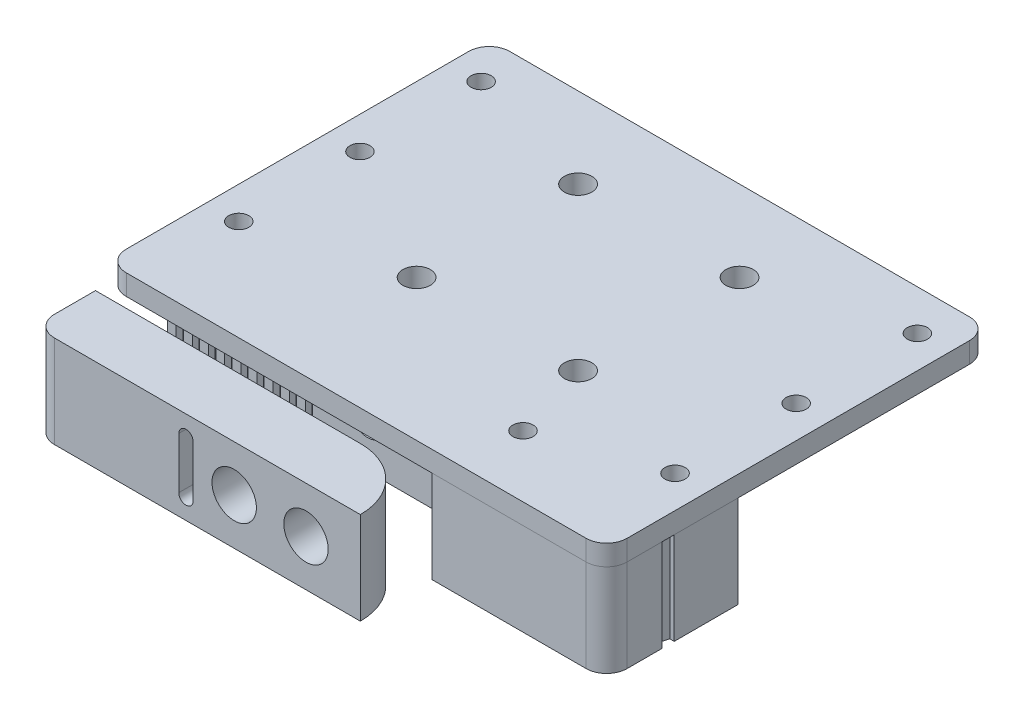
ISO-10303-21;
HEADER;
FILE_DESCRIPTION(('STEP AP214'),'2;1');
FILE_NAME('part.step','',(''),(''),'','','');
FILE_SCHEMA(('AUTOMOTIVE_DESIGN { 1 0 10303 214 1 1 1 1 }'));
ENDSEC;
DATA;
#1=APPLICATION_CONTEXT('core data for automotive mechanical design processes');
#2=APPLICATION_PROTOCOL_DEFINITION('international standard','automotive_design',2000,#1);
#3=PRODUCT_CONTEXT('',#1,'mechanical');
#4=PRODUCT('Part','Part','',(#3));
#5=PRODUCT_RELATED_PRODUCT_CATEGORY('part','',(#4));
#6=PRODUCT_DEFINITION_FORMATION('','',#4);
#7=PRODUCT_DEFINITION_CONTEXT('part definition',#1,'design');
#8=PRODUCT_DEFINITION('design','',#6,#7);
#9=PRODUCT_DEFINITION_SHAPE('','',#8);
#10=(LENGTH_UNIT() NAMED_UNIT(*) SI_UNIT(.MILLI.,.METRE.));
#11=(NAMED_UNIT(*) PLANE_ANGLE_UNIT() SI_UNIT($,.RADIAN.));
#12=(NAMED_UNIT(*) SI_UNIT($,.STERADIAN.) SOLID_ANGLE_UNIT());
#13=UNCERTAINTY_MEASURE_WITH_UNIT(LENGTH_MEASURE(1.E-05),#10,'distance_accuracy_value','');
#14=(GEOMETRIC_REPRESENTATION_CONTEXT(3) GLOBAL_UNCERTAINTY_ASSIGNED_CONTEXT((#13)) GLOBAL_UNIT_ASSIGNED_CONTEXT((#10,
#11,#12)) REPRESENTATION_CONTEXT('',''));
#15=CARTESIAN_POINT('',(0.,0.,0.));
#16=DIRECTION('',(0.,0.,1.));
#17=DIRECTION('',(1.,0.,0.));
#18=AXIS2_PLACEMENT_3D('',#15,#16,#17);
#19=CARTESIAN_POINT('',(-28.4600000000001,-11.43,33.8201));
#20=DIRECTION('',(0.,1.,0.));
#21=DIRECTION('',(0.,0.,1.));
#22=AXIS2_PLACEMENT_3D('',#19,#20,#21);
#23=CYLINDRICAL_SURFACE('',#22,2.54);
#24=CARTESIAN_POINT('',(-28.4600000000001,0.,33.8201));
#25=DIRECTION('',(0.,-1.,0.));
#26=DIRECTION('',(0.,0.,-1.));
#27=AXIS2_PLACEMENT_3D('',#24,#25,#26);
#28=CIRCLE('',#27,2.54);
#29=CARTESIAN_POINT('',(-28.4600000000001,0.,36.3601));
#30=VERTEX_POINT('',#29);
#31=CARTESIAN_POINT('',(-31.0000000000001,0.,33.8201));
#32=VERTEX_POINT('',#31);
#33=EDGE_CURVE('E166',#30,#32,#28,.T.);
#34=ORIENTED_EDGE('',*,*,#33,.T.);
#35=DIRECTION('',(0.,1.,0.));
#36=VECTOR('',#35,1.);
#37=CARTESIAN_POINT('',(-31.0000000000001,-11.43,33.8201));
#38=LINE('',#37,#36);
#39=CARTESIAN_POINT('',(-31.0000000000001,-11.43,33.8201));
#40=VERTEX_POINT('',#39);
#41=EDGE_CURVE('E63',#40,#32,#38,.T.);
#42=ORIENTED_EDGE('',*,*,#41,.F.);
#43=CARTESIAN_POINT('',(-28.4600000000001,-11.43,33.8201));
#44=DIRECTION('',(0.,-1.,0.));
#45=DIRECTION('',(0.,0.,-1.));
#46=AXIS2_PLACEMENT_3D('',#43,#44,#45);
#47=CIRCLE('',#46,2.54);
#48=CARTESIAN_POINT('',(-28.4600000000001,-11.43,36.3601));
#49=VERTEX_POINT('',#48);
#50=EDGE_CURVE('E186',#49,#40,#47,.T.);
#51=ORIENTED_EDGE('',*,*,#50,.F.);
#52=DIRECTION('',(0.,1.,0.));
#53=VECTOR('',#52,1.);
#54=CARTESIAN_POINT('',(-28.4600000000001,-11.43,36.3601));
#55=LINE('',#54,#53);
#56=EDGE_CURVE('E168',#49,#30,#55,.T.);
#57=ORIENTED_EDGE('',*,*,#56,.T.);
#58=EDGE_LOOP('',(#34,#42,#51,#57));
#59=FACE_BOUND('',#58,.T.);
#60=ADVANCED_FACE('F51',(#59),#23,.T.);
#61=CARTESIAN_POINT('',(-31.0000000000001,-11.43,28.7401));
#62=DIRECTION('',(1.,0.,0.));
#63=DIRECTION('',(0.,0.,-1.));
#64=AXIS2_PLACEMENT_3D('',#61,#62,#63);
#65=PLANE('',#64);
#66=DIRECTION('',(0.,0.,-1.));
#67=VECTOR('',#66,1.);
#68=CARTESIAN_POINT('',(-31.0000000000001,0.,28.7401));
#69=LINE('',#68,#67);
#70=CARTESIAN_POINT('',(-31.0000000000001,0.,28.7401));
#71=VERTEX_POINT('',#70);
#72=EDGE_CURVE('E159',#32,#71,#69,.T.);
#73=ORIENTED_EDGE('',*,*,#72,.T.);
#74=DIRECTION('',(0.,1.,0.));
#75=VECTOR('',#74,1.);
#76=CARTESIAN_POINT('',(-31.0000000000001,-11.43,28.7401));
#77=LINE('',#76,#75);
#78=CARTESIAN_POINT('',(-31.0000000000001,-11.43,28.7401));
#79=VERTEX_POINT('',#78);
#80=EDGE_CURVE('E145',#79,#71,#77,.T.);
#81=ORIENTED_EDGE('',*,*,#80,.F.);
#82=DIRECTION('',(0.,0.,-1.));
#83=VECTOR('',#82,1.);
#84=CARTESIAN_POINT('',(-31.0000000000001,-11.43,28.7401));
#85=LINE('',#84,#83);
#86=EDGE_CURVE('E160',#40,#79,#85,.T.);
#87=ORIENTED_EDGE('',*,*,#86,.F.);
#88=ORIENTED_EDGE('',*,*,#41,.T.);
#89=EDGE_LOOP('',(#73,#81,#87,#88));
#90=FACE_BOUND('',#89,.T.);
#91=ADVANCED_FACE('F157',(#90),#65,.F.);
#92=CARTESIAN_POINT('',(1.78999999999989,-11.43,28.7401));
#93=DIRECTION('',(0.,0.,1.));
#94=DIRECTION('',(1.,0.,0.));
#95=AXIS2_PLACEMENT_3D('',#92,#93,#94);
#96=PLANE('',#95);
#97=CARTESIAN_POINT('',(-6.2110000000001,-5.715,28.7401));
#98=DIRECTION('',(0.,0.,1.));
#99=DIRECTION('',(1.,0.,0.));
#100=AXIS2_PLACEMENT_3D('',#97,#98,#99);
#101=CIRCLE('',#100,2.75);
#102=CARTESIAN_POINT('',(-3.4610000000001,-5.715,28.7401));
#103=VERTEX_POINT('',#102);
#104=EDGE_CURVE('E223',#103,#103,#101,.T.);
#105=ORIENTED_EDGE('',*,*,#104,.T.);
#106=EDGE_LOOP('',(#105));
#107=FACE_BOUND('',#106,.T.);
#108=DIRECTION('',(0.,-1.,0.));
#109=VECTOR('',#108,1.);
#110=CARTESIAN_POINT('',(-11.2910000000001,-2.54,28.7401));
#111=LINE('',#110,#109);
#112=CARTESIAN_POINT('',(-11.2910000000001,-2.54,28.7401));
#113=VERTEX_POINT('',#112);
#114=CARTESIAN_POINT('',(-11.2910000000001,-8.89,28.7401));
#115=VERTEX_POINT('',#114);
#116=EDGE_CURVE('E217',#113,#115,#111,.T.);
#117=ORIENTED_EDGE('',*,*,#116,.F.);
#118=CARTESIAN_POINT('',(-12.1800000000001,-2.54,28.7401));
#119=DIRECTION('',(0.,0.,1.));
#120=DIRECTION('',(1.,0.,0.));
#121=AXIS2_PLACEMENT_3D('',#118,#119,#120);
#122=CIRCLE('',#121,0.889);
#123=CARTESIAN_POINT('',(-13.0690000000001,-2.54,28.7401));
#124=VERTEX_POINT('',#123);
#125=EDGE_CURVE('E214',#124,#113,#122,.F.);
#126=ORIENTED_EDGE('',*,*,#125,.F.);
#127=DIRECTION('',(0.,1.,0.));
#128=VECTOR('',#127,1.);
#129=CARTESIAN_POINT('',(-13.0690000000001,-2.54,28.7401));
#130=LINE('',#129,#128);
#131=CARTESIAN_POINT('',(-13.0690000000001,-8.89,28.7401));
#132=VERTEX_POINT('',#131);
#133=EDGE_CURVE('E171',#132,#124,#130,.T.);
#134=ORIENTED_EDGE('',*,*,#133,.F.);
#135=CARTESIAN_POINT('',(-12.1800000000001,-8.89,28.7401));
#136=DIRECTION('',(0.,0.,1.));
#137=DIRECTION('',(1.,0.,0.));
#138=AXIS2_PLACEMENT_3D('',#135,#136,#137);
#139=CIRCLE('',#138,0.889);
#140=EDGE_CURVE('E76',#115,#132,#139,.F.);
#141=ORIENTED_EDGE('',*,*,#140,.F.);
#142=EDGE_LOOP('',(#117,#126,#134,#141));
#143=FACE_BOUND('',#142,.T.);
#144=DIRECTION('',(0.,1.,0.));
#145=VECTOR('',#144,1.);
#146=CARTESIAN_POINT('',(1.78999999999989,-11.43,28.7401));
#147=LINE('',#146,#145);
#148=CARTESIAN_POINT('',(1.78999999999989,-3.11265893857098,28.7401));
#149=VERTEX_POINT('',#148);
#150=CARTESIAN_POINT('',(1.78999999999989,0.,28.7401));
#151=VERTEX_POINT('',#150);
#152=EDGE_CURVE('E139',#149,#151,#147,.T.);
#153=ORIENTED_EDGE('',*,*,#152,.F.);
#154=CARTESIAN_POINT('',(2.6789999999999,-5.715,28.7401));
#155=DIRECTION('',(0.,0.,1.));
#156=DIRECTION('',(1.,0.,0.));
#157=AXIS2_PLACEMENT_3D('',#154,#155,#156);
#158=CIRCLE('',#157,2.75);
#159=CARTESIAN_POINT('',(1.78999999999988,-8.3173410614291,28.7401));
#160=VERTEX_POINT('',#159);
#161=EDGE_CURVE('E69',#149,#160,#158,.T.);
#162=ORIENTED_EDGE('',*,*,#161,.T.);
#163=CARTESIAN_POINT('',(1.78999999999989,-11.43,28.7401));
#164=VERTEX_POINT('',#163);
#165=EDGE_CURVE('E136',#164,#160,#147,.T.);
#166=ORIENTED_EDGE('',*,*,#165,.F.);
#167=DIRECTION('',(1.,0.,0.));
#168=VECTOR('',#167,1.);
#169=CARTESIAN_POINT('',(-7.00000000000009,-11.43,28.7401));
#170=LINE('',#169,#168);
#171=EDGE_CURVE('E190',#79,#164,#170,.T.);
#172=ORIENTED_EDGE('',*,*,#171,.F.);
#173=ORIENTED_EDGE('',*,*,#80,.T.);
#174=DIRECTION('',(1.,0.,0.));
#175=VECTOR('',#174,1.);
#176=CARTESIAN_POINT('',(1.78999999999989,0.,28.7401));
#177=LINE('',#176,#175);
#178=EDGE_CURVE('E173',#71,#151,#177,.T.);
#179=ORIENTED_EDGE('',*,*,#178,.T.);
#180=EDGE_LOOP('',(#153,#162,#166,#172,#173,#179));
#181=FACE_BOUND('',#180,.T.);
#182=ADVANCED_FACE('F134',(#107,#143,#181),#96,.F.);
#183=CARTESIAN_POINT('',(1.78999999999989,-11.43,36.3601));
#184=DIRECTION('',(0.,1.,0.));
#185=DIRECTION('',(0.,0.,1.));
#186=AXIS2_PLACEMENT_3D('',#183,#184,#185);
#187=CYLINDRICAL_SURFACE('',#186,7.62000000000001);
#188=ORIENTED_EDGE('',*,*,#165,.T.);
#189=CARTESIAN_POINT('',(1.78999999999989,-8.31734106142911,28.7401));
#190=CARTESIAN_POINT('',(1.85985295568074,-8.34121406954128,28.7400911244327));
#191=CARTESIAN_POINT('',(1.93067207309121,-8.3622559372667,28.7410602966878));
#192=CARTESIAN_POINT('',(2.07371131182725,-8.39857158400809,28.7450496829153));
#193=CARTESIAN_POINT('',(2.14593132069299,-8.4138458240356,28.7480697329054));
#194=CARTESIAN_POINT('',(2.2910680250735,-8.43849295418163,28.7562454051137));
#195=CARTESIAN_POINT('',(2.36398248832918,-8.4478807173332,28.7613955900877));
#196=CARTESIAN_POINT('',(2.51012464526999,-8.4607913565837,28.7738484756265));
#197=CARTESIAN_POINT('',(2.58335233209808,-8.46431436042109,28.7811511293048));
#198=CARTESIAN_POINT('',(2.80275733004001,-8.46609483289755,28.8062739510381));
#199=CARTESIAN_POINT('',(2.94874388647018,-8.45557839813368,28.8273138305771));
#200=CARTESIAN_POINT('',(3.2358524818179,-8.41195215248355,28.8771052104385));
#201=CARTESIAN_POINT('',(3.37697334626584,-8.37883692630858,28.9058585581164));
#202=CARTESIAN_POINT('',(3.65413747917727,-8.29050562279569,28.9702367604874));
#203=CARTESIAN_POINT('',(3.78999391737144,-8.23480698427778,29.0060022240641));
#204=CARTESIAN_POINT('',(4.05026064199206,-8.10318775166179,29.0817738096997));
#205=CARTESIAN_POINT('',(4.17466529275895,-8.02725727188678,29.1217819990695));
#206=CARTESIAN_POINT('',(4.41820586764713,-7.85085692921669,29.2064478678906));
#207=CARTESIAN_POINT('',(4.53629630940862,-7.74900152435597,29.2512318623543));
#208=CARTESIAN_POINT('',(4.75395564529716,-7.52643662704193,29.33919026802));
#209=CARTESIAN_POINT('',(4.85351688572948,-7.4057193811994,29.3823640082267));
#210=CARTESIAN_POINT('',(5.03400828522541,-7.14412375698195,29.4643816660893));
#211=CARTESIAN_POINT('',(5.11432152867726,-7.00276608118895,29.5030657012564));
#212=CARTESIAN_POINT('',(5.2493607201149,-6.70608128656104,29.5701839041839));
#213=CARTESIAN_POINT('',(5.30410959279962,-6.55076683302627,29.5986272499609));
#214=CARTESIAN_POINT('',(5.38179308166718,-6.24438659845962,29.6395937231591));
#215=CARTESIAN_POINT('',(5.4070078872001,-6.09405414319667,29.653250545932));
#216=CARTESIAN_POINT('',(5.43215862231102,-5.79071365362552,29.6668710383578));
#217=CARTESIAN_POINT('',(5.43211201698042,-5.63770754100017,29.6668441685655));
#218=CARTESIAN_POINT('',(5.40803986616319,-5.34932140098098,29.6538108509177));
#219=CARTESIAN_POINT('',(5.38635462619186,-5.21367832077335,29.6420712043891));
#220=CARTESIAN_POINT('',(5.32347032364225,-4.94826422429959,29.6087859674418));
#221=CARTESIAN_POINT('',(5.28226720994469,-4.818494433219,29.5872383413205));
#222=CARTESIAN_POINT('',(5.1805396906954,-4.56432191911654,29.5357350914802));
#223=CARTESIAN_POINT('',(5.11951640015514,-4.44016398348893,29.5055650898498));
#224=CARTESIAN_POINT('',(4.98041178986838,-4.20341949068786,29.4397252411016));
#225=CARTESIAN_POINT('',(4.90232373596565,-4.09083752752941,29.4040532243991));
#226=CARTESIAN_POINT('',(4.72137533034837,-3.86726986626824,29.3257427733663));
#227=CARTESIAN_POINT('',(4.61672859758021,-3.75784412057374,29.2827704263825));
#228=CARTESIAN_POINT('',(4.39094015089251,-3.55755771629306,29.1967128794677));
#229=CARTESIAN_POINT('',(4.26979013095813,-3.46670646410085,29.1536276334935));
#230=CARTESIAN_POINT('',(4.00544161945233,-3.30069291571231,29.0678667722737));
#231=CARTESIAN_POINT('',(3.86134027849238,-3.22685852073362,29.0253834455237));
#232=CARTESIAN_POINT('',(3.56087198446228,-3.10519799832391,28.9471047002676));
#233=CARTESIAN_POINT('',(3.40450901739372,-3.05736345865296,28.9113071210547));
#234=CARTESIAN_POINT('',(3.09067570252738,-2.99147826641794,28.850304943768));
#235=CARTESIAN_POINT('',(2.93353395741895,-2.97224979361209,28.8247152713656));
#236=CARTESIAN_POINT('',(2.69637314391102,-2.96391173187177,28.7937726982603));
#237=CARTESIAN_POINT('',(2.61707327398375,-2.9645504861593,28.7846985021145));
#238=CARTESIAN_POINT('',(2.45858597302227,-2.97270123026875,28.76907135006));
#239=CARTESIAN_POINT('',(2.37939851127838,-2.98021068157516,28.7625174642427));
#240=CARTESIAN_POINT('',(2.21389622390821,-3.00320427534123,28.7514044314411));
#241=CARTESIAN_POINT('',(2.12766385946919,-3.01941325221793,28.7471115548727));
#242=CARTESIAN_POINT('',(1.9571662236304,-3.05997572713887,28.7414520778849));
#243=CARTESIAN_POINT('',(1.8728983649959,-3.08431778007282,28.7400813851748));
#244=CARTESIAN_POINT('',(1.78999999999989,-3.11265893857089,28.7401));
#245=B_SPLINE_CURVE_WITH_KNOTS('',3,(#189,#190,#191,#192,#193,#194,#195,#196,#197,#198,#199,
#200,#201,#202,#203,#204,#205,#206,#207,#208,#209,#210,#211,#212,#213,#214,#215,#216,#217,#218,
#219,#220,#221,#222,#223,#224,#225,#226,#227,#228,#229,#230,#231,#232,#233,#234,#235,#236,#237,
#238,#239,#240,#241,#242,#243,#244),.UNSPECIFIED.,.F.,.F.,(4,2,2,2,2,2,2,2,2,2,2,2,2,2,2,2,2,2,
2,2,2,2,2,2,2,2,2,4),(0.,0.221389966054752,0.442762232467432,0.663572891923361,
0.884378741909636,1.32572786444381,1.76718278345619,2.21861449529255,2.67026719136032,
3.15485028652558,3.63963310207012,4.13833308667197,4.63658500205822,5.0931136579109,
5.54932668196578,5.96102250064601,6.37280380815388,6.79587794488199,7.21911933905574,
7.68927115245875,8.15966047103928,8.6593177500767,9.15881326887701,9.63711117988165,
9.876289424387,10.1153793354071,10.3784691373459,10.641190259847),.UNSPECIFIED.);
#246=EDGE_CURVE('E12',#160,#149,#245,.T.);
#247=ORIENTED_EDGE('',*,*,#246,.T.);
#248=ORIENTED_EDGE('',*,*,#152,.T.);
#249=CARTESIAN_POINT('',(1.78999999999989,0.,36.3601));
#250=DIRECTION('',(0.,-1.,0.));
#251=DIRECTION('',(0.,0.,-1.));
#252=AXIS2_PLACEMENT_3D('',#249,#250,#251);
#253=CIRCLE('',#252,7.62000000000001);
#254=CARTESIAN_POINT('',(9.4099999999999,0.,36.3601));
#255=VERTEX_POINT('',#254);
#256=EDGE_CURVE('E183',#151,#255,#253,.T.);
#257=ORIENTED_EDGE('',*,*,#256,.T.);
#258=DIRECTION('',(0.,1.,0.));
#259=VECTOR('',#258,1.);
#260=CARTESIAN_POINT('',(9.4099999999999,-11.43,36.3601));
#261=LINE('',#260,#259);
#262=CARTESIAN_POINT('',(9.4099999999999,-11.43,36.3601));
#263=VERTEX_POINT('',#262);
#264=EDGE_CURVE('E149',#263,#255,#261,.T.);
#265=ORIENTED_EDGE('',*,*,#264,.F.);
#266=CARTESIAN_POINT('',(1.78999999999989,-11.43,36.3601));
#267=DIRECTION('',(0.,-1.,0.));
#268=DIRECTION('',(0.,0.,-1.));
#269=AXIS2_PLACEMENT_3D('',#266,#267,#268);
#270=CIRCLE('',#269,7.62000000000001);
#271=EDGE_CURVE('E144',#164,#263,#270,.T.);
#272=ORIENTED_EDGE('',*,*,#271,.F.);
#273=EDGE_LOOP('',(#188,#247,#248,#257,#265,#272));
#274=FACE_BOUND('',#273,.T.);
#275=ADVANCED_FACE('F142',(#274),#187,.T.);
#276=CARTESIAN_POINT('',(-28.4600000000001,-11.43,36.3601));
#277=DIRECTION('',(0.,0.,-1.));
#278=DIRECTION('',(-1.,0.,0.));
#279=AXIS2_PLACEMENT_3D('',#276,#277,#278);
#280=PLANE('',#279);
#281=CARTESIAN_POINT('',(-6.2110000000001,-5.715,36.3601));
#282=DIRECTION('',(0.,0.,1.));
#283=DIRECTION('',(1.,0.,0.));
#284=AXIS2_PLACEMENT_3D('',#281,#282,#283);
#285=CIRCLE('',#284,2.75);
#286=CARTESIAN_POINT('',(-3.4610000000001,-5.715,36.3601));
#287=VERTEX_POINT('',#286);
#288=EDGE_CURVE('E226',#287,#287,#285,.T.);
#289=ORIENTED_EDGE('',*,*,#288,.F.);
#290=EDGE_LOOP('',(#289));
#291=FACE_BOUND('',#290,.T.);
#292=CARTESIAN_POINT('',(2.6789999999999,-5.715,36.3601));
#293=DIRECTION('',(0.,0.,1.));
#294=DIRECTION('',(1.,0.,0.));
#295=AXIS2_PLACEMENT_3D('',#292,#293,#294);
#296=CIRCLE('',#295,2.75);
#297=CARTESIAN_POINT('',(5.4289999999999,-5.715,36.3601));
#298=VERTEX_POINT('',#297);
#299=EDGE_CURVE('E140',#298,#298,#296,.T.);
#300=ORIENTED_EDGE('',*,*,#299,.F.);
#301=EDGE_LOOP('',(#300));
#302=FACE_BOUND('',#301,.T.);
#303=DIRECTION('',(0.,-1.,0.));
#304=VECTOR('',#303,1.);
#305=CARTESIAN_POINT('',(-13.0690000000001,-2.54,36.3601));
#306=LINE('',#305,#304);
#307=CARTESIAN_POINT('',(-13.0690000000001,-2.54,36.3601));
#308=VERTEX_POINT('',#307);
#309=CARTESIAN_POINT('',(-13.0690000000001,-8.89,36.3601));
#310=VERTEX_POINT('',#309);
#311=EDGE_CURVE('E209',#308,#310,#306,.T.);
#312=ORIENTED_EDGE('',*,*,#311,.F.);
#313=CARTESIAN_POINT('',(-12.1800000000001,-2.54,36.3601));
#314=DIRECTION('',(0.,0.,1.));
#315=DIRECTION('',(1.,0.,0.));
#316=AXIS2_PLACEMENT_3D('',#313,#314,#315);
#317=CIRCLE('',#316,0.889);
#318=CARTESIAN_POINT('',(-11.2910000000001,-2.54,36.3601));
#319=VERTEX_POINT('',#318);
#320=EDGE_CURVE('E212',#319,#308,#317,.T.);
#321=ORIENTED_EDGE('',*,*,#320,.F.);
#322=DIRECTION('',(0.,1.,0.));
#323=VECTOR('',#322,1.);
#324=CARTESIAN_POINT('',(-11.2910000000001,-2.54,36.3601));
#325=LINE('',#324,#323);
#326=CARTESIAN_POINT('',(-11.2910000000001,-8.89,36.3601));
#327=VERTEX_POINT('',#326);
#328=EDGE_CURVE('E199',#327,#319,#325,.T.);
#329=ORIENTED_EDGE('',*,*,#328,.F.);
#330=CARTESIAN_POINT('',(-12.1800000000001,-8.89,36.3601));
#331=DIRECTION('',(0.,0.,1.));
#332=DIRECTION('',(1.,0.,0.));
#333=AXIS2_PLACEMENT_3D('',#330,#331,#332);
#334=CIRCLE('',#333,0.889);
#335=EDGE_CURVE('E206',#310,#327,#334,.T.);
#336=ORIENTED_EDGE('',*,*,#335,.F.);
#337=EDGE_LOOP('',(#312,#321,#329,#336));
#338=FACE_BOUND('',#337,.T.);
#339=DIRECTION('',(-1.,0.,0.));
#340=VECTOR('',#339,1.);
#341=CARTESIAN_POINT('',(-28.4600000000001,0.,36.3601));
#342=LINE('',#341,#340);
#343=EDGE_CURVE('E185',#255,#30,#342,.T.);
#344=ORIENTED_EDGE('',*,*,#343,.T.);
#345=ORIENTED_EDGE('',*,*,#56,.F.);
#346=DIRECTION('',(-1.,0.,0.));
#347=VECTOR('',#346,1.);
#348=CARTESIAN_POINT('',(-28.4600000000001,-11.43,36.3601));
#349=LINE('',#348,#347);
#350=EDGE_CURVE('E179',#263,#49,#349,.T.);
#351=ORIENTED_EDGE('',*,*,#350,.F.);
#352=ORIENTED_EDGE('',*,*,#264,.T.);
#353=EDGE_LOOP('',(#344,#345,#351,#352));
#354=FACE_BOUND('',#353,.T.);
#355=ADVANCED_FACE('F232',(#291,#302,#338,#354),#280,.F.);
#356=CARTESIAN_POINT('',(-28.4600000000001,-11.43,33.8201));
#357=DIRECTION('',(0.,-1.,0.));
#358=DIRECTION('',(0.,0.,-1.));
#359=AXIS2_PLACEMENT_3D('',#356,#357,#358);
#360=PLANE('',#359);
#361=ORIENTED_EDGE('',*,*,#50,.T.);
#362=ORIENTED_EDGE('',*,*,#86,.T.);
#363=ORIENTED_EDGE('',*,*,#171,.T.);
#364=ORIENTED_EDGE('',*,*,#271,.T.);
#365=ORIENTED_EDGE('',*,*,#350,.T.);
#366=EDGE_LOOP('',(#361,#362,#363,#364,#365));
#367=FACE_BOUND('',#366,.T.);
#368=ADVANCED_FACE('F235',(#367),#360,.T.);
#369=CARTESIAN_POINT('',(-28.4600000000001,0.,33.8201));
#370=DIRECTION('',(0.,-1.,0.));
#371=DIRECTION('',(0.,0.,-1.));
#372=AXIS2_PLACEMENT_3D('',#369,#370,#371);
#373=PLANE('',#372);
#374=ORIENTED_EDGE('',*,*,#33,.F.);
#375=ORIENTED_EDGE('',*,*,#343,.F.);
#376=ORIENTED_EDGE('',*,*,#256,.F.);
#377=ORIENTED_EDGE('',*,*,#178,.F.);
#378=ORIENTED_EDGE('',*,*,#72,.F.);
#379=EDGE_LOOP('',(#374,#375,#376,#377,#378));
#380=FACE_BOUND('',#379,.T.);
#381=ADVANCED_FACE('F244',(#380),#373,.F.);
#382=CARTESIAN_POINT('',(-12.1800000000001,-2.54,-20.001));
#383=DIRECTION('',(0.,0.,1.));
#384=DIRECTION('',(1.,0.,0.));
#385=AXIS2_PLACEMENT_3D('',#382,#383,#384);
#386=CYLINDRICAL_SURFACE('',#385,0.889);
#387=ORIENTED_EDGE('',*,*,#125,.T.);
#388=DIRECTION('',(0.,0.,1.));
#389=VECTOR('',#388,1.);
#390=CARTESIAN_POINT('',(-11.2910000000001,-2.54,-20.001));
#391=LINE('',#390,#389);
#392=EDGE_CURVE('E176',#113,#319,#391,.T.);
#393=ORIENTED_EDGE('',*,*,#392,.T.);
#394=ORIENTED_EDGE('',*,*,#320,.T.);
#395=DIRECTION('',(0.,0.,1.));
#396=VECTOR('',#395,1.);
#397=CARTESIAN_POINT('',(-13.0690000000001,-2.54,-20.001));
#398=LINE('',#397,#396);
#399=EDGE_CURVE('E195',#124,#308,#398,.T.);
#400=ORIENTED_EDGE('',*,*,#399,.F.);
#401=EDGE_LOOP('',(#387,#393,#394,#400));
#402=FACE_BOUND('',#401,.T.);
#403=ADVANCED_FACE('F250',(#402),#386,.F.);
#404=CARTESIAN_POINT('',(-11.2910000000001,-2.54,-20.001));
#405=DIRECTION('',(1.,0.,0.));
#406=DIRECTION('',(0.,0.,-1.));
#407=AXIS2_PLACEMENT_3D('',#404,#405,#406);
#408=PLANE('',#407);
#409=ORIENTED_EDGE('',*,*,#116,.T.);
#410=DIRECTION('',(0.,0.,1.));
#411=VECTOR('',#410,1.);
#412=CARTESIAN_POINT('',(-11.2910000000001,-8.89,-20.001));
#413=LINE('',#412,#411);
#414=EDGE_CURVE('E201',#115,#327,#413,.T.);
#415=ORIENTED_EDGE('',*,*,#414,.T.);
#416=ORIENTED_EDGE('',*,*,#328,.T.);
#417=ORIENTED_EDGE('',*,*,#392,.F.);
#418=EDGE_LOOP('',(#409,#415,#416,#417));
#419=FACE_BOUND('',#418,.T.);
#420=ADVANCED_FACE('F300',(#419),#408,.F.);
#421=CARTESIAN_POINT('',(-12.1800000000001,-8.89,-20.001));
#422=DIRECTION('',(0.,0.,1.));
#423=DIRECTION('',(1.,0.,0.));
#424=AXIS2_PLACEMENT_3D('',#421,#422,#423);
#425=CYLINDRICAL_SURFACE('',#424,0.889);
#426=ORIENTED_EDGE('',*,*,#140,.T.);
#427=DIRECTION('',(0.,0.,1.));
#428=VECTOR('',#427,1.);
#429=CARTESIAN_POINT('',(-13.0690000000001,-8.89,-20.001));
#430=LINE('',#429,#428);
#431=EDGE_CURVE('E198',#132,#310,#430,.T.);
#432=ORIENTED_EDGE('',*,*,#431,.T.);
#433=ORIENTED_EDGE('',*,*,#335,.T.);
#434=ORIENTED_EDGE('',*,*,#414,.F.);
#435=EDGE_LOOP('',(#426,#432,#433,#434));
#436=FACE_BOUND('',#435,.T.);
#437=ADVANCED_FACE('F303',(#436),#425,.F.);
#438=CARTESIAN_POINT('',(-13.0690000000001,-2.54,-20.001));
#439=DIRECTION('',(-1.,0.,0.));
#440=DIRECTION('',(0.,0.,1.));
#441=AXIS2_PLACEMENT_3D('',#438,#439,#440);
#442=PLANE('',#441);
#443=ORIENTED_EDGE('',*,*,#133,.T.);
#444=ORIENTED_EDGE('',*,*,#399,.T.);
#445=ORIENTED_EDGE('',*,*,#311,.T.);
#446=ORIENTED_EDGE('',*,*,#431,.F.);
#447=EDGE_LOOP('',(#443,#444,#445,#446));
#448=FACE_BOUND('',#447,.T.);
#449=ADVANCED_FACE('F282',(#448),#442,.F.);
#450=CARTESIAN_POINT('',(2.6789999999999,-5.715,36.3601));
#451=DIRECTION('',(0.,0.,1.));
#452=DIRECTION('',(1.,0.,0.));
#453=AXIS2_PLACEMENT_3D('',#450,#451,#452);
#454=CYLINDRICAL_SURFACE('',#453,2.75);
#455=ORIENTED_EDGE('',*,*,#299,.T.);
#456=EDGE_LOOP('',(#455));
#457=FACE_BOUND('',#456,.T.);
#458=ORIENTED_EDGE('',*,*,#161,.F.);
#459=ORIENTED_EDGE('',*,*,#246,.F.);
#460=EDGE_LOOP('',(#458,#459));
#461=FACE_BOUND('',#460,.T.);
#462=ADVANCED_FACE('F128',(#457,#461),#454,.F.);
#463=CARTESIAN_POINT('',(-6.2110000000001,-5.715,36.3601));
#464=DIRECTION('',(0.,0.,1.));
#465=DIRECTION('',(1.,0.,0.));
#466=AXIS2_PLACEMENT_3D('',#463,#464,#465);
#467=CYLINDRICAL_SURFACE('',#466,2.75);
#468=ORIENTED_EDGE('',*,*,#104,.F.);
#469=EDGE_LOOP('',(#468));
#470=FACE_BOUND('',#469,.T.);
#471=ORIENTED_EDGE('',*,*,#288,.T.);
#472=EDGE_LOOP('',(#471));
#473=FACE_BOUND('',#472,.T.);
#474=ADVANCED_FACE('F230',(#470,#473),#467,.F.);
#475=CLOSED_SHELL('',(#60,#91,#182,#275,#355,#368,#381,#403,#420,#437,#449,#462,#474));
#476=MANIFOLD_SOLID_BREP('B2',#475);
#477=CARTESIAN_POINT('',(-1.00095095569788,-11.43,22.7956276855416));
#478=DIRECTION('',(-0.0438675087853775,0.,0.999037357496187));
#479=DIRECTION('',(0.999037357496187,0.,0.0438675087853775));
#480=AXIS2_PLACEMENT_3D('',#477,#478,#479);
#481=PLANE('',#480);
#482=DIRECTION('',(0.999037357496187,0.,0.0438675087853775));
#483=VECTOR('',#482,1.);
#484=CARTESIAN_POINT('',(-1.00095095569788,0.,22.7956276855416));
#485=LINE('',#484,#483);
#486=CARTESIAN_POINT('',(17.6998521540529,0.,23.6167758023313));
#487=VERTEX_POINT('',#486);
#488=CARTESIAN_POINT('',(18.475313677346,0.,23.650826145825));
#489=VERTEX_POINT('',#488);
#490=EDGE_CURVE('E1319',#487,#489,#485,.T.);
#491=ORIENTED_EDGE('',*,*,#490,.F.);
#492=DIRECTION('',(0.,1.,0.));
#493=VECTOR('',#492,1.);
#494=CARTESIAN_POINT('',(17.6998521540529,-11.43,23.6167758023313));
#495=LINE('',#494,#493);
#496=CARTESIAN_POINT('',(17.6998521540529,-11.43,23.6167758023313));
#497=VERTEX_POINT('',#496);
#498=EDGE_CURVE('E49',#497,#487,#495,.T.);
#499=ORIENTED_EDGE('',*,*,#498,.F.);
#500=DIRECTION('',(0.999037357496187,0.,0.0438675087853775));
#501=VECTOR('',#500,1.);
#502=CARTESIAN_POINT('',(-1.00095095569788,-11.43,22.7956276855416));
#503=LINE('',#502,#501);
#504=CARTESIAN_POINT('',(18.475313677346,-11.43,23.650826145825));
#505=VERTEX_POINT('',#504);
#506=EDGE_CURVE('E1312',#497,#505,#503,.T.);
#507=ORIENTED_EDGE('',*,*,#506,.T.);
#508=DIRECTION('',(0.,1.,0.));
#509=VECTOR('',#508,1.);
#510=CARTESIAN_POINT('',(18.475313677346,-11.43,23.650826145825));
#511=LINE('',#510,#509);
#512=EDGE_CURVE('E401',#505,#489,#511,.T.);
#513=ORIENTED_EDGE('',*,*,#512,.T.);
#514=EDGE_LOOP('',(#491,#499,#507,#513));
#515=FACE_BOUND('',#514,.T.);
#516=ADVANCED_FACE('F378',(#515),#481,.T.);
#517=CARTESIAN_POINT('',(23.3800000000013,-11.43,24.9301000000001));
#518=DIRECTION('',(0.,1.,0.));
#519=DIRECTION('',(0.,0.,1.));
#520=AXIS2_PLACEMENT_3D('',#517,#518,#519);
#521=CYLINDRICAL_SURFACE('',#520,5.83000000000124);
#522=CARTESIAN_POINT('',(23.3800000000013,0.,24.9301000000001));
#523=DIRECTION('',(0.,-1.,0.));
#524=DIRECTION('',(0.,0.,-1.));
#525=AXIS2_PLACEMENT_3D('',#522,#523,#524);
#526=CIRCLE('',#525,5.83000000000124);
#527=CARTESIAN_POINT('',(17.55,0.,24.9301));
#528=VERTEX_POINT('',#527);
#529=EDGE_CURVE('E1357',#528,#487,#526,.T.);
#530=ORIENTED_EDGE('',*,*,#529,.F.);
#531=DIRECTION('',(0.,1.,0.));
#532=VECTOR('',#531,1.);
#533=CARTESIAN_POINT('',(17.55,-11.43,24.9301));
#534=LINE('',#533,#532);
#535=CARTESIAN_POINT('',(17.55,-11.43,24.9301));
#536=VERTEX_POINT('',#535);
#537=EDGE_CURVE('E386',#536,#528,#534,.T.);
#538=ORIENTED_EDGE('',*,*,#537,.F.);
#539=CARTESIAN_POINT('',(23.3800000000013,-11.43,24.9301000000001));
#540=DIRECTION('',(0.,-1.,0.));
#541=DIRECTION('',(0.,0.,-1.));
#542=AXIS2_PLACEMENT_3D('',#539,#540,#541);
#543=CIRCLE('',#542,5.83000000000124);
#544=EDGE_CURVE('E1305',#536,#497,#543,.T.);
#545=ORIENTED_EDGE('',*,*,#544,.T.);
#546=ORIENTED_EDGE('',*,*,#498,.T.);
#547=EDGE_LOOP('',(#530,#538,#545,#546));
#548=FACE_BOUND('',#547,.T.);
#549=ADVANCED_FACE('F1349',(#548),#521,.F.);
#550=CARTESIAN_POINT('',(18.3,-11.43,24.9301));
#551=DIRECTION('',(0.,1.,0.));
#552=DIRECTION('',(0.,0.,1.));
#553=AXIS2_PLACEMENT_3D('',#550,#551,#552);
#554=CYLINDRICAL_SURFACE('',#553,0.750000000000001);
#555=CARTESIAN_POINT('',(18.3,0.,24.9301));
#556=DIRECTION('',(0.,-1.,0.));
#557=DIRECTION('',(0.,0.,-1.));
#558=AXIS2_PLACEMENT_3D('',#555,#556,#557);
#559=CIRCLE('',#558,0.750000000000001);
#560=CARTESIAN_POINT('',(19.05,0.,24.9301));
#561=VERTEX_POINT('',#560);
#562=EDGE_CURVE('E1364',#561,#528,#559,.T.);
#563=ORIENTED_EDGE('',*,*,#562,.F.);
#564=DIRECTION('',(0.,1.,0.));
#565=VECTOR('',#564,1.);
#566=CARTESIAN_POINT('',(19.05,-11.43,24.9301));
#567=LINE('',#566,#565);
#568=CARTESIAN_POINT('',(19.05,-11.43,24.9301));
#569=VERTEX_POINT('',#568);
#570=EDGE_CURVE('E1777',#569,#561,#567,.T.);
#571=ORIENTED_EDGE('',*,*,#570,.F.);
#572=CARTESIAN_POINT('',(18.3,-11.43,24.9301));
#573=DIRECTION('',(0.,-1.,0.));
#574=DIRECTION('',(0.,0.,-1.));
#575=AXIS2_PLACEMENT_3D('',#572,#573,#574);
#576=CIRCLE('',#575,0.750000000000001);
#577=EDGE_CURVE('E1301',#569,#536,#576,.T.);
#578=ORIENTED_EDGE('',*,*,#577,.T.);
#579=ORIENTED_EDGE('',*,*,#537,.T.);
#580=EDGE_LOOP('',(#563,#571,#578,#579));
#581=FACE_BOUND('',#580,.T.);
#582=ADVANCED_FACE('F1353',(#581),#554,.F.);
#583=CARTESIAN_POINT('',(23.38,-11.43,24.9301));
#584=DIRECTION('',(0.,1.,0.));
#585=DIRECTION('',(0.,0.,1.));
#586=AXIS2_PLACEMENT_3D('',#583,#584,#585);
#587=CYLINDRICAL_SURFACE('',#586,4.33000000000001);
#588=CARTESIAN_POINT('',(23.38,0.,24.9301));
#589=DIRECTION('',(0.,-1.,0.));
#590=DIRECTION('',(0.,0.,-1.));
#591=AXIS2_PLACEMENT_3D('',#588,#589,#590);
#592=CIRCLE('',#591,4.33000000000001);
#593=CARTESIAN_POINT('',(23.38,0.,20.6001));
#594=VERTEX_POINT('',#593);
#595=EDGE_CURVE('E1366',#594,#561,#592,.F.);
#596=ORIENTED_EDGE('',*,*,#595,.F.);
#597=DIRECTION('',(0.,1.,0.));
#598=VECTOR('',#597,1.);
#599=CARTESIAN_POINT('',(23.38,-11.43,20.6001));
#600=LINE('',#599,#598);
#601=CARTESIAN_POINT('',(23.38,-11.43,20.6001));
#602=VERTEX_POINT('',#601);
#603=EDGE_CURVE('E1775',#602,#594,#600,.T.);
#604=ORIENTED_EDGE('',*,*,#603,.F.);
#605=CARTESIAN_POINT('',(23.38,-11.43,24.9301));
#606=DIRECTION('',(0.,-1.,0.));
#607=DIRECTION('',(0.,0.,-1.));
#608=AXIS2_PLACEMENT_3D('',#605,#606,#607);
#609=CIRCLE('',#608,4.33000000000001);
#610=EDGE_CURVE('E1298',#602,#569,#609,.F.);
#611=ORIENTED_EDGE('',*,*,#610,.T.);
#612=ORIENTED_EDGE('',*,*,#570,.T.);
#613=EDGE_LOOP('',(#596,#604,#611,#612));
#614=FACE_BOUND('',#613,.T.);
#615=ADVANCED_FACE('F2137',(#614),#587,.T.);
#616=CARTESIAN_POINT('',(0.,-11.43,20.6001));
#617=DIRECTION('',(0.,0.,-1.));
#618=DIRECTION('',(-1.,0.,0.));
#619=AXIS2_PLACEMENT_3D('',#616,#617,#618);
#620=PLANE('',#619);
#621=DIRECTION('',(-1.,0.,0.));
#622=VECTOR('',#621,1.);
#623=CARTESIAN_POINT('',(0.,0.,20.6001));
#624=LINE('',#623,#622);
#625=CARTESIAN_POINT('',(31.,0.,20.6001));
#626=VERTEX_POINT('',#625);
#627=EDGE_CURVE('E1371',#626,#594,#624,.T.);
#628=ORIENTED_EDGE('',*,*,#627,.F.);
#629=DIRECTION('',(0.,1.,0.));
#630=VECTOR('',#629,1.);
#631=CARTESIAN_POINT('',(31.,-11.43,20.6001));
#632=LINE('',#631,#630);
#633=CARTESIAN_POINT('',(31.,-11.43,20.6001));
#634=VERTEX_POINT('',#633);
#635=EDGE_CURVE('E1773',#634,#626,#632,.T.);
#636=ORIENTED_EDGE('',*,*,#635,.F.);
#637=DIRECTION('',(-1.,0.,0.));
#638=VECTOR('',#637,1.);
#639=CARTESIAN_POINT('',(0.,-11.43,20.6001));
#640=LINE('',#639,#638);
#641=EDGE_CURVE('E1293',#634,#602,#640,.T.);
#642=ORIENTED_EDGE('',*,*,#641,.T.);
#643=ORIENTED_EDGE('',*,*,#603,.T.);
#644=EDGE_LOOP('',(#628,#636,#642,#643));
#645=FACE_BOUND('',#644,.T.);
#646=ADVANCED_FACE('F2134',(#645),#620,.T.);
#647=CARTESIAN_POINT('',(31.,-11.43,0.));
#648=DIRECTION('',(-1.,0.,0.));
#649=DIRECTION('',(0.,0.,1.));
#650=AXIS2_PLACEMENT_3D('',#647,#648,#649);
#651=PLANE('',#650);
#652=DIRECTION('',(0.,0.,1.));
#653=VECTOR('',#652,1.);
#654=CARTESIAN_POINT('',(31.,0.,0.));
#655=LINE('',#654,#653);
#656=CARTESIAN_POINT('',(31.,0.,24.9301));
#657=VERTEX_POINT('',#656);
#658=EDGE_CURVE('E1374',#626,#657,#655,.T.);
#659=ORIENTED_EDGE('',*,*,#658,.T.);
#660=DIRECTION('',(0.,1.,0.));
#661=VECTOR('',#660,1.);
#662=CARTESIAN_POINT('',(31.,-11.43,24.9301));
#663=LINE('',#662,#661);
#664=CARTESIAN_POINT('',(31.,-11.43,24.9301));
#665=VERTEX_POINT('',#664);
#666=EDGE_CURVE('E1770',#665,#657,#663,.T.);
#667=ORIENTED_EDGE('',*,*,#666,.F.);
#668=DIRECTION('',(0.,0.,1.));
#669=VECTOR('',#668,1.);
#670=CARTESIAN_POINT('',(31.,-11.43,0.));
#671=LINE('',#670,#669);
#672=EDGE_CURVE('E1291',#634,#665,#671,.T.);
#673=ORIENTED_EDGE('',*,*,#672,.F.);
#674=ORIENTED_EDGE('',*,*,#635,.T.);
#675=EDGE_LOOP('',(#659,#667,#673,#674));
#676=FACE_BOUND('',#675,.T.);
#677=ADVANCED_FACE('F2131',(#676),#651,.F.);
#678=CARTESIAN_POINT('',(28.46,-11.43,24.9301));
#679=DIRECTION('',(0.,1.,0.));
#680=DIRECTION('',(0.,0.,1.));
#681=AXIS2_PLACEMENT_3D('',#678,#679,#680);
#682=CYLINDRICAL_SURFACE('',#681,2.54);
#683=CARTESIAN_POINT('',(28.46,0.,24.9301));
#684=DIRECTION('',(0.,-1.,0.));
#685=DIRECTION('',(0.,0.,-1.));
#686=AXIS2_PLACEMENT_3D('',#683,#684,#685);
#687=CIRCLE('',#686,2.54);
#688=CARTESIAN_POINT('',(28.46,0.,27.4701));
#689=VERTEX_POINT('',#688);
#690=EDGE_CURVE('E1376',#657,#689,#687,.T.);
#691=ORIENTED_EDGE('',*,*,#690,.T.);
#692=DIRECTION('',(0.,1.,0.));
#693=VECTOR('',#692,1.);
#694=CARTESIAN_POINT('',(28.46,-11.43,27.4701));
#695=LINE('',#694,#693);
#696=CARTESIAN_POINT('',(28.46,-11.43,27.4701));
#697=VERTEX_POINT('',#696);
#698=EDGE_CURVE('E1767',#697,#689,#695,.T.);
#699=ORIENTED_EDGE('',*,*,#698,.F.);
#700=CARTESIAN_POINT('',(28.46,-11.43,24.9301));
#701=DIRECTION('',(0.,-1.,0.));
#702=DIRECTION('',(0.,0.,-1.));
#703=AXIS2_PLACEMENT_3D('',#700,#701,#702);
#704=CIRCLE('',#703,2.54);
#705=EDGE_CURVE('E1284',#665,#697,#704,.T.);
#706=ORIENTED_EDGE('',*,*,#705,.F.);
#707=ORIENTED_EDGE('',*,*,#666,.T.);
#708=EDGE_LOOP('',(#691,#699,#706,#707));
#709=FACE_BOUND('',#708,.T.);
#710=ADVANCED_FACE('F2126',(#709),#682,.T.);
#711=CARTESIAN_POINT('',(0.,-11.43,27.4701));
#712=DIRECTION('',(0.,0.,-1.));
#713=DIRECTION('',(-1.,0.,0.));
#714=AXIS2_PLACEMENT_3D('',#711,#712,#713);
#715=PLANE('',#714);
#716=DIRECTION('',(-1.,0.,0.));
#717=VECTOR('',#716,1.);
#718=CARTESIAN_POINT('',(0.,0.,27.4701));
#719=LINE('',#718,#717);
#720=CARTESIAN_POINT('',(9.41,0.,27.4701));
#721=VERTEX_POINT('',#720);
#722=EDGE_CURVE('E1379',#689,#721,#719,.T.);
#723=ORIENTED_EDGE('',*,*,#722,.T.);
#724=DIRECTION('',(0.,1.,0.));
#725=VECTOR('',#724,1.);
#726=CARTESIAN_POINT('',(9.41,-11.43,27.4701));
#727=LINE('',#726,#725);
#728=CARTESIAN_POINT('',(9.41,-11.43,27.4701));
#729=VERTEX_POINT('',#728);
#730=EDGE_CURVE('E1764',#729,#721,#727,.T.);
#731=ORIENTED_EDGE('',*,*,#730,.F.);
#732=DIRECTION('',(-1.,0.,0.));
#733=VECTOR('',#732,1.);
#734=CARTESIAN_POINT('',(0.,-11.43,27.4701));
#735=LINE('',#734,#733);
#736=EDGE_CURVE('E1281',#697,#729,#735,.T.);
#737=ORIENTED_EDGE('',*,*,#736,.F.);
#738=ORIENTED_EDGE('',*,*,#698,.T.);
#739=EDGE_LOOP('',(#723,#731,#737,#738));
#740=FACE_BOUND('',#739,.T.);
#741=ADVANCED_FACE('F2120',(#740),#715,.F.);
#742=CARTESIAN_POINT('',(1.78999999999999,-11.43,27.4701));
#743=DIRECTION('',(0.,1.,0.));
#744=DIRECTION('',(0.,0.,1.));
#745=AXIS2_PLACEMENT_3D('',#742,#743,#744);
#746=CYLINDRICAL_SURFACE('',#745,7.62000000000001);
#747=CARTESIAN_POINT('',(1.78999999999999,0.,27.4701));
#748=DIRECTION('',(0.,-1.,0.));
#749=DIRECTION('',(0.,0.,-1.));
#750=AXIS2_PLACEMENT_3D('',#747,#748,#749);
#751=CIRCLE('',#750,7.62000000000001);
#752=CARTESIAN_POINT('',(1.78999999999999,0.,19.8501));
#753=VERTEX_POINT('',#752);
#754=EDGE_CURVE('E1382',#753,#721,#751,.T.);
#755=ORIENTED_EDGE('',*,*,#754,.F.);
#756=DIRECTION('',(0.,1.,0.));
#757=VECTOR('',#756,1.);
#758=CARTESIAN_POINT('',(1.78999999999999,-11.43,19.8501));
#759=LINE('',#758,#757);
#760=CARTESIAN_POINT('',(1.78999999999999,-3.81245459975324,19.8501));
#761=VERTEX_POINT('',#760);
#762=EDGE_CURVE('E1760',#761,#753,#759,.T.);
#763=ORIENTED_EDGE('',*,*,#762,.F.);
#764=CARTESIAN_POINT('',(1.78999999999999,-7.61754540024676,19.8501));
#765=VERTEX_POINT('',#764);
#766=EDGE_CURVE('E1765',#765,#761,#759,.T.);
#767=ORIENTED_EDGE('',*,*,#766,.F.);
#768=CARTESIAN_POINT('',(1.78999999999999,-11.43,19.8501));
#769=VERTEX_POINT('',#768);
#770=EDGE_CURVE('E1761',#769,#765,#759,.T.);
#771=ORIENTED_EDGE('',*,*,#770,.F.);
#772=CARTESIAN_POINT('',(1.78999999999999,-11.43,27.4701));
#773=DIRECTION('',(0.,-1.,0.));
#774=DIRECTION('',(0.,0.,-1.));
#775=AXIS2_PLACEMENT_3D('',#772,#773,#774);
#776=CIRCLE('',#775,7.62000000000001);
#777=EDGE_CURVE('E1277',#769,#729,#776,.T.);
#778=ORIENTED_EDGE('',*,*,#777,.T.);
#779=ORIENTED_EDGE('',*,*,#730,.T.);
#780=EDGE_LOOP('',(#755,#763,#767,#771,#778,#779));
#781=FACE_BOUND('',#780,.T.);
#782=ADVANCED_FACE('F2114',(#781),#746,.F.);
#783=CARTESIAN_POINT('',(0.,-11.43,19.8501));
#784=DIRECTION('',(0.,0.,-1.));
#785=DIRECTION('',(-1.,0.,0.));
#786=AXIS2_PLACEMENT_3D('',#783,#784,#785);
#787=PLANE('',#786);
#788=CARTESIAN_POINT('',(-6.2110000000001,-5.715,19.8501));
#789=DIRECTION('',(0.,0.,1.));
#790=DIRECTION('',(1.,0.,0.));
#791=AXIS2_PLACEMENT_3D('',#788,#789,#790);
#792=CIRCLE('',#791,2.09999999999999);
#793=CARTESIAN_POINT('',(-4.11100000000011,-5.715,19.8501));
#794=VERTEX_POINT('',#793);
#795=EDGE_CURVE('E1325',#794,#794,#792,.T.);
#796=ORIENTED_EDGE('',*,*,#795,.F.);
#797=EDGE_LOOP('',(#796));
#798=FACE_BOUND('',#797,.T.);
#799=ORIENTED_EDGE('',*,*,#770,.T.);
#800=CARTESIAN_POINT('',(2.6789999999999,-5.715,19.8501));
#801=DIRECTION('',(0.,0.,1.));
#802=DIRECTION('',(1.,0.,0.));
#803=AXIS2_PLACEMENT_3D('',#800,#801,#802);
#804=CIRCLE('',#803,2.09999999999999);
#805=EDGE_CURVE('E1320',#761,#765,#804,.T.);
#806=ORIENTED_EDGE('',*,*,#805,.F.);
#807=ORIENTED_EDGE('',*,*,#762,.T.);
#808=DIRECTION('',(-1.,0.,0.));
#809=VECTOR('',#808,1.);
#810=CARTESIAN_POINT('',(0.,0.,19.8501));
#811=LINE('',#810,#809);
#812=CARTESIAN_POINT('',(-13.,0.,19.8501));
#813=VERTEX_POINT('',#812);
#814=EDGE_CURVE('E1385',#753,#813,#811,.T.);
#815=ORIENTED_EDGE('',*,*,#814,.T.);
#816=DIRECTION('',(0.,1.,0.));
#817=VECTOR('',#816,1.);
#818=CARTESIAN_POINT('',(-13.,-11.43,19.8501));
#819=LINE('',#818,#817);
#820=CARTESIAN_POINT('',(-13.,-11.43,19.8501));
#821=VERTEX_POINT('',#820);
#822=EDGE_CURVE('E1758',#821,#813,#819,.T.);
#823=ORIENTED_EDGE('',*,*,#822,.F.);
#824=DIRECTION('',(-1.,0.,0.));
#825=VECTOR('',#824,1.);
#826=CARTESIAN_POINT('',(0.,-11.43,19.8501));
#827=LINE('',#826,#825);
#828=EDGE_CURVE('E1275',#769,#821,#827,.T.);
#829=ORIENTED_EDGE('',*,*,#828,.F.);
#830=EDGE_LOOP('',(#799,#806,#807,#815,#823,#829));
#831=FACE_BOUND('',#830,.T.);
#832=ADVANCED_FACE('F2108',(#798,#831),#787,.F.);
#833=CARTESIAN_POINT('',(-14.8366435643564,-11.43,1.48366435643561));
#834=DIRECTION('',(-0.995037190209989,0.,0.0995037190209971));
#835=DIRECTION('',(0.0995037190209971,0.,0.995037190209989));
#836=AXIS2_PLACEMENT_3D('',#833,#834,#835);
#837=PLANE('',#836);
#838=DIRECTION('',(0.0995037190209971,0.,0.995037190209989));
#839=VECTOR('',#838,1.);
#840=CARTESIAN_POINT('',(-14.8366435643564,0.,1.48366435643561));
#841=LINE('',#840,#839);
#842=CARTESIAN_POINT('',(-13.075,0.,19.1001));
#843=VERTEX_POINT('',#842);
#844=EDGE_CURVE('E1388',#843,#813,#841,.T.);
#845=ORIENTED_EDGE('',*,*,#844,.F.);
#846=DIRECTION('',(0.,1.,0.));
#847=VECTOR('',#846,1.);
#848=CARTESIAN_POINT('',(-13.075,-11.43,19.1001));
#849=LINE('',#848,#847);
#850=CARTESIAN_POINT('',(-13.075,-11.43,19.1001));
#851=VERTEX_POINT('',#850);
#852=EDGE_CURVE('E1756',#851,#843,#849,.T.);
#853=ORIENTED_EDGE('',*,*,#852,.F.);
#854=DIRECTION('',(0.0995037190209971,0.,0.995037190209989));
#855=VECTOR('',#854,1.);
#856=CARTESIAN_POINT('',(-14.8366435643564,-11.43,1.48366435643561));
#857=LINE('',#856,#855);
#858=EDGE_CURVE('E1267',#851,#821,#857,.T.);
#859=ORIENTED_EDGE('',*,*,#858,.T.);
#860=ORIENTED_EDGE('',*,*,#822,.T.);
#861=EDGE_LOOP('',(#845,#853,#859,#860));
#862=FACE_BOUND('',#861,.T.);
#863=ADVANCED_FACE('F2104',(#862),#837,.T.);
#864=CARTESIAN_POINT('',(0.,-11.43,19.1001));
#865=DIRECTION('',(0.,0.,1.));
#866=DIRECTION('',(1.,0.,0.));
#867=AXIS2_PLACEMENT_3D('',#864,#865,#866);
#868=PLANE('',#867);
#869=DIRECTION('',(1.,0.,0.));
#870=VECTOR('',#869,1.);
#871=CARTESIAN_POINT('',(0.,0.,19.1001));
#872=LINE('',#871,#870);
#873=CARTESIAN_POINT('',(-13.825,0.,19.1001));
#874=VERTEX_POINT('',#873);
#875=EDGE_CURVE('E1391',#874,#843,#872,.T.);
#876=ORIENTED_EDGE('',*,*,#875,.F.);
#877=DIRECTION('',(0.,1.,0.));
#878=VECTOR('',#877,1.);
#879=CARTESIAN_POINT('',(-13.825,-11.43,19.1001));
#880=LINE('',#879,#878);
#881=CARTESIAN_POINT('',(-13.825,-11.43,19.1001));
#882=VERTEX_POINT('',#881);
#883=EDGE_CURVE('E1754',#882,#874,#880,.T.);
#884=ORIENTED_EDGE('',*,*,#883,.F.);
#885=DIRECTION('',(1.,0.,0.));
#886=VECTOR('',#885,1.);
#887=CARTESIAN_POINT('',(0.,-11.43,19.1001));
#888=LINE('',#887,#886);
#889=EDGE_CURVE('E1263',#882,#851,#888,.T.);
#890=ORIENTED_EDGE('',*,*,#889,.T.);
#891=ORIENTED_EDGE('',*,*,#852,.T.);
#892=EDGE_LOOP('',(#876,#884,#890,#891));
#893=FACE_BOUND('',#892,.T.);
#894=ADVANCED_FACE('F2099',(#893),#868,.T.);
#895=CARTESIAN_POINT('',(-11.7970198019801,-11.43,-1.17970198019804));
#896=DIRECTION('',(0.995037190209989,0.,0.0995037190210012));
#897=DIRECTION('',(0.0995037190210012,0.,-0.995037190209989));
#898=AXIS2_PLACEMENT_3D('',#895,#896,#897);
#899=PLANE('',#898);
#900=DIRECTION('',(0.0995037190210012,0.,-0.995037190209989));
#901=VECTOR('',#900,1.);
#902=CARTESIAN_POINT('',(-11.7970198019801,0.,-1.17970198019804));
#903=LINE('',#902,#901);
#904=CARTESIAN_POINT('',(-13.9,0.,19.8501));
#905=VERTEX_POINT('',#904);
#906=EDGE_CURVE('E1394',#905,#874,#903,.T.);
#907=ORIENTED_EDGE('',*,*,#906,.F.);
#908=DIRECTION('',(0.,1.,0.));
#909=VECTOR('',#908,1.);
#910=CARTESIAN_POINT('',(-13.9,-11.43,19.8501));
#911=LINE('',#910,#909);
#912=CARTESIAN_POINT('',(-13.9,-11.43,19.8501));
#913=VERTEX_POINT('',#912);
#914=EDGE_CURVE('E1752',#913,#905,#911,.T.);
#915=ORIENTED_EDGE('',*,*,#914,.F.);
#916=DIRECTION('',(0.0995037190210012,0.,-0.995037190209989));
#917=VECTOR('',#916,1.);
#918=CARTESIAN_POINT('',(-11.7970198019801,-11.43,-1.17970198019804));
#919=LINE('',#918,#917);
#920=EDGE_CURVE('E1259',#913,#882,#919,.T.);
#921=ORIENTED_EDGE('',*,*,#920,.T.);
#922=ORIENTED_EDGE('',*,*,#883,.T.);
#923=EDGE_LOOP('',(#907,#915,#921,#922));
#924=FACE_BOUND('',#923,.T.);
#925=ADVANCED_FACE('F2094',(#924),#899,.T.);
#926=CARTESIAN_POINT('',(0.,-11.43,19.8501));
#927=DIRECTION('',(0.,0.,-1.));
#928=DIRECTION('',(-1.,0.,0.));
#929=AXIS2_PLACEMENT_3D('',#926,#927,#928);
#930=PLANE('',#929);
#931=DIRECTION('',(-1.,0.,0.));
#932=VECTOR('',#931,1.);
#933=CARTESIAN_POINT('',(0.,0.,19.8501));
#934=LINE('',#933,#932);
#935=CARTESIAN_POINT('',(-15.,0.,19.8501));
#936=VERTEX_POINT('',#935);
#937=EDGE_CURVE('E1397',#905,#936,#934,.T.);
#938=ORIENTED_EDGE('',*,*,#937,.T.);
#939=DIRECTION('',(0.,1.,0.));
#940=VECTOR('',#939,1.);
#941=CARTESIAN_POINT('',(-15.,-11.43,19.8501));
#942=LINE('',#941,#940);
#943=CARTESIAN_POINT('',(-15.,-11.43,19.8501));
#944=VERTEX_POINT('',#943);
#945=EDGE_CURVE('E1750',#944,#936,#942,.T.);
#946=ORIENTED_EDGE('',*,*,#945,.F.);
#947=DIRECTION('',(-1.,0.,0.));
#948=VECTOR('',#947,1.);
#949=CARTESIAN_POINT('',(0.,-11.43,19.8501));
#950=LINE('',#949,#948);
#951=EDGE_CURVE('E1257',#913,#944,#950,.T.);
#952=ORIENTED_EDGE('',*,*,#951,.F.);
#953=ORIENTED_EDGE('',*,*,#914,.T.);
#954=EDGE_LOOP('',(#938,#946,#952,#953));
#955=FACE_BOUND('',#954,.T.);
#956=ADVANCED_FACE('F2091',(#955),#930,.F.);
#957=CARTESIAN_POINT('',(-16.8168415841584,-11.43,1.68168415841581));
#958=DIRECTION('',(-0.995037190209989,0.,0.0995037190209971));
#959=DIRECTION('',(0.0995037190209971,0.,0.995037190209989));
#960=AXIS2_PLACEMENT_3D('',#957,#958,#959);
#961=PLANE('',#960);
#962=DIRECTION('',(0.0995037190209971,0.,0.995037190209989));
#963=VECTOR('',#962,1.);
#964=CARTESIAN_POINT('',(-16.8168415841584,0.,1.68168415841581));
#965=LINE('',#964,#963);
#966=CARTESIAN_POINT('',(-15.075,0.,19.1001));
#967=VERTEX_POINT('',#966);
#968=EDGE_CURVE('E1400',#967,#936,#965,.T.);
#969=ORIENTED_EDGE('',*,*,#968,.F.);
#970=DIRECTION('',(0.,1.,0.));
#971=VECTOR('',#970,1.);
#972=CARTESIAN_POINT('',(-15.075,-11.43,19.1001));
#973=LINE('',#972,#971);
#974=CARTESIAN_POINT('',(-15.075,-11.43,19.1001));
#975=VERTEX_POINT('',#974);
#976=EDGE_CURVE('E1748',#975,#967,#973,.T.);
#977=ORIENTED_EDGE('',*,*,#976,.F.);
#978=DIRECTION('',(0.0995037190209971,0.,0.995037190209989));
#979=VECTOR('',#978,1.);
#980=CARTESIAN_POINT('',(-16.8168415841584,-11.43,1.68168415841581));
#981=LINE('',#980,#979);
#982=EDGE_CURVE('E1249',#975,#944,#981,.T.);
#983=ORIENTED_EDGE('',*,*,#982,.T.);
#984=ORIENTED_EDGE('',*,*,#945,.T.);
#985=EDGE_LOOP('',(#969,#977,#983,#984));
#986=FACE_BOUND('',#985,.T.);
#987=ADVANCED_FACE('F2085',(#986),#961,.T.);
#988=CARTESIAN_POINT('',(0.,-11.43,19.1001));
#989=DIRECTION('',(0.,0.,1.));
#990=DIRECTION('',(1.,0.,0.));
#991=AXIS2_PLACEMENT_3D('',#988,#989,#990);
#992=PLANE('',#991);
#993=DIRECTION('',(1.,0.,0.));
#994=VECTOR('',#993,1.);
#995=CARTESIAN_POINT('',(0.,0.,19.1001));
#996=LINE('',#995,#994);
#997=CARTESIAN_POINT('',(-15.825,0.,19.1001));
#998=VERTEX_POINT('',#997);
#999=EDGE_CURVE('E1403',#998,#967,#996,.T.);
#1000=ORIENTED_EDGE('',*,*,#999,.F.);
#1001=DIRECTION('',(0.,1.,0.));
#1002=VECTOR('',#1001,1.);
#1003=CARTESIAN_POINT('',(-15.825,-11.43,19.1001));
#1004=LINE('',#1003,#1002);
#1005=CARTESIAN_POINT('',(-15.825,-11.43,19.1001));
#1006=VERTEX_POINT('',#1005);
#1007=EDGE_CURVE('E1746',#1006,#998,#1004,.T.);
#1008=ORIENTED_EDGE('',*,*,#1007,.F.);
#1009=DIRECTION('',(1.,0.,0.));
#1010=VECTOR('',#1009,1.);
#1011=CARTESIAN_POINT('',(0.,-11.43,19.1001));
#1012=LINE('',#1011,#1010);
#1013=EDGE_CURVE('E1245',#1006,#975,#1012,.T.);
#1014=ORIENTED_EDGE('',*,*,#1013,.T.);
#1015=ORIENTED_EDGE('',*,*,#976,.T.);
#1016=EDGE_LOOP('',(#1000,#1008,#1014,#1015));
#1017=FACE_BOUND('',#1016,.T.);
#1018=ADVANCED_FACE('F2080',(#1017),#992,.T.);
#1019=CARTESIAN_POINT('',(-13.7772178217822,-11.43,-1.37772178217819));
#1020=DIRECTION('',(0.995037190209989,0.,0.0995037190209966));
#1021=DIRECTION('',(0.0995037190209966,0.,-0.995037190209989));
#1022=AXIS2_PLACEMENT_3D('',#1019,#1020,#1021);
#1023=PLANE('',#1022);
#1024=DIRECTION('',(0.0995037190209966,0.,-0.995037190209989));
#1025=VECTOR('',#1024,1.);
#1026=CARTESIAN_POINT('',(-13.7772178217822,0.,-1.37772178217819));
#1027=LINE('',#1026,#1025);
#1028=CARTESIAN_POINT('',(-15.9,0.,19.8501));
#1029=VERTEX_POINT('',#1028);
#1030=EDGE_CURVE('E1406',#1029,#998,#1027,.T.);
#1031=ORIENTED_EDGE('',*,*,#1030,.F.);
#1032=DIRECTION('',(0.,1.,0.));
#1033=VECTOR('',#1032,1.);
#1034=CARTESIAN_POINT('',(-15.9,-11.43,19.8501));
#1035=LINE('',#1034,#1033);
#1036=CARTESIAN_POINT('',(-15.9,-11.43,19.8501));
#1037=VERTEX_POINT('',#1036);
#1038=EDGE_CURVE('E1744',#1037,#1029,#1035,.T.);
#1039=ORIENTED_EDGE('',*,*,#1038,.F.);
#1040=DIRECTION('',(0.0995037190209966,0.,-0.995037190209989));
#1041=VECTOR('',#1040,1.);
#1042=CARTESIAN_POINT('',(-13.7772178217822,-11.43,-1.37772178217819));
#1043=LINE('',#1042,#1041);
#1044=EDGE_CURVE('E1241',#1037,#1006,#1043,.T.);
#1045=ORIENTED_EDGE('',*,*,#1044,.T.);
#1046=ORIENTED_EDGE('',*,*,#1007,.T.);
#1047=EDGE_LOOP('',(#1031,#1039,#1045,#1046));
#1048=FACE_BOUND('',#1047,.T.);
#1049=ADVANCED_FACE('F2075',(#1048),#1023,.T.);
#1050=CARTESIAN_POINT('',(0.,-11.43,19.8501));
#1051=DIRECTION('',(0.,0.,-1.));
#1052=DIRECTION('',(-1.,0.,0.));
#1053=AXIS2_PLACEMENT_3D('',#1050,#1051,#1052);
#1054=PLANE('',#1053);
#1055=DIRECTION('',(-1.,0.,0.));
#1056=VECTOR('',#1055,1.);
#1057=CARTESIAN_POINT('',(0.,0.,19.8501));
#1058=LINE('',#1057,#1056);
#1059=CARTESIAN_POINT('',(-17.,0.,19.8501));
#1060=VERTEX_POINT('',#1059);
#1061=EDGE_CURVE('E1409',#1029,#1060,#1058,.T.);
#1062=ORIENTED_EDGE('',*,*,#1061,.T.);
#1063=DIRECTION('',(0.,1.,0.));
#1064=VECTOR('',#1063,1.);
#1065=CARTESIAN_POINT('',(-17.,-11.43,19.8501));
#1066=LINE('',#1065,#1064);
#1067=CARTESIAN_POINT('',(-17.,-11.43,19.8501));
#1068=VERTEX_POINT('',#1067);
#1069=EDGE_CURVE('E1742',#1068,#1060,#1066,.T.);
#1070=ORIENTED_EDGE('',*,*,#1069,.F.);
#1071=DIRECTION('',(-1.,0.,0.));
#1072=VECTOR('',#1071,1.);
#1073=CARTESIAN_POINT('',(0.,-11.43,19.8501));
#1074=LINE('',#1073,#1072);
#1075=EDGE_CURVE('E1239',#1037,#1068,#1074,.T.);
#1076=ORIENTED_EDGE('',*,*,#1075,.F.);
#1077=ORIENTED_EDGE('',*,*,#1038,.T.);
#1078=EDGE_LOOP('',(#1062,#1070,#1076,#1077));
#1079=FACE_BOUND('',#1078,.T.);
#1080=ADVANCED_FACE('F2072',(#1079),#1054,.F.);
#1081=CARTESIAN_POINT('',(-18.7970396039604,-11.43,1.879703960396));
#1082=DIRECTION('',(-0.995037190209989,0.,0.0995037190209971));
#1083=DIRECTION('',(0.0995037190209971,0.,0.995037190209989));
#1084=AXIS2_PLACEMENT_3D('',#1081,#1082,#1083);
#1085=PLANE('',#1084);
#1086=DIRECTION('',(0.0995037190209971,0.,0.995037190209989));
#1087=VECTOR('',#1086,1.);
#1088=CARTESIAN_POINT('',(-18.7970396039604,0.,1.879703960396));
#1089=LINE('',#1088,#1087);
#1090=CARTESIAN_POINT('',(-17.075,0.,19.1001));
#1091=VERTEX_POINT('',#1090);
#1092=EDGE_CURVE('E1412',#1091,#1060,#1089,.T.);
#1093=ORIENTED_EDGE('',*,*,#1092,.F.);
#1094=DIRECTION('',(0.,1.,0.));
#1095=VECTOR('',#1094,1.);
#1096=CARTESIAN_POINT('',(-17.075,-11.43,19.1001));
#1097=LINE('',#1096,#1095);
#1098=CARTESIAN_POINT('',(-17.075,-11.43,19.1001));
#1099=VERTEX_POINT('',#1098);
#1100=EDGE_CURVE('E1740',#1099,#1091,#1097,.T.);
#1101=ORIENTED_EDGE('',*,*,#1100,.F.);
#1102=DIRECTION('',(0.0995037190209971,0.,0.995037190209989));
#1103=VECTOR('',#1102,1.);
#1104=CARTESIAN_POINT('',(-18.7970396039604,-11.43,1.879703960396));
#1105=LINE('',#1104,#1103);
#1106=EDGE_CURVE('E1231',#1099,#1068,#1105,.T.);
#1107=ORIENTED_EDGE('',*,*,#1106,.T.);
#1108=ORIENTED_EDGE('',*,*,#1069,.T.);
#1109=EDGE_LOOP('',(#1093,#1101,#1107,#1108));
#1110=FACE_BOUND('',#1109,.T.);
#1111=ADVANCED_FACE('F2068',(#1110),#1085,.T.);
#1112=CARTESIAN_POINT('',(0.,-11.43,19.1001));
#1113=DIRECTION('',(0.,0.,1.));
#1114=DIRECTION('',(1.,0.,0.));
#1115=AXIS2_PLACEMENT_3D('',#1112,#1113,#1114);
#1116=PLANE('',#1115);
#1117=DIRECTION('',(1.,0.,0.));
#1118=VECTOR('',#1117,1.);
#1119=CARTESIAN_POINT('',(0.,0.,19.1001));
#1120=LINE('',#1119,#1118);
#1121=CARTESIAN_POINT('',(-17.825,0.,19.1001));
#1122=VERTEX_POINT('',#1121);
#1123=EDGE_CURVE('E1415',#1122,#1091,#1120,.T.);
#1124=ORIENTED_EDGE('',*,*,#1123,.F.);
#1125=DIRECTION('',(0.,1.,0.));
#1126=VECTOR('',#1125,1.);
#1127=CARTESIAN_POINT('',(-17.825,-11.43,19.1001));
#1128=LINE('',#1127,#1126);
#1129=CARTESIAN_POINT('',(-17.825,-11.43,19.1001));
#1130=VERTEX_POINT('',#1129);
#1131=EDGE_CURVE('E1738',#1130,#1122,#1128,.T.);
#1132=ORIENTED_EDGE('',*,*,#1131,.F.);
#1133=DIRECTION('',(1.,0.,0.));
#1134=VECTOR('',#1133,1.);
#1135=CARTESIAN_POINT('',(0.,-11.43,19.1001));
#1136=LINE('',#1135,#1134);
#1137=EDGE_CURVE('E1227',#1130,#1099,#1136,.T.);
#1138=ORIENTED_EDGE('',*,*,#1137,.T.);
#1139=ORIENTED_EDGE('',*,*,#1100,.T.);
#1140=EDGE_LOOP('',(#1124,#1132,#1138,#1139));
#1141=FACE_BOUND('',#1140,.T.);
#1142=ADVANCED_FACE('F2063',(#1141),#1116,.T.);
#1143=CARTESIAN_POINT('',(-15.7574158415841,-11.43,-1.57574158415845));
#1144=DIRECTION('',(0.995037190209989,0.,0.0995037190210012));
#1145=DIRECTION('',(0.0995037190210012,0.,-0.995037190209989));
#1146=AXIS2_PLACEMENT_3D('',#1143,#1144,#1145);
#1147=PLANE('',#1146);
#1148=DIRECTION('',(0.0995037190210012,0.,-0.995037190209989));
#1149=VECTOR('',#1148,1.);
#1150=CARTESIAN_POINT('',(-15.7574158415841,0.,-1.57574158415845));
#1151=LINE('',#1150,#1149);
#1152=CARTESIAN_POINT('',(-17.9,0.,19.8501));
#1153=VERTEX_POINT('',#1152);
#1154=EDGE_CURVE('E1418',#1153,#1122,#1151,.T.);
#1155=ORIENTED_EDGE('',*,*,#1154,.F.);
#1156=DIRECTION('',(0.,1.,0.));
#1157=VECTOR('',#1156,1.);
#1158=CARTESIAN_POINT('',(-17.9,-11.43,19.8501));
#1159=LINE('',#1158,#1157);
#1160=CARTESIAN_POINT('',(-17.9,-11.43,19.8501));
#1161=VERTEX_POINT('',#1160);
#1162=EDGE_CURVE('E1736',#1161,#1153,#1159,.T.);
#1163=ORIENTED_EDGE('',*,*,#1162,.F.);
#1164=DIRECTION('',(0.0995037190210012,0.,-0.995037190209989));
#1165=VECTOR('',#1164,1.);
#1166=CARTESIAN_POINT('',(-15.7574158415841,-11.43,-1.57574158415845));
#1167=LINE('',#1166,#1165);
#1168=EDGE_CURVE('E1223',#1161,#1130,#1167,.T.);
#1169=ORIENTED_EDGE('',*,*,#1168,.T.);
#1170=ORIENTED_EDGE('',*,*,#1131,.T.);
#1171=EDGE_LOOP('',(#1155,#1163,#1169,#1170));
#1172=FACE_BOUND('',#1171,.T.);
#1173=ADVANCED_FACE('F2058',(#1172),#1147,.T.);
#1174=CARTESIAN_POINT('',(0.,-11.43,19.8501));
#1175=DIRECTION('',(0.,0.,-1.));
#1176=DIRECTION('',(-1.,0.,0.));
#1177=AXIS2_PLACEMENT_3D('',#1174,#1175,#1176);
#1178=PLANE('',#1177);
#1179=DIRECTION('',(-1.,0.,0.));
#1180=VECTOR('',#1179,1.);
#1181=CARTESIAN_POINT('',(0.,0.,19.8501));
#1182=LINE('',#1181,#1180);
#1183=CARTESIAN_POINT('',(-19.,0.,19.8501));
#1184=VERTEX_POINT('',#1183);
#1185=EDGE_CURVE('E1421',#1153,#1184,#1182,.T.);
#1186=ORIENTED_EDGE('',*,*,#1185,.T.);
#1187=DIRECTION('',(0.,1.,0.));
#1188=VECTOR('',#1187,1.);
#1189=CARTESIAN_POINT('',(-19.,-11.43,19.8501));
#1190=LINE('',#1189,#1188);
#1191=CARTESIAN_POINT('',(-19.,-11.43,19.8501));
#1192=VERTEX_POINT('',#1191);
#1193=EDGE_CURVE('E1734',#1192,#1184,#1190,.T.);
#1194=ORIENTED_EDGE('',*,*,#1193,.F.);
#1195=DIRECTION('',(-1.,0.,0.));
#1196=VECTOR('',#1195,1.);
#1197=CARTESIAN_POINT('',(0.,-11.43,19.8501));
#1198=LINE('',#1197,#1196);
#1199=EDGE_CURVE('E1221',#1161,#1192,#1198,.T.);
#1200=ORIENTED_EDGE('',*,*,#1199,.F.);
#1201=ORIENTED_EDGE('',*,*,#1162,.T.);
#1202=EDGE_LOOP('',(#1186,#1194,#1200,#1201));
#1203=FACE_BOUND('',#1202,.T.);
#1204=ADVANCED_FACE('F2055',(#1203),#1178,.F.);
#1205=CARTESIAN_POINT('',(-20.7772376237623,-11.43,2.0777237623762));
#1206=DIRECTION('',(-0.995037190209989,0.,0.0995037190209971));
#1207=DIRECTION('',(0.0995037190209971,0.,0.995037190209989));
#1208=AXIS2_PLACEMENT_3D('',#1205,#1206,#1207);
#1209=PLANE('',#1208);
#1210=DIRECTION('',(0.0995037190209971,0.,0.995037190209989));
#1211=VECTOR('',#1210,1.);
#1212=CARTESIAN_POINT('',(-20.7772376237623,0.,2.0777237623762));
#1213=LINE('',#1212,#1211);
#1214=CARTESIAN_POINT('',(-19.075,0.,19.1001));
#1215=VERTEX_POINT('',#1214);
#1216=EDGE_CURVE('E1424',#1215,#1184,#1213,.T.);
#1217=ORIENTED_EDGE('',*,*,#1216,.F.);
#1218=DIRECTION('',(0.,1.,0.));
#1219=VECTOR('',#1218,1.);
#1220=CARTESIAN_POINT('',(-19.075,-11.43,19.1001));
#1221=LINE('',#1220,#1219);
#1222=CARTESIAN_POINT('',(-19.075,-11.43,19.1001));
#1223=VERTEX_POINT('',#1222);
#1224=EDGE_CURVE('E1732',#1223,#1215,#1221,.T.);
#1225=ORIENTED_EDGE('',*,*,#1224,.F.);
#1226=DIRECTION('',(0.0995037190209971,0.,0.995037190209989));
#1227=VECTOR('',#1226,1.);
#1228=CARTESIAN_POINT('',(-20.7772376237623,-11.43,2.0777237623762));
#1229=LINE('',#1228,#1227);
#1230=EDGE_CURVE('E1213',#1223,#1192,#1229,.T.);
#1231=ORIENTED_EDGE('',*,*,#1230,.T.);
#1232=ORIENTED_EDGE('',*,*,#1193,.T.);
#1233=EDGE_LOOP('',(#1217,#1225,#1231,#1232));
#1234=FACE_BOUND('',#1233,.T.);
#1235=ADVANCED_FACE('F2049',(#1234),#1209,.T.);
#1236=CARTESIAN_POINT('',(0.,-11.43,19.1001));
#1237=DIRECTION('',(0.,0.,1.));
#1238=DIRECTION('',(1.,0.,0.));
#1239=AXIS2_PLACEMENT_3D('',#1236,#1237,#1238);
#1240=PLANE('',#1239);
#1241=DIRECTION('',(1.,0.,0.));
#1242=VECTOR('',#1241,1.);
#1243=CARTESIAN_POINT('',(0.,0.,19.1001));
#1244=LINE('',#1243,#1242);
#1245=CARTESIAN_POINT('',(-19.825,0.,19.1001));
#1246=VERTEX_POINT('',#1245);
#1247=EDGE_CURVE('E1427',#1246,#1215,#1244,.T.);
#1248=ORIENTED_EDGE('',*,*,#1247,.F.);
#1249=DIRECTION('',(0.,1.,0.));
#1250=VECTOR('',#1249,1.);
#1251=CARTESIAN_POINT('',(-19.825,-11.43,19.1001));
#1252=LINE('',#1251,#1250);
#1253=CARTESIAN_POINT('',(-19.825,-11.43,19.1001));
#1254=VERTEX_POINT('',#1253);
#1255=EDGE_CURVE('E1730',#1254,#1246,#1252,.T.);
#1256=ORIENTED_EDGE('',*,*,#1255,.F.);
#1257=DIRECTION('',(1.,0.,0.));
#1258=VECTOR('',#1257,1.);
#1259=CARTESIAN_POINT('',(0.,-11.43,19.1001));
#1260=LINE('',#1259,#1258);
#1261=EDGE_CURVE('E1209',#1254,#1223,#1260,.T.);
#1262=ORIENTED_EDGE('',*,*,#1261,.T.);
#1263=ORIENTED_EDGE('',*,*,#1224,.T.);
#1264=EDGE_LOOP('',(#1248,#1256,#1262,#1263));
#1265=FACE_BOUND('',#1264,.T.);
#1266=ADVANCED_FACE('F2044',(#1265),#1240,.T.);
#1267=CARTESIAN_POINT('',(-17.737613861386,-11.43,-1.77376138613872));
#1268=DIRECTION('',(0.995037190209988,0.,0.0995037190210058));
#1269=DIRECTION('',(0.0995037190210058,0.,-0.995037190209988));
#1270=AXIS2_PLACEMENT_3D('',#1267,#1268,#1269);
#1271=PLANE('',#1270);
#1272=DIRECTION('',(0.0995037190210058,0.,-0.995037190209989));
#1273=VECTOR('',#1272,1.);
#1274=CARTESIAN_POINT('',(-17.737613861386,0.,-1.77376138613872));
#1275=LINE('',#1274,#1273);
#1276=CARTESIAN_POINT('',(-19.9,0.,19.8501));
#1277=VERTEX_POINT('',#1276);
#1278=EDGE_CURVE('E1430',#1277,#1246,#1275,.T.);
#1279=ORIENTED_EDGE('',*,*,#1278,.F.);
#1280=DIRECTION('',(0.,1.,0.));
#1281=VECTOR('',#1280,1.);
#1282=CARTESIAN_POINT('',(-19.9,-11.43,19.8501));
#1283=LINE('',#1282,#1281);
#1284=CARTESIAN_POINT('',(-19.9,-11.43,19.8501));
#1285=VERTEX_POINT('',#1284);
#1286=EDGE_CURVE('E1728',#1285,#1277,#1283,.T.);
#1287=ORIENTED_EDGE('',*,*,#1286,.F.);
#1288=DIRECTION('',(0.0995037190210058,0.,-0.995037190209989));
#1289=VECTOR('',#1288,1.);
#1290=CARTESIAN_POINT('',(-17.737613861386,-11.43,-1.77376138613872));
#1291=LINE('',#1290,#1289);
#1292=EDGE_CURVE('E1205',#1285,#1254,#1291,.T.);
#1293=ORIENTED_EDGE('',*,*,#1292,.T.);
#1294=ORIENTED_EDGE('',*,*,#1255,.T.);
#1295=EDGE_LOOP('',(#1279,#1287,#1293,#1294));
#1296=FACE_BOUND('',#1295,.T.);
#1297=ADVANCED_FACE('F2039',(#1296),#1271,.T.);
#1298=CARTESIAN_POINT('',(0.,-11.43,19.8501000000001));
#1299=DIRECTION('',(0.,0.,-1.));
#1300=DIRECTION('',(-1.,0.,0.));
#1301=AXIS2_PLACEMENT_3D('',#1298,#1299,#1300);
#1302=PLANE('',#1301);
#1303=DIRECTION('',(-1.,0.,0.));
#1304=VECTOR('',#1303,1.);
#1305=CARTESIAN_POINT('',(0.,0.,19.8501000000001));
#1306=LINE('',#1305,#1304);
#1307=CARTESIAN_POINT('',(-21.,0.,19.8501));
#1308=VERTEX_POINT('',#1307);
#1309=EDGE_CURVE('E1433',#1277,#1308,#1306,.T.);
#1310=ORIENTED_EDGE('',*,*,#1309,.T.);
#1311=DIRECTION('',(0.,1.,0.));
#1312=VECTOR('',#1311,1.);
#1313=CARTESIAN_POINT('',(-21.,-11.43,19.8501));
#1314=LINE('',#1313,#1312);
#1315=CARTESIAN_POINT('',(-21.,-11.43,19.8501));
#1316=VERTEX_POINT('',#1315);
#1317=EDGE_CURVE('E1726',#1316,#1308,#1314,.T.);
#1318=ORIENTED_EDGE('',*,*,#1317,.F.);
#1319=DIRECTION('',(-1.,0.,0.));
#1320=VECTOR('',#1319,1.);
#1321=CARTESIAN_POINT('',(0.,-11.43,19.8501000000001));
#1322=LINE('',#1321,#1320);
#1323=EDGE_CURVE('E1203',#1285,#1316,#1322,.T.);
#1324=ORIENTED_EDGE('',*,*,#1323,.F.);
#1325=ORIENTED_EDGE('',*,*,#1286,.T.);
#1326=EDGE_LOOP('',(#1310,#1318,#1324,#1325));
#1327=FACE_BOUND('',#1326,.T.);
#1328=ADVANCED_FACE('F2036',(#1327),#1302,.F.);
#1329=CARTESIAN_POINT('',(-22.7574356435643,-11.43,2.27574356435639));
#1330=DIRECTION('',(-0.995037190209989,0.,0.0995037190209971));
#1331=DIRECTION('',(0.0995037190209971,0.,0.995037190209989));
#1332=AXIS2_PLACEMENT_3D('',#1329,#1330,#1331);
#1333=PLANE('',#1332);
#1334=DIRECTION('',(0.0995037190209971,0.,0.995037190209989));
#1335=VECTOR('',#1334,1.);
#1336=CARTESIAN_POINT('',(-22.7574356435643,0.,2.27574356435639));
#1337=LINE('',#1336,#1335);
#1338=CARTESIAN_POINT('',(-21.075,0.,19.1001));
#1339=VERTEX_POINT('',#1338);
#1340=EDGE_CURVE('E1436',#1339,#1308,#1337,.T.);
#1341=ORIENTED_EDGE('',*,*,#1340,.F.);
#1342=DIRECTION('',(0.,1.,0.));
#1343=VECTOR('',#1342,1.);
#1344=CARTESIAN_POINT('',(-21.075,-11.43,19.1001));
#1345=LINE('',#1344,#1343);
#1346=CARTESIAN_POINT('',(-21.075,-11.43,19.1001));
#1347=VERTEX_POINT('',#1346);
#1348=EDGE_CURVE('E1724',#1347,#1339,#1345,.T.);
#1349=ORIENTED_EDGE('',*,*,#1348,.F.);
#1350=DIRECTION('',(0.0995037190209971,0.,0.995037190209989));
#1351=VECTOR('',#1350,1.);
#1352=CARTESIAN_POINT('',(-22.7574356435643,-11.43,2.27574356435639));
#1353=LINE('',#1352,#1351);
#1354=EDGE_CURVE('E1195',#1347,#1316,#1353,.T.);
#1355=ORIENTED_EDGE('',*,*,#1354,.T.);
#1356=ORIENTED_EDGE('',*,*,#1317,.T.);
#1357=EDGE_LOOP('',(#1341,#1349,#1355,#1356));
#1358=FACE_BOUND('',#1357,.T.);
#1359=ADVANCED_FACE('F2032',(#1358),#1333,.T.);
#1360=CARTESIAN_POINT('',(0.,-11.43,19.1001));
#1361=DIRECTION('',(0.,0.,1.));
#1362=DIRECTION('',(1.,0.,0.));
#1363=AXIS2_PLACEMENT_3D('',#1360,#1361,#1362);
#1364=PLANE('',#1363);
#1365=DIRECTION('',(1.,0.,0.));
#1366=VECTOR('',#1365,1.);
#1367=CARTESIAN_POINT('',(0.,0.,19.1001));
#1368=LINE('',#1367,#1366);
#1369=CARTESIAN_POINT('',(-21.825,0.,19.1001));
#1370=VERTEX_POINT('',#1369);
#1371=EDGE_CURVE('E1439',#1370,#1339,#1368,.T.);
#1372=ORIENTED_EDGE('',*,*,#1371,.F.);
#1373=DIRECTION('',(0.,1.,0.));
#1374=VECTOR('',#1373,1.);
#1375=CARTESIAN_POINT('',(-21.825,-11.43,19.1001));
#1376=LINE('',#1375,#1374);
#1377=CARTESIAN_POINT('',(-21.825,-11.43,19.1001));
#1378=VERTEX_POINT('',#1377);
#1379=EDGE_CURVE('E1722',#1378,#1370,#1376,.T.);
#1380=ORIENTED_EDGE('',*,*,#1379,.F.);
#1381=DIRECTION('',(1.,0.,0.));
#1382=VECTOR('',#1381,1.);
#1383=CARTESIAN_POINT('',(0.,-11.43,19.1001));
#1384=LINE('',#1383,#1382);
#1385=EDGE_CURVE('E1191',#1378,#1347,#1384,.T.);
#1386=ORIENTED_EDGE('',*,*,#1385,.T.);
#1387=ORIENTED_EDGE('',*,*,#1348,.T.);
#1388=EDGE_LOOP('',(#1372,#1380,#1386,#1387));
#1389=FACE_BOUND('',#1388,.T.);
#1390=ADVANCED_FACE('F2027',(#1389),#1364,.T.);
#1391=CARTESIAN_POINT('',(-19.7178118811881,-11.43,-1.97178118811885));
#1392=DIRECTION('',(0.995037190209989,0.,0.0995037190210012));
#1393=DIRECTION('',(0.0995037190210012,0.,-0.995037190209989));
#1394=AXIS2_PLACEMENT_3D('',#1391,#1392,#1393);
#1395=PLANE('',#1394);
#1396=DIRECTION('',(0.0995037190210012,0.,-0.995037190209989));
#1397=VECTOR('',#1396,1.);
#1398=CARTESIAN_POINT('',(-19.7178118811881,0.,-1.97178118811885));
#1399=LINE('',#1398,#1397);
#1400=CARTESIAN_POINT('',(-21.9,0.,19.8501));
#1401=VERTEX_POINT('',#1400);
#1402=EDGE_CURVE('E1442',#1401,#1370,#1399,.T.);
#1403=ORIENTED_EDGE('',*,*,#1402,.F.);
#1404=DIRECTION('',(0.,1.,0.));
#1405=VECTOR('',#1404,1.);
#1406=CARTESIAN_POINT('',(-21.9,-11.43,19.8501));
#1407=LINE('',#1406,#1405);
#1408=CARTESIAN_POINT('',(-21.9,-11.43,19.8501));
#1409=VERTEX_POINT('',#1408);
#1410=EDGE_CURVE('E1720',#1409,#1401,#1407,.T.);
#1411=ORIENTED_EDGE('',*,*,#1410,.F.);
#1412=DIRECTION('',(0.0995037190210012,0.,-0.995037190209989));
#1413=VECTOR('',#1412,1.);
#1414=CARTESIAN_POINT('',(-19.7178118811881,-11.43,-1.97178118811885));
#1415=LINE('',#1414,#1413);
#1416=EDGE_CURVE('E1187',#1409,#1378,#1415,.T.);
#1417=ORIENTED_EDGE('',*,*,#1416,.T.);
#1418=ORIENTED_EDGE('',*,*,#1379,.T.);
#1419=EDGE_LOOP('',(#1403,#1411,#1417,#1418));
#1420=FACE_BOUND('',#1419,.T.);
#1421=ADVANCED_FACE('F2022',(#1420),#1395,.T.);
#1422=CARTESIAN_POINT('',(0.,-11.43,19.8501000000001));
#1423=DIRECTION('',(0.,0.,-1.));
#1424=DIRECTION('',(-1.,0.,0.));
#1425=AXIS2_PLACEMENT_3D('',#1422,#1423,#1424);
#1426=PLANE('',#1425);
#1427=DIRECTION('',(-1.,0.,0.));
#1428=VECTOR('',#1427,1.);
#1429=CARTESIAN_POINT('',(0.,0.,19.8501000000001));
#1430=LINE('',#1429,#1428);
#1431=CARTESIAN_POINT('',(-23.,0.,19.8501));
#1432=VERTEX_POINT('',#1431);
#1433=EDGE_CURVE('E1445',#1401,#1432,#1430,.T.);
#1434=ORIENTED_EDGE('',*,*,#1433,.T.);
#1435=DIRECTION('',(0.,1.,0.));
#1436=VECTOR('',#1435,1.);
#1437=CARTESIAN_POINT('',(-23.,-11.43,19.8501));
#1438=LINE('',#1437,#1436);
#1439=CARTESIAN_POINT('',(-23.,-11.43,19.8501));
#1440=VERTEX_POINT('',#1439);
#1441=EDGE_CURVE('E1718',#1440,#1432,#1438,.T.);
#1442=ORIENTED_EDGE('',*,*,#1441,.F.);
#1443=DIRECTION('',(-1.,0.,0.));
#1444=VECTOR('',#1443,1.);
#1445=CARTESIAN_POINT('',(0.,-11.43,19.8501000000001));
#1446=LINE('',#1445,#1444);
#1447=EDGE_CURVE('E1185',#1409,#1440,#1446,.T.);
#1448=ORIENTED_EDGE('',*,*,#1447,.F.);
#1449=ORIENTED_EDGE('',*,*,#1410,.T.);
#1450=EDGE_LOOP('',(#1434,#1442,#1448,#1449));
#1451=FACE_BOUND('',#1450,.T.);
#1452=ADVANCED_FACE('F2019',(#1451),#1426,.F.);
#1453=CARTESIAN_POINT('',(-24.7376336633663,-11.43,2.47376336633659));
#1454=DIRECTION('',(-0.995037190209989,0.,0.0995037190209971));
#1455=DIRECTION('',(0.0995037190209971,0.,0.995037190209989));
#1456=AXIS2_PLACEMENT_3D('',#1453,#1454,#1455);
#1457=PLANE('',#1456);
#1458=DIRECTION('',(0.0995037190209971,0.,0.995037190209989));
#1459=VECTOR('',#1458,1.);
#1460=CARTESIAN_POINT('',(-24.7376336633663,0.,2.47376336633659));
#1461=LINE('',#1460,#1459);
#1462=CARTESIAN_POINT('',(-23.075,0.,19.1001));
#1463=VERTEX_POINT('',#1462);
#1464=EDGE_CURVE('E1448',#1463,#1432,#1461,.T.);
#1465=ORIENTED_EDGE('',*,*,#1464,.F.);
#1466=DIRECTION('',(0.,1.,0.));
#1467=VECTOR('',#1466,1.);
#1468=CARTESIAN_POINT('',(-23.075,-11.43,19.1001));
#1469=LINE('',#1468,#1467);
#1470=CARTESIAN_POINT('',(-23.075,-11.43,19.1001));
#1471=VERTEX_POINT('',#1470);
#1472=EDGE_CURVE('E1716',#1471,#1463,#1469,.T.);
#1473=ORIENTED_EDGE('',*,*,#1472,.F.);
#1474=DIRECTION('',(0.0995037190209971,0.,0.995037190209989));
#1475=VECTOR('',#1474,1.);
#1476=CARTESIAN_POINT('',(-24.7376336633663,-11.43,2.47376336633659));
#1477=LINE('',#1476,#1475);
#1478=EDGE_CURVE('E1177',#1471,#1440,#1477,.T.);
#1479=ORIENTED_EDGE('',*,*,#1478,.T.);
#1480=ORIENTED_EDGE('',*,*,#1441,.T.);
#1481=EDGE_LOOP('',(#1465,#1473,#1479,#1480));
#1482=FACE_BOUND('',#1481,.T.);
#1483=ADVANCED_FACE('F2013',(#1482),#1457,.T.);
#1484=CARTESIAN_POINT('',(0.,-11.43,19.1001));
#1485=DIRECTION('',(0.,0.,1.));
#1486=DIRECTION('',(1.,0.,0.));
#1487=AXIS2_PLACEMENT_3D('',#1484,#1485,#1486);
#1488=PLANE('',#1487);
#1489=DIRECTION('',(1.,0.,0.));
#1490=VECTOR('',#1489,1.);
#1491=CARTESIAN_POINT('',(0.,0.,19.1001));
#1492=LINE('',#1491,#1490);
#1493=CARTESIAN_POINT('',(-23.825,0.,19.1001));
#1494=VERTEX_POINT('',#1493);
#1495=EDGE_CURVE('E1451',#1494,#1463,#1492,.T.);
#1496=ORIENTED_EDGE('',*,*,#1495,.F.);
#1497=DIRECTION('',(0.,1.,0.));
#1498=VECTOR('',#1497,1.);
#1499=CARTESIAN_POINT('',(-23.825,-11.43,19.1001));
#1500=LINE('',#1499,#1498);
#1501=CARTESIAN_POINT('',(-23.825,-11.43,19.1001));
#1502=VERTEX_POINT('',#1501);
#1503=EDGE_CURVE('E1714',#1502,#1494,#1500,.T.);
#1504=ORIENTED_EDGE('',*,*,#1503,.F.);
#1505=DIRECTION('',(1.,0.,0.));
#1506=VECTOR('',#1505,1.);
#1507=CARTESIAN_POINT('',(0.,-11.43,19.1001));
#1508=LINE('',#1507,#1506);
#1509=EDGE_CURVE('E1173',#1502,#1471,#1508,.T.);
#1510=ORIENTED_EDGE('',*,*,#1509,.T.);
#1511=ORIENTED_EDGE('',*,*,#1472,.T.);
#1512=EDGE_LOOP('',(#1496,#1504,#1510,#1511));
#1513=FACE_BOUND('',#1512,.T.);
#1514=ADVANCED_FACE('F2008',(#1513),#1488,.T.);
#1515=CARTESIAN_POINT('',(-21.6980099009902,-11.43,-2.16980099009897));
#1516=DIRECTION('',(0.995037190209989,0.,0.0995037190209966));
#1517=DIRECTION('',(0.0995037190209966,0.,-0.995037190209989));
#1518=AXIS2_PLACEMENT_3D('',#1515,#1516,#1517);
#1519=PLANE('',#1518);
#1520=DIRECTION('',(0.0995037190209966,0.,-0.995037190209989));
#1521=VECTOR('',#1520,1.);
#1522=CARTESIAN_POINT('',(-21.6980099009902,0.,-2.16980099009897));
#1523=LINE('',#1522,#1521);
#1524=CARTESIAN_POINT('',(-23.9,0.,19.8501));
#1525=VERTEX_POINT('',#1524);
#1526=EDGE_CURVE('E1454',#1525,#1494,#1523,.T.);
#1527=ORIENTED_EDGE('',*,*,#1526,.F.);
#1528=DIRECTION('',(0.,1.,0.));
#1529=VECTOR('',#1528,1.);
#1530=CARTESIAN_POINT('',(-23.9,-11.43,19.8501));
#1531=LINE('',#1530,#1529);
#1532=CARTESIAN_POINT('',(-23.9,-11.43,19.8501));
#1533=VERTEX_POINT('',#1532);
#1534=EDGE_CURVE('E1712',#1533,#1525,#1531,.T.);
#1535=ORIENTED_EDGE('',*,*,#1534,.F.);
#1536=DIRECTION('',(0.0995037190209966,0.,-0.995037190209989));
#1537=VECTOR('',#1536,1.);
#1538=CARTESIAN_POINT('',(-21.6980099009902,-11.43,-2.16980099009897));
#1539=LINE('',#1538,#1537);
#1540=EDGE_CURVE('E1169',#1533,#1502,#1539,.T.);
#1541=ORIENTED_EDGE('',*,*,#1540,.T.);
#1542=ORIENTED_EDGE('',*,*,#1503,.T.);
#1543=EDGE_LOOP('',(#1527,#1535,#1541,#1542));
#1544=FACE_BOUND('',#1543,.T.);
#1545=ADVANCED_FACE('F2003',(#1544),#1519,.T.);
#1546=CARTESIAN_POINT('',(0.,-11.43,19.8501000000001));
#1547=DIRECTION('',(0.,0.,-1.));
#1548=DIRECTION('',(-1.,0.,0.));
#1549=AXIS2_PLACEMENT_3D('',#1546,#1547,#1548);
#1550=PLANE('',#1549);
#1551=DIRECTION('',(-1.,0.,0.));
#1552=VECTOR('',#1551,1.);
#1553=CARTESIAN_POINT('',(0.,0.,19.8501000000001));
#1554=LINE('',#1553,#1552);
#1555=CARTESIAN_POINT('',(-25.,0.,19.8501));
#1556=VERTEX_POINT('',#1555);
#1557=EDGE_CURVE('E1457',#1525,#1556,#1554,.T.);
#1558=ORIENTED_EDGE('',*,*,#1557,.T.);
#1559=DIRECTION('',(0.,1.,0.));
#1560=VECTOR('',#1559,1.);
#1561=CARTESIAN_POINT('',(-25.,-11.43,19.8501));
#1562=LINE('',#1561,#1560);
#1563=CARTESIAN_POINT('',(-25.,-11.43,19.8501));
#1564=VERTEX_POINT('',#1563);
#1565=EDGE_CURVE('E1710',#1564,#1556,#1562,.T.);
#1566=ORIENTED_EDGE('',*,*,#1565,.F.);
#1567=DIRECTION('',(-1.,0.,0.));
#1568=VECTOR('',#1567,1.);
#1569=CARTESIAN_POINT('',(0.,-11.43,19.8501000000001));
#1570=LINE('',#1569,#1568);
#1571=EDGE_CURVE('E1167',#1533,#1564,#1570,.T.);
#1572=ORIENTED_EDGE('',*,*,#1571,.F.);
#1573=ORIENTED_EDGE('',*,*,#1534,.T.);
#1574=EDGE_LOOP('',(#1558,#1566,#1572,#1573));
#1575=FACE_BOUND('',#1574,.T.);
#1576=ADVANCED_FACE('F2000',(#1575),#1550,.F.);
#1577=CARTESIAN_POINT('',(-26.7178316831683,-11.43,2.67178316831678));
#1578=DIRECTION('',(-0.995037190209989,0.,0.0995037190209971));
#1579=DIRECTION('',(0.0995037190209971,0.,0.995037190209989));
#1580=AXIS2_PLACEMENT_3D('',#1577,#1578,#1579);
#1581=PLANE('',#1580);
#1582=DIRECTION('',(0.0995037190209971,0.,0.995037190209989));
#1583=VECTOR('',#1582,1.);
#1584=CARTESIAN_POINT('',(-26.7178316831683,0.,2.67178316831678));
#1585=LINE('',#1584,#1583);
#1586=CARTESIAN_POINT('',(-25.075,0.,19.1001));
#1587=VERTEX_POINT('',#1586);
#1588=EDGE_CURVE('E1460',#1587,#1556,#1585,.T.);
#1589=ORIENTED_EDGE('',*,*,#1588,.F.);
#1590=DIRECTION('',(0.,1.,0.));
#1591=VECTOR('',#1590,1.);
#1592=CARTESIAN_POINT('',(-25.075,-11.43,19.1001));
#1593=LINE('',#1592,#1591);
#1594=CARTESIAN_POINT('',(-25.075,-11.43,19.1001));
#1595=VERTEX_POINT('',#1594);
#1596=EDGE_CURVE('E1708',#1595,#1587,#1593,.T.);
#1597=ORIENTED_EDGE('',*,*,#1596,.F.);
#1598=DIRECTION('',(0.0995037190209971,0.,0.995037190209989));
#1599=VECTOR('',#1598,1.);
#1600=CARTESIAN_POINT('',(-26.7178316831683,-11.43,2.67178316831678));
#1601=LINE('',#1600,#1599);
#1602=EDGE_CURVE('E1159',#1595,#1564,#1601,.T.);
#1603=ORIENTED_EDGE('',*,*,#1602,.T.);
#1604=ORIENTED_EDGE('',*,*,#1565,.T.);
#1605=EDGE_LOOP('',(#1589,#1597,#1603,#1604));
#1606=FACE_BOUND('',#1605,.T.);
#1607=ADVANCED_FACE('F1996',(#1606),#1581,.T.);
#1608=CARTESIAN_POINT('',(0.,-11.43,19.1001));
#1609=DIRECTION('',(0.,0.,1.));
#1610=DIRECTION('',(1.,0.,0.));
#1611=AXIS2_PLACEMENT_3D('',#1608,#1609,#1610);
#1612=PLANE('',#1611);
#1613=DIRECTION('',(1.,0.,0.));
#1614=VECTOR('',#1613,1.);
#1615=CARTESIAN_POINT('',(0.,0.,19.1001));
#1616=LINE('',#1615,#1614);
#1617=CARTESIAN_POINT('',(-25.825,0.,19.1001));
#1618=VERTEX_POINT('',#1617);
#1619=EDGE_CURVE('E1463',#1618,#1587,#1616,.T.);
#1620=ORIENTED_EDGE('',*,*,#1619,.F.);
#1621=DIRECTION('',(0.,1.,0.));
#1622=VECTOR('',#1621,1.);
#1623=CARTESIAN_POINT('',(-25.825,-11.43,19.1001));
#1624=LINE('',#1623,#1622);
#1625=CARTESIAN_POINT('',(-25.825,-11.43,19.1001));
#1626=VERTEX_POINT('',#1625);
#1627=EDGE_CURVE('E1706',#1626,#1618,#1624,.T.);
#1628=ORIENTED_EDGE('',*,*,#1627,.F.);
#1629=DIRECTION('',(1.,0.,0.));
#1630=VECTOR('',#1629,1.);
#1631=CARTESIAN_POINT('',(0.,-11.43,19.1001));
#1632=LINE('',#1631,#1630);
#1633=EDGE_CURVE('E1155',#1626,#1595,#1632,.T.);
#1634=ORIENTED_EDGE('',*,*,#1633,.T.);
#1635=ORIENTED_EDGE('',*,*,#1596,.T.);
#1636=EDGE_LOOP('',(#1620,#1628,#1634,#1635));
#1637=FACE_BOUND('',#1636,.T.);
#1638=ADVANCED_FACE('F1991',(#1637),#1612,.T.);
#1639=CARTESIAN_POINT('',(-23.678207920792,-11.43,-2.36782079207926));
#1640=DIRECTION('',(0.995037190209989,0.,0.0995037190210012));
#1641=DIRECTION('',(0.0995037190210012,0.,-0.995037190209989));
#1642=AXIS2_PLACEMENT_3D('',#1639,#1640,#1641);
#1643=PLANE('',#1642);
#1644=DIRECTION('',(0.0995037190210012,0.,-0.995037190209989));
#1645=VECTOR('',#1644,1.);
#1646=CARTESIAN_POINT('',(-23.678207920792,0.,-2.36782079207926));
#1647=LINE('',#1646,#1645);
#1648=CARTESIAN_POINT('',(-25.9,0.,19.8501));
#1649=VERTEX_POINT('',#1648);
#1650=EDGE_CURVE('E1466',#1649,#1618,#1647,.T.);
#1651=ORIENTED_EDGE('',*,*,#1650,.F.);
#1652=DIRECTION('',(0.,1.,0.));
#1653=VECTOR('',#1652,1.);
#1654=CARTESIAN_POINT('',(-25.9,-11.43,19.8501));
#1655=LINE('',#1654,#1653);
#1656=CARTESIAN_POINT('',(-25.9,-11.43,19.8501));
#1657=VERTEX_POINT('',#1656);
#1658=EDGE_CURVE('E1704',#1657,#1649,#1655,.T.);
#1659=ORIENTED_EDGE('',*,*,#1658,.F.);
#1660=DIRECTION('',(0.0995037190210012,0.,-0.995037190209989));
#1661=VECTOR('',#1660,1.);
#1662=CARTESIAN_POINT('',(-23.678207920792,-11.43,-2.36782079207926));
#1663=LINE('',#1662,#1661);
#1664=EDGE_CURVE('E1151',#1657,#1626,#1663,.T.);
#1665=ORIENTED_EDGE('',*,*,#1664,.T.);
#1666=ORIENTED_EDGE('',*,*,#1627,.T.);
#1667=EDGE_LOOP('',(#1651,#1659,#1665,#1666));
#1668=FACE_BOUND('',#1667,.T.);
#1669=ADVANCED_FACE('F1986',(#1668),#1643,.T.);
#1670=CARTESIAN_POINT('',(0.,-11.43,19.8501000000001));
#1671=DIRECTION('',(0.,0.,-1.));
#1672=DIRECTION('',(-1.,0.,0.));
#1673=AXIS2_PLACEMENT_3D('',#1670,#1671,#1672);
#1674=PLANE('',#1673);
#1675=DIRECTION('',(-1.,0.,0.));
#1676=VECTOR('',#1675,1.);
#1677=CARTESIAN_POINT('',(0.,0.,19.8501000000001));
#1678=LINE('',#1677,#1676);
#1679=CARTESIAN_POINT('',(-27.,0.,19.8501));
#1680=VERTEX_POINT('',#1679);
#1681=EDGE_CURVE('E1469',#1649,#1680,#1678,.T.);
#1682=ORIENTED_EDGE('',*,*,#1681,.T.);
#1683=DIRECTION('',(0.,1.,0.));
#1684=VECTOR('',#1683,1.);
#1685=CARTESIAN_POINT('',(-27.,-11.43,19.8501));
#1686=LINE('',#1685,#1684);
#1687=CARTESIAN_POINT('',(-27.,-11.43,19.8501));
#1688=VERTEX_POINT('',#1687);
#1689=EDGE_CURVE('E1702',#1688,#1680,#1686,.T.);
#1690=ORIENTED_EDGE('',*,*,#1689,.F.);
#1691=DIRECTION('',(-1.,0.,0.));
#1692=VECTOR('',#1691,1.);
#1693=CARTESIAN_POINT('',(0.,-11.43,19.8501000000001));
#1694=LINE('',#1693,#1692);
#1695=EDGE_CURVE('E1149',#1657,#1688,#1694,.T.);
#1696=ORIENTED_EDGE('',*,*,#1695,.F.);
#1697=ORIENTED_EDGE('',*,*,#1658,.T.);
#1698=EDGE_LOOP('',(#1682,#1690,#1696,#1697));
#1699=FACE_BOUND('',#1698,.T.);
#1700=ADVANCED_FACE('F1983',(#1699),#1674,.F.);
#1701=CARTESIAN_POINT('',(-28.6980297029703,-11.43,2.86980297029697));
#1702=DIRECTION('',(-0.995037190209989,0.,0.0995037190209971));
#1703=DIRECTION('',(0.0995037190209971,0.,0.995037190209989));
#1704=AXIS2_PLACEMENT_3D('',#1701,#1702,#1703);
#1705=PLANE('',#1704);
#1706=DIRECTION('',(0.0995037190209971,0.,0.995037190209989));
#1707=VECTOR('',#1706,1.);
#1708=CARTESIAN_POINT('',(-28.6980297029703,0.,2.86980297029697));
#1709=LINE('',#1708,#1707);
#1710=CARTESIAN_POINT('',(-27.075,0.,19.1001));
#1711=VERTEX_POINT('',#1710);
#1712=EDGE_CURVE('E1472',#1711,#1680,#1709,.T.);
#1713=ORIENTED_EDGE('',*,*,#1712,.F.);
#1714=DIRECTION('',(0.,1.,0.));
#1715=VECTOR('',#1714,1.);
#1716=CARTESIAN_POINT('',(-27.075,-11.43,19.1001));
#1717=LINE('',#1716,#1715);
#1718=CARTESIAN_POINT('',(-27.075,-11.43,19.1001));
#1719=VERTEX_POINT('',#1718);
#1720=EDGE_CURVE('E1700',#1719,#1711,#1717,.T.);
#1721=ORIENTED_EDGE('',*,*,#1720,.F.);
#1722=DIRECTION('',(0.0995037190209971,0.,0.995037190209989));
#1723=VECTOR('',#1722,1.);
#1724=CARTESIAN_POINT('',(-28.6980297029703,-11.43,2.86980297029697));
#1725=LINE('',#1724,#1723);
#1726=EDGE_CURVE('E1141',#1719,#1688,#1725,.T.);
#1727=ORIENTED_EDGE('',*,*,#1726,.T.);
#1728=ORIENTED_EDGE('',*,*,#1689,.T.);
#1729=EDGE_LOOP('',(#1713,#1721,#1727,#1728));
#1730=FACE_BOUND('',#1729,.T.);
#1731=ADVANCED_FACE('F1977',(#1730),#1705,.T.);
#1732=CARTESIAN_POINT('',(0.,-11.43,19.1001));
#1733=DIRECTION('',(0.,0.,1.));
#1734=DIRECTION('',(1.,0.,0.));
#1735=AXIS2_PLACEMENT_3D('',#1732,#1733,#1734);
#1736=PLANE('',#1735);
#1737=DIRECTION('',(1.,0.,0.));
#1738=VECTOR('',#1737,1.);
#1739=CARTESIAN_POINT('',(0.,0.,19.1001));
#1740=LINE('',#1739,#1738);
#1741=CARTESIAN_POINT('',(-27.825,0.,19.1001));
#1742=VERTEX_POINT('',#1741);
#1743=EDGE_CURVE('E1475',#1742,#1711,#1740,.T.);
#1744=ORIENTED_EDGE('',*,*,#1743,.F.);
#1745=DIRECTION('',(0.,1.,0.));
#1746=VECTOR('',#1745,1.);
#1747=CARTESIAN_POINT('',(-27.825,-11.43,19.1001));
#1748=LINE('',#1747,#1746);
#1749=CARTESIAN_POINT('',(-27.825,-11.43,19.1001));
#1750=VERTEX_POINT('',#1749);
#1751=EDGE_CURVE('E1698',#1750,#1742,#1748,.T.);
#1752=ORIENTED_EDGE('',*,*,#1751,.F.);
#1753=DIRECTION('',(1.,0.,0.));
#1754=VECTOR('',#1753,1.);
#1755=CARTESIAN_POINT('',(0.,-11.43,19.1001));
#1756=LINE('',#1755,#1754);
#1757=EDGE_CURVE('E1137',#1750,#1719,#1756,.T.);
#1758=ORIENTED_EDGE('',*,*,#1757,.T.);
#1759=ORIENTED_EDGE('',*,*,#1720,.T.);
#1760=EDGE_LOOP('',(#1744,#1752,#1758,#1759));
#1761=FACE_BOUND('',#1760,.T.);
#1762=ADVANCED_FACE('F1972',(#1761),#1736,.T.);
#1763=CARTESIAN_POINT('',(-25.6584059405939,-11.43,-2.56584059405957));
#1764=DIRECTION('',(0.995037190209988,0.,0.0995037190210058));
#1765=DIRECTION('',(0.0995037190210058,0.,-0.995037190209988));
#1766=AXIS2_PLACEMENT_3D('',#1763,#1764,#1765);
#1767=PLANE('',#1766);
#1768=DIRECTION('',(0.0995037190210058,0.,-0.995037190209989));
#1769=VECTOR('',#1768,1.);
#1770=CARTESIAN_POINT('',(-25.6584059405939,0.,-2.56584059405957));
#1771=LINE('',#1770,#1769);
#1772=CARTESIAN_POINT('',(-27.9,0.,19.8501));
#1773=VERTEX_POINT('',#1772);
#1774=EDGE_CURVE('E1478',#1773,#1742,#1771,.T.);
#1775=ORIENTED_EDGE('',*,*,#1774,.F.);
#1776=DIRECTION('',(0.,1.,0.));
#1777=VECTOR('',#1776,1.);
#1778=CARTESIAN_POINT('',(-27.9,-11.43,19.8501));
#1779=LINE('',#1778,#1777);
#1780=CARTESIAN_POINT('',(-27.9,-11.43,19.8501));
#1781=VERTEX_POINT('',#1780);
#1782=EDGE_CURVE('E1696',#1781,#1773,#1779,.T.);
#1783=ORIENTED_EDGE('',*,*,#1782,.F.);
#1784=DIRECTION('',(0.0995037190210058,0.,-0.995037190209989));
#1785=VECTOR('',#1784,1.);
#1786=CARTESIAN_POINT('',(-25.6584059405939,-11.43,-2.56584059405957));
#1787=LINE('',#1786,#1785);
#1788=EDGE_CURVE('E1133',#1781,#1750,#1787,.T.);
#1789=ORIENTED_EDGE('',*,*,#1788,.T.);
#1790=ORIENTED_EDGE('',*,*,#1751,.T.);
#1791=EDGE_LOOP('',(#1775,#1783,#1789,#1790));
#1792=FACE_BOUND('',#1791,.T.);
#1793=ADVANCED_FACE('F1967',(#1792),#1767,.T.);
#1794=CARTESIAN_POINT('',(0.,-11.43,19.8501));
#1795=DIRECTION('',(0.,0.,-1.));
#1796=DIRECTION('',(-1.,0.,0.));
#1797=AXIS2_PLACEMENT_3D('',#1794,#1795,#1796);
#1798=PLANE('',#1797);
#1799=DIRECTION('',(-1.,0.,0.));
#1800=VECTOR('',#1799,1.);
#1801=CARTESIAN_POINT('',(0.,0.,19.8501));
#1802=LINE('',#1801,#1800);
#1803=CARTESIAN_POINT('',(-29.,0.,19.8501));
#1804=VERTEX_POINT('',#1803);
#1805=EDGE_CURVE('E1481',#1773,#1804,#1802,.T.);
#1806=ORIENTED_EDGE('',*,*,#1805,.T.);
#1807=DIRECTION('',(0.,1.,0.));
#1808=VECTOR('',#1807,1.);
#1809=CARTESIAN_POINT('',(-29.,-11.43,19.8501));
#1810=LINE('',#1809,#1808);
#1811=CARTESIAN_POINT('',(-29.,-11.43,19.8501));
#1812=VERTEX_POINT('',#1811);
#1813=EDGE_CURVE('E1694',#1812,#1804,#1810,.T.);
#1814=ORIENTED_EDGE('',*,*,#1813,.F.);
#1815=DIRECTION('',(-1.,0.,0.));
#1816=VECTOR('',#1815,1.);
#1817=CARTESIAN_POINT('',(0.,-11.43,19.8501));
#1818=LINE('',#1817,#1816);
#1819=EDGE_CURVE('E1131',#1781,#1812,#1818,.T.);
#1820=ORIENTED_EDGE('',*,*,#1819,.F.);
#1821=ORIENTED_EDGE('',*,*,#1782,.T.);
#1822=EDGE_LOOP('',(#1806,#1814,#1820,#1821));
#1823=FACE_BOUND('',#1822,.T.);
#1824=ADVANCED_FACE('F1964',(#1823),#1798,.F.);
#1825=CARTESIAN_POINT('',(-30.6782277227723,-11.43,3.06782277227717));
#1826=DIRECTION('',(-0.995037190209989,0.,0.0995037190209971));
#1827=DIRECTION('',(0.0995037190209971,0.,0.995037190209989));
#1828=AXIS2_PLACEMENT_3D('',#1825,#1826,#1827);
#1829=PLANE('',#1828);
#1830=DIRECTION('',(0.0995037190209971,0.,0.995037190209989));
#1831=VECTOR('',#1830,1.);
#1832=CARTESIAN_POINT('',(-30.6782277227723,0.,3.06782277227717));
#1833=LINE('',#1832,#1831);
#1834=CARTESIAN_POINT('',(-29.075,0.,19.1001));
#1835=VERTEX_POINT('',#1834);
#1836=EDGE_CURVE('E1484',#1835,#1804,#1833,.T.);
#1837=ORIENTED_EDGE('',*,*,#1836,.F.);
#1838=DIRECTION('',(0.,1.,0.));
#1839=VECTOR('',#1838,1.);
#1840=CARTESIAN_POINT('',(-29.075,-11.43,19.1001));
#1841=LINE('',#1840,#1839);
#1842=CARTESIAN_POINT('',(-29.075,-11.43,19.1001));
#1843=VERTEX_POINT('',#1842);
#1844=EDGE_CURVE('E1692',#1843,#1835,#1841,.T.);
#1845=ORIENTED_EDGE('',*,*,#1844,.F.);
#1846=DIRECTION('',(0.0995037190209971,0.,0.995037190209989));
#1847=VECTOR('',#1846,1.);
#1848=CARTESIAN_POINT('',(-30.6782277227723,-11.43,3.06782277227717));
#1849=LINE('',#1848,#1847);
#1850=EDGE_CURVE('E1123',#1843,#1812,#1849,.T.);
#1851=ORIENTED_EDGE('',*,*,#1850,.T.);
#1852=ORIENTED_EDGE('',*,*,#1813,.T.);
#1853=EDGE_LOOP('',(#1837,#1845,#1851,#1852));
#1854=FACE_BOUND('',#1853,.T.);
#1855=ADVANCED_FACE('F1960',(#1854),#1829,.T.);
#1856=CARTESIAN_POINT('',(0.,-11.43,19.1001));
#1857=DIRECTION('',(0.,0.,1.));
#1858=DIRECTION('',(1.,0.,0.));
#1859=AXIS2_PLACEMENT_3D('',#1856,#1857,#1858);
#1860=PLANE('',#1859);
#1861=DIRECTION('',(1.,0.,0.));
#1862=VECTOR('',#1861,1.);
#1863=CARTESIAN_POINT('',(0.,0.,19.1001));
#1864=LINE('',#1863,#1862);
#1865=CARTESIAN_POINT('',(-29.825,0.,19.1001));
#1866=VERTEX_POINT('',#1865);
#1867=EDGE_CURVE('E1487',#1866,#1835,#1864,.T.);
#1868=ORIENTED_EDGE('',*,*,#1867,.F.);
#1869=DIRECTION('',(0.,1.,0.));
#1870=VECTOR('',#1869,1.);
#1871=CARTESIAN_POINT('',(-29.825,-11.43,19.1001));
#1872=LINE('',#1871,#1870);
#1873=CARTESIAN_POINT('',(-29.825,-11.43,19.1001));
#1874=VERTEX_POINT('',#1873);
#1875=EDGE_CURVE('E1690',#1874,#1866,#1872,.T.);
#1876=ORIENTED_EDGE('',*,*,#1875,.F.);
#1877=DIRECTION('',(1.,0.,0.));
#1878=VECTOR('',#1877,1.);
#1879=CARTESIAN_POINT('',(0.,-11.43,19.1001));
#1880=LINE('',#1879,#1878);
#1881=EDGE_CURVE('E1119',#1874,#1843,#1880,.T.);
#1882=ORIENTED_EDGE('',*,*,#1881,.T.);
#1883=ORIENTED_EDGE('',*,*,#1844,.T.);
#1884=EDGE_LOOP('',(#1868,#1876,#1882,#1883));
#1885=FACE_BOUND('',#1884,.T.);
#1886=ADVANCED_FACE('F1955',(#1885),#1860,.T.);
#1887=CARTESIAN_POINT('',(-27.638603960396,-11.43,-2.76386039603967));
#1888=DIRECTION('',(0.995037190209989,0.,0.0995037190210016));
#1889=DIRECTION('',(0.0995037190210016,0.,-0.995037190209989));
#1890=AXIS2_PLACEMENT_3D('',#1887,#1888,#1889);
#1891=PLANE('',#1890);
#1892=DIRECTION('',(0.0995037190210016,0.,-0.995037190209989));
#1893=VECTOR('',#1892,1.);
#1894=CARTESIAN_POINT('',(-27.638603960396,0.,-2.76386039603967));
#1895=LINE('',#1894,#1893);
#1896=CARTESIAN_POINT('',(-29.9,0.,19.8501));
#1897=VERTEX_POINT('',#1896);
#1898=EDGE_CURVE('E1490',#1897,#1866,#1895,.T.);
#1899=ORIENTED_EDGE('',*,*,#1898,.F.);
#1900=DIRECTION('',(0.,1.,0.));
#1901=VECTOR('',#1900,1.);
#1902=CARTESIAN_POINT('',(-29.9,-11.43,19.8501));
#1903=LINE('',#1902,#1901);
#1904=CARTESIAN_POINT('',(-29.9,-11.43,19.8501));
#1905=VERTEX_POINT('',#1904);
#1906=EDGE_CURVE('E1688',#1905,#1897,#1903,.T.);
#1907=ORIENTED_EDGE('',*,*,#1906,.F.);
#1908=DIRECTION('',(0.0995037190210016,0.,-0.995037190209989));
#1909=VECTOR('',#1908,1.);
#1910=CARTESIAN_POINT('',(-27.638603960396,-11.43,-2.76386039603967));
#1911=LINE('',#1910,#1909);
#1912=EDGE_CURVE('E1115',#1905,#1874,#1911,.T.);
#1913=ORIENTED_EDGE('',*,*,#1912,.T.);
#1914=ORIENTED_EDGE('',*,*,#1875,.T.);
#1915=EDGE_LOOP('',(#1899,#1907,#1913,#1914));
#1916=FACE_BOUND('',#1915,.T.);
#1917=ADVANCED_FACE('F1950',(#1916),#1891,.T.);
#1918=CARTESIAN_POINT('',(0.,-11.43,19.8501));
#1919=DIRECTION('',(0.,0.,-1.));
#1920=DIRECTION('',(-1.,0.,0.));
#1921=AXIS2_PLACEMENT_3D('',#1918,#1919,#1920);
#1922=PLANE('',#1921);
#1923=DIRECTION('',(-1.,0.,0.));
#1924=VECTOR('',#1923,1.);
#1925=CARTESIAN_POINT('',(0.,0.,19.8501));
#1926=LINE('',#1925,#1924);
#1927=CARTESIAN_POINT('',(-31.,0.,19.8501));
#1928=VERTEX_POINT('',#1927);
#1929=EDGE_CURVE('E1493',#1897,#1928,#1926,.T.);
#1930=ORIENTED_EDGE('',*,*,#1929,.T.);
#1931=DIRECTION('',(0.,1.,0.));
#1932=VECTOR('',#1931,1.);
#1933=CARTESIAN_POINT('',(-31.,-11.43,19.8501));
#1934=LINE('',#1933,#1932);
#1935=CARTESIAN_POINT('',(-31.,-11.43,19.8501));
#1936=VERTEX_POINT('',#1935);
#1937=EDGE_CURVE('E1685',#1936,#1928,#1934,.T.);
#1938=ORIENTED_EDGE('',*,*,#1937,.F.);
#1939=DIRECTION('',(-1.,0.,0.));
#1940=VECTOR('',#1939,1.);
#1941=CARTESIAN_POINT('',(0.,-11.43,19.8501));
#1942=LINE('',#1941,#1940);
#1943=EDGE_CURVE('E1113',#1905,#1936,#1942,.T.);
#1944=ORIENTED_EDGE('',*,*,#1943,.F.);
#1945=ORIENTED_EDGE('',*,*,#1906,.T.);
#1946=EDGE_LOOP('',(#1930,#1938,#1944,#1945));
#1947=FACE_BOUND('',#1946,.T.);
#1948=ADVANCED_FACE('F1947',(#1947),#1922,.F.);
#1949=CARTESIAN_POINT('',(-31.,-11.43,0.));
#1950=DIRECTION('',(1.,0.,0.));
#1951=DIRECTION('',(0.,0.,-1.));
#1952=AXIS2_PLACEMENT_3D('',#1949,#1950,#1951);
#1953=PLANE('',#1952);
#1954=DIRECTION('',(0.,0.,-1.));
#1955=VECTOR('',#1954,1.);
#1956=CARTESIAN_POINT('',(-31.,0.,0.));
#1957=LINE('',#1956,#1955);
#1958=CARTESIAN_POINT('',(-31.,0.,11.19));
#1959=VERTEX_POINT('',#1958);
#1960=EDGE_CURVE('E1495',#1928,#1959,#1957,.T.);
#1961=ORIENTED_EDGE('',*,*,#1960,.T.);
#1962=DIRECTION('',(0.,1.,0.));
#1963=VECTOR('',#1962,1.);
#1964=CARTESIAN_POINT('',(-31.,-11.43,11.19));
#1965=LINE('',#1964,#1963);
#1966=CARTESIAN_POINT('',(-31.,-11.43,11.19));
#1967=VERTEX_POINT('',#1966);
#1968=EDGE_CURVE('E1682',#1967,#1959,#1965,.T.);
#1969=ORIENTED_EDGE('',*,*,#1968,.F.);
#1970=DIRECTION('',(0.,0.,-1.));
#1971=VECTOR('',#1970,1.);
#1972=CARTESIAN_POINT('',(-31.,-11.43,0.));
#1973=LINE('',#1972,#1971);
#1974=EDGE_CURVE('E1105',#1936,#1967,#1973,.T.);
#1975=ORIENTED_EDGE('',*,*,#1974,.F.);
#1976=ORIENTED_EDGE('',*,*,#1937,.T.);
#1977=EDGE_LOOP('',(#1961,#1969,#1975,#1976));
#1978=FACE_BOUND('',#1977,.T.);
#1979=ADVANCED_FACE('F1942',(#1978),#1953,.F.);
#1980=CARTESIAN_POINT('',(0.,-11.43,11.19));
#1981=DIRECTION('',(0.,0.,1.));
#1982=DIRECTION('',(1.,0.,0.));
#1983=AXIS2_PLACEMENT_3D('',#1980,#1981,#1982);
#1984=PLANE('',#1983);
#1985=DIRECTION('',(1.,0.,0.));
#1986=VECTOR('',#1985,1.);
#1987=CARTESIAN_POINT('',(0.,0.,11.19));
#1988=LINE('',#1987,#1986);
#1989=CARTESIAN_POINT('',(-23.635,0.,11.19));
#1990=VERTEX_POINT('',#1989);
#1991=EDGE_CURVE('E1497',#1959,#1990,#1988,.T.);
#1992=ORIENTED_EDGE('',*,*,#1991,.T.);
#1993=DIRECTION('',(0.,1.,0.));
#1994=VECTOR('',#1993,1.);
#1995=CARTESIAN_POINT('',(-23.635,-11.43,11.19));
#1996=LINE('',#1995,#1994);
#1997=CARTESIAN_POINT('',(-23.635,-11.43,11.19));
#1998=VERTEX_POINT('',#1997);
#1999=EDGE_CURVE('E1679',#1998,#1990,#1996,.T.);
#2000=ORIENTED_EDGE('',*,*,#1999,.F.);
#2001=DIRECTION('',(1.,0.,0.));
#2002=VECTOR('',#2001,1.);
#2003=CARTESIAN_POINT('',(0.,-11.43,11.19));
#2004=LINE('',#2003,#2002);
#2005=EDGE_CURVE('E1102',#1967,#1998,#2004,.T.);
#2006=ORIENTED_EDGE('',*,*,#2005,.F.);
#2007=ORIENTED_EDGE('',*,*,#1968,.T.);
#2008=EDGE_LOOP('',(#1992,#2000,#2006,#2007));
#2009=FACE_BOUND('',#2008,.T.);
#2010=ADVANCED_FACE('F1936',(#2009),#1984,.F.);
#2011=CARTESIAN_POINT('',(-23.635,-11.43,0.));
#2012=DIRECTION('',(-1.,0.,0.));
#2013=DIRECTION('',(0.,0.,1.));
#2014=AXIS2_PLACEMENT_3D('',#2011,#2012,#2013);
#2015=PLANE('',#2014);
#2016=DIRECTION('',(0.,0.,1.));
#2017=VECTOR('',#2016,1.);
#2018=CARTESIAN_POINT('',(-23.635,0.,0.));
#2019=LINE('',#2018,#2017);
#2020=CARTESIAN_POINT('',(-23.635,0.,14.7701));
#2021=VERTEX_POINT('',#2020);
#2022=EDGE_CURVE('E1499',#1990,#2021,#2019,.T.);
#2023=ORIENTED_EDGE('',*,*,#2022,.T.);
#2024=DIRECTION('',(0.,1.,0.));
#2025=VECTOR('',#2024,1.);
#2026=CARTESIAN_POINT('',(-23.635,-11.43,14.7701));
#2027=LINE('',#2026,#2025);
#2028=CARTESIAN_POINT('',(-23.635,-11.43,14.7701));
#2029=VERTEX_POINT('',#2028);
#2030=EDGE_CURVE('E1677',#2029,#2021,#2027,.T.);
#2031=ORIENTED_EDGE('',*,*,#2030,.F.);
#2032=DIRECTION('',(0.,0.,1.));
#2033=VECTOR('',#2032,1.);
#2034=CARTESIAN_POINT('',(-23.635,-11.43,0.));
#2035=LINE('',#2034,#2033);
#2036=EDGE_CURVE('E1099',#1998,#2029,#2035,.T.);
#2037=ORIENTED_EDGE('',*,*,#2036,.F.);
#2038=ORIENTED_EDGE('',*,*,#1999,.T.);
#2039=EDGE_LOOP('',(#2023,#2031,#2037,#2038));
#2040=FACE_BOUND('',#2039,.T.);
#2041=ADVANCED_FACE('F1932',(#2040),#2015,.F.);
#2042=CARTESIAN_POINT('',(0.,-11.43,14.7701));
#2043=DIRECTION('',(0.,0.,-1.));
#2044=DIRECTION('',(-1.,0.,0.));
#2045=AXIS2_PLACEMENT_3D('',#2042,#2043,#2044);
#2046=PLANE('',#2045);
#2047=CARTESIAN_POINT('',(-6.2110000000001,-5.715,14.7701));
#2048=DIRECTION('',(0.,0.,-1.));
#2049=DIRECTION('',(-1.,0.,0.));
#2050=AXIS2_PLACEMENT_3D('',#2047,#2048,#2049);
#2051=CIRCLE('',#2050,2.09999999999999);
#2052=CARTESIAN_POINT('',(-8.31100000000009,-5.715,14.7701));
#2053=VERTEX_POINT('',#2052);
#2054=EDGE_CURVE('E1322',#2053,#2053,#2051,.T.);
#2055=ORIENTED_EDGE('',*,*,#2054,.F.);
#2056=EDGE_LOOP('',(#2055));
#2057=FACE_BOUND('',#2056,.T.);
#2058=CARTESIAN_POINT('',(2.6789999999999,-5.715,14.7701));
#2059=DIRECTION('',(0.,0.,-1.));
#2060=DIRECTION('',(-1.,0.,0.));
#2061=AXIS2_PLACEMENT_3D('',#2058,#2059,#2060);
#2062=CIRCLE('',#2061,2.09999999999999);
#2063=CARTESIAN_POINT('',(0.578999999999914,-5.715,14.7701));
#2064=VERTEX_POINT('',#2063);
#2065=EDGE_CURVE('E1316',#2064,#2064,#2062,.T.);
#2066=ORIENTED_EDGE('',*,*,#2065,.F.);
#2067=EDGE_LOOP('',(#2066));
#2068=FACE_BOUND('',#2067,.T.);
#2069=DIRECTION('',(-1.,0.,0.));
#2070=VECTOR('',#2069,1.);
#2071=CARTESIAN_POINT('',(0.,0.,14.7701));
#2072=LINE('',#2071,#2070);
#2073=CARTESIAN_POINT('',(23.635,0.,14.7701));
#2074=VERTEX_POINT('',#2073);
#2075=EDGE_CURVE('E1502',#2074,#2021,#2072,.T.);
#2076=ORIENTED_EDGE('',*,*,#2075,.F.);
#2077=DIRECTION('',(0.,1.,0.));
#2078=VECTOR('',#2077,1.);
#2079=CARTESIAN_POINT('',(23.635,-11.43,14.7701));
#2080=LINE('',#2079,#2078);
#2081=CARTESIAN_POINT('',(23.635,-11.43,14.7701));
#2082=VERTEX_POINT('',#2081);
#2083=EDGE_CURVE('E1675',#2082,#2074,#2080,.T.);
#2084=ORIENTED_EDGE('',*,*,#2083,.F.);
#2085=DIRECTION('',(-1.,0.,0.));
#2086=VECTOR('',#2085,1.);
#2087=CARTESIAN_POINT('',(0.,-11.43,14.7701));
#2088=LINE('',#2087,#2086);
#2089=EDGE_CURVE('E1096',#2082,#2029,#2088,.T.);
#2090=ORIENTED_EDGE('',*,*,#2089,.T.);
#2091=ORIENTED_EDGE('',*,*,#2030,.T.);
#2092=EDGE_LOOP('',(#2076,#2084,#2090,#2091));
#2093=FACE_BOUND('',#2092,.T.);
#2094=ADVANCED_FACE('F1927',(#2057,#2068,#2093),#2046,.T.);
#2095=CARTESIAN_POINT('',(23.635,-11.43,0.));
#2096=DIRECTION('',(-1.,0.,0.));
#2097=DIRECTION('',(0.,0.,1.));
#2098=AXIS2_PLACEMENT_3D('',#2095,#2096,#2097);
#2099=PLANE('',#2098);
#2100=DIRECTION('',(0.,0.,1.));
#2101=VECTOR('',#2100,1.);
#2102=CARTESIAN_POINT('',(23.635,0.,0.));
#2103=LINE('',#2102,#2101);
#2104=CARTESIAN_POINT('',(23.635,0.,11.19));
#2105=VERTEX_POINT('',#2104);
#2106=EDGE_CURVE('E1505',#2105,#2074,#2103,.T.);
#2107=ORIENTED_EDGE('',*,*,#2106,.F.);
#2108=DIRECTION('',(0.,1.,0.));
#2109=VECTOR('',#2108,1.);
#2110=CARTESIAN_POINT('',(23.635,-11.43,11.19));
#2111=LINE('',#2110,#2109);
#2112=CARTESIAN_POINT('',(23.635,-11.43,11.19));
#2113=VERTEX_POINT('',#2112);
#2114=EDGE_CURVE('E1673',#2113,#2105,#2111,.T.);
#2115=ORIENTED_EDGE('',*,*,#2114,.F.);
#2116=DIRECTION('',(0.,0.,1.));
#2117=VECTOR('',#2116,1.);
#2118=CARTESIAN_POINT('',(23.635,-11.43,0.));
#2119=LINE('',#2118,#2117);
#2120=EDGE_CURVE('E1088',#2113,#2082,#2119,.T.);
#2121=ORIENTED_EDGE('',*,*,#2120,.T.);
#2122=ORIENTED_EDGE('',*,*,#2083,.T.);
#2123=EDGE_LOOP('',(#2107,#2115,#2121,#2122));
#2124=FACE_BOUND('',#2123,.T.);
#2125=ADVANCED_FACE('F1922',(#2124),#2099,.T.);
#2126=CARTESIAN_POINT('',(0.,-11.43,11.19));
#2127=DIRECTION('',(0.,0.,-1.));
#2128=DIRECTION('',(-1.,0.,0.));
#2129=AXIS2_PLACEMENT_3D('',#2126,#2127,#2128);
#2130=PLANE('',#2129);
#2131=DIRECTION('',(-1.,0.,0.));
#2132=VECTOR('',#2131,1.);
#2133=CARTESIAN_POINT('',(0.,0.,11.19));
#2134=LINE('',#2133,#2132);
#2135=CARTESIAN_POINT('',(31.,0.,11.19));
#2136=VERTEX_POINT('',#2135);
#2137=EDGE_CURVE('E1508',#2136,#2105,#2134,.T.);
#2138=ORIENTED_EDGE('',*,*,#2137,.F.);
#2139=DIRECTION('',(0.,1.,0.));
#2140=VECTOR('',#2139,1.);
#2141=CARTESIAN_POINT('',(31.,-11.43,11.19));
#2142=LINE('',#2141,#2140);
#2143=CARTESIAN_POINT('',(31.,-11.43,11.19));
#2144=VERTEX_POINT('',#2143);
#2145=EDGE_CURVE('E1671',#2144,#2136,#2142,.T.);
#2146=ORIENTED_EDGE('',*,*,#2145,.F.);
#2147=DIRECTION('',(-1.,0.,0.));
#2148=VECTOR('',#2147,1.);
#2149=CARTESIAN_POINT('',(0.,-11.43,11.19));
#2150=LINE('',#2149,#2148);
#2151=EDGE_CURVE('E1084',#2144,#2113,#2150,.T.);
#2152=ORIENTED_EDGE('',*,*,#2151,.T.);
#2153=ORIENTED_EDGE('',*,*,#2114,.T.);
#2154=EDGE_LOOP('',(#2138,#2146,#2152,#2153));
#2155=FACE_BOUND('',#2154,.T.);
#2156=ADVANCED_FACE('F1915',(#2155),#2130,.T.);
#2157=CARTESIAN_POINT('',(31.,0.,19.1001));
#2158=VERTEX_POINT('',#2157);
#2159=EDGE_CURVE('E1377',#2136,#2158,#655,.T.);
#2160=ORIENTED_EDGE('',*,*,#2159,.T.);
#2161=DIRECTION('',(0.,1.,0.));
#2162=VECTOR('',#2161,1.);
#2163=CARTESIAN_POINT('',(31.,-11.43,19.1001));
#2164=LINE('',#2163,#2162);
#2165=CARTESIAN_POINT('',(31.,-11.43,19.1001));
#2166=VERTEX_POINT('',#2165);
#2167=EDGE_CURVE('E1668',#2166,#2158,#2164,.T.);
#2168=ORIENTED_EDGE('',*,*,#2167,.F.);
#2169=EDGE_CURVE('E1083',#2144,#2166,#671,.T.);
#2170=ORIENTED_EDGE('',*,*,#2169,.F.);
#2171=ORIENTED_EDGE('',*,*,#2145,.T.);
#2172=EDGE_LOOP('',(#2160,#2168,#2170,#2171));
#2173=FACE_BOUND('',#2172,.T.);
#2174=ADVANCED_FACE('F2226',(#2173),#651,.F.);
#2175=CARTESIAN_POINT('',(0.,-11.43,19.1001));
#2176=DIRECTION('',(0.,0.,-1.));
#2177=DIRECTION('',(-1.,0.,0.));
#2178=AXIS2_PLACEMENT_3D('',#2175,#2176,#2177);
#2179=PLANE('',#2178);
#2180=DIRECTION('',(-1.,0.,0.));
#2181=VECTOR('',#2180,1.);
#2182=CARTESIAN_POINT('',(0.,0.,19.1001));
#2183=LINE('',#2182,#2181);
#2184=CARTESIAN_POINT('',(30.45,0.,19.1001));
#2185=VERTEX_POINT('',#2184);
#2186=EDGE_CURVE('E1511',#2158,#2185,#2183,.T.);
#2187=ORIENTED_EDGE('',*,*,#2186,.T.);
#2188=DIRECTION('',(0.,1.,0.));
#2189=VECTOR('',#2188,1.);
#2190=CARTESIAN_POINT('',(30.45,-11.43,19.1001));
#2191=LINE('',#2190,#2189);
#2192=CARTESIAN_POINT('',(30.45,-11.43,19.1001));
#2193=VERTEX_POINT('',#2192);
#2194=EDGE_CURVE('E1666',#2193,#2185,#2191,.T.);
#2195=ORIENTED_EDGE('',*,*,#2194,.F.);
#2196=DIRECTION('',(-1.,0.,0.));
#2197=VECTOR('',#2196,1.);
#2198=CARTESIAN_POINT('',(0.,-11.43,19.1001));
#2199=LINE('',#2198,#2197);
#2200=EDGE_CURVE('E1080',#2166,#2193,#2199,.T.);
#2201=ORIENTED_EDGE('',*,*,#2200,.F.);
#2202=ORIENTED_EDGE('',*,*,#2167,.T.);
#2203=EDGE_LOOP('',(#2187,#2195,#2201,#2202));
#2204=FACE_BOUND('',#2203,.T.);
#2205=ADVANCED_FACE('F1909',(#2204),#2179,.F.);
#2206=CARTESIAN_POINT('',(33.1836348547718,-11.43,8.84896929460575));
#2207=DIRECTION('',(0.966234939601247,0.,0.257662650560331));
#2208=DIRECTION('',(0.257662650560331,0.,-0.966234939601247));
#2209=AXIS2_PLACEMENT_3D('',#2206,#2207,#2208);
#2210=PLANE('',#2209);
#2211=DIRECTION('',(0.257662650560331,0.,-0.966234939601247));
#2212=VECTOR('',#2211,1.);
#2213=CARTESIAN_POINT('',(33.1836348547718,0.,8.84896929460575));
#2214=LINE('',#2213,#2212);
#2215=CARTESIAN_POINT('',(30.25,0.,19.8501));
#2216=VERTEX_POINT('',#2215);
#2217=EDGE_CURVE('E1514',#2216,#2185,#2214,.T.);
#2218=ORIENTED_EDGE('',*,*,#2217,.F.);
#2219=DIRECTION('',(0.,1.,0.));
#2220=VECTOR('',#2219,1.);
#2221=CARTESIAN_POINT('',(30.25,-11.43,19.8501));
#2222=LINE('',#2221,#2220);
#2223=CARTESIAN_POINT('',(30.25,-11.43,19.8501));
#2224=VERTEX_POINT('',#2223);
#2225=EDGE_CURVE('E1664',#2224,#2216,#2222,.T.);
#2226=ORIENTED_EDGE('',*,*,#2225,.F.);
#2227=DIRECTION('',(0.257662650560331,0.,-0.966234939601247));
#2228=VECTOR('',#2227,1.);
#2229=CARTESIAN_POINT('',(33.1836348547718,-11.43,8.84896929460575));
#2230=LINE('',#2229,#2228);
#2231=EDGE_CURVE('E1072',#2224,#2193,#2230,.T.);
#2232=ORIENTED_EDGE('',*,*,#2231,.T.);
#2233=ORIENTED_EDGE('',*,*,#2194,.T.);
#2234=EDGE_LOOP('',(#2218,#2226,#2232,#2233));
#2235=FACE_BOUND('',#2234,.T.);
#2236=ADVANCED_FACE('F1905',(#2235),#2210,.T.);
#2237=CARTESIAN_POINT('',(0.,-11.43,19.8501));
#2238=DIRECTION('',(0.,0.,1.));
#2239=DIRECTION('',(1.,0.,0.));
#2240=AXIS2_PLACEMENT_3D('',#2237,#2238,#2239);
#2241=PLANE('',#2240);
#2242=DIRECTION('',(1.,0.,0.));
#2243=VECTOR('',#2242,1.);
#2244=CARTESIAN_POINT('',(0.,0.,19.8501));
#2245=LINE('',#2244,#2243);
#2246=CARTESIAN_POINT('',(29.75,0.,19.8501));
#2247=VERTEX_POINT('',#2246);
#2248=EDGE_CURVE('E1517',#2247,#2216,#2245,.T.);
#2249=ORIENTED_EDGE('',*,*,#2248,.F.);
#2250=DIRECTION('',(0.,1.,0.));
#2251=VECTOR('',#2250,1.);
#2252=CARTESIAN_POINT('',(29.75,-11.43,19.8501));
#2253=LINE('',#2252,#2251);
#2254=CARTESIAN_POINT('',(29.75,-11.43,19.8501));
#2255=VERTEX_POINT('',#2254);
#2256=EDGE_CURVE('E1662',#2255,#2247,#2253,.T.);
#2257=ORIENTED_EDGE('',*,*,#2256,.F.);
#2258=DIRECTION('',(1.,0.,0.));
#2259=VECTOR('',#2258,1.);
#2260=CARTESIAN_POINT('',(0.,-11.43,19.8501));
#2261=LINE('',#2260,#2259);
#2262=EDGE_CURVE('E1068',#2255,#2224,#2261,.T.);
#2263=ORIENTED_EDGE('',*,*,#2262,.T.);
#2264=ORIENTED_EDGE('',*,*,#2225,.T.);
#2265=EDGE_LOOP('',(#2249,#2257,#2263,#2264));
#2266=FACE_BOUND('',#2265,.T.);
#2267=ADVANCED_FACE('F1900',(#2266),#2241,.T.);
#2268=CARTESIAN_POINT('',(22.8329626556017,-11.43,-6.08879004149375));
#2269=DIRECTION('',(-0.966234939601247,0.,0.257662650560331));
#2270=DIRECTION('',(0.257662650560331,0.,0.966234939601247));
#2271=AXIS2_PLACEMENT_3D('',#2268,#2269,#2270);
#2272=PLANE('',#2271);
#2273=DIRECTION('',(0.257662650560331,0.,0.966234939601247));
#2274=VECTOR('',#2273,1.);
#2275=CARTESIAN_POINT('',(22.8329626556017,0.,-6.08879004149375));
#2276=LINE('',#2275,#2274);
#2277=CARTESIAN_POINT('',(29.55,0.,19.1001));
#2278=VERTEX_POINT('',#2277);
#2279=EDGE_CURVE('E1520',#2278,#2247,#2276,.T.);
#2280=ORIENTED_EDGE('',*,*,#2279,.F.);
#2281=DIRECTION('',(0.,1.,0.));
#2282=VECTOR('',#2281,1.);
#2283=CARTESIAN_POINT('',(29.55,-11.43,19.1001));
#2284=LINE('',#2283,#2282);
#2285=CARTESIAN_POINT('',(29.55,-11.43,19.1001));
#2286=VERTEX_POINT('',#2285);
#2287=EDGE_CURVE('E1660',#2286,#2278,#2284,.T.);
#2288=ORIENTED_EDGE('',*,*,#2287,.F.);
#2289=DIRECTION('',(0.257662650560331,0.,0.966234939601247));
#2290=VECTOR('',#2289,1.);
#2291=CARTESIAN_POINT('',(22.8329626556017,-11.43,-6.08879004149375));
#2292=LINE('',#2291,#2290);
#2293=EDGE_CURVE('E1064',#2286,#2255,#2292,.T.);
#2294=ORIENTED_EDGE('',*,*,#2293,.T.);
#2295=ORIENTED_EDGE('',*,*,#2256,.T.);
#2296=EDGE_LOOP('',(#2280,#2288,#2294,#2295));
#2297=FACE_BOUND('',#2296,.T.);
#2298=ADVANCED_FACE('F1895',(#2297),#2272,.T.);
#2299=CARTESIAN_POINT('',(-2.40970122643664E-13,-11.43,19.1000999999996));
#2300=DIRECTION('',(0.,0.,-1.));
#2301=DIRECTION('',(-1.,0.,0.));
#2302=AXIS2_PLACEMENT_3D('',#2299,#2300,#2301);
#2303=PLANE('',#2302);
#2304=DIRECTION('',(-1.,0.,0.));
#2305=VECTOR('',#2304,1.);
#2306=CARTESIAN_POINT('',(-2.40970122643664E-13,0.,19.1000999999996));
#2307=LINE('',#2306,#2305);
#2308=CARTESIAN_POINT('',(28.45,0.,19.1001));
#2309=VERTEX_POINT('',#2308);
#2310=EDGE_CURVE('E1523',#2278,#2309,#2307,.T.);
#2311=ORIENTED_EDGE('',*,*,#2310,.T.);
#2312=DIRECTION('',(0.,1.,0.));
#2313=VECTOR('',#2312,1.);
#2314=CARTESIAN_POINT('',(28.45,-11.43,19.1001));
#2315=LINE('',#2314,#2313);
#2316=CARTESIAN_POINT('',(28.45,-11.43,19.1001));
#2317=VERTEX_POINT('',#2316);
#2318=EDGE_CURVE('E1658',#2317,#2309,#2315,.T.);
#2319=ORIENTED_EDGE('',*,*,#2318,.F.);
#2320=DIRECTION('',(-1.,0.,0.));
#2321=VECTOR('',#2320,1.);
#2322=CARTESIAN_POINT('',(-2.40970122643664E-13,-11.43,19.1000999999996));
#2323=LINE('',#2322,#2321);
#2324=EDGE_CURVE('E1062',#2286,#2317,#2323,.T.);
#2325=ORIENTED_EDGE('',*,*,#2324,.F.);
#2326=ORIENTED_EDGE('',*,*,#2287,.T.);
#2327=EDGE_LOOP('',(#2311,#2319,#2325,#2326));
#2328=FACE_BOUND('',#2327,.T.);
#2329=ADVANCED_FACE('F1892',(#2328),#2303,.F.);
#2330=CARTESIAN_POINT('',(31.3164149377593,-11.43,8.35104398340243));
#2331=DIRECTION('',(0.966234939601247,0.,0.257662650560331));
#2332=DIRECTION('',(0.257662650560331,0.,-0.966234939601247));
#2333=AXIS2_PLACEMENT_3D('',#2330,#2331,#2332);
#2334=PLANE('',#2333);
#2335=DIRECTION('',(0.257662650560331,0.,-0.966234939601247));
#2336=VECTOR('',#2335,1.);
#2337=CARTESIAN_POINT('',(31.3164149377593,0.,8.35104398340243));
#2338=LINE('',#2337,#2336);
#2339=CARTESIAN_POINT('',(28.25,0.,19.8501));
#2340=VERTEX_POINT('',#2339);
#2341=EDGE_CURVE('E1526',#2340,#2309,#2338,.T.);
#2342=ORIENTED_EDGE('',*,*,#2341,.F.);
#2343=DIRECTION('',(0.,1.,0.));
#2344=VECTOR('',#2343,1.);
#2345=CARTESIAN_POINT('',(28.25,-11.43,19.8501));
#2346=LINE('',#2345,#2344);
#2347=CARTESIAN_POINT('',(28.25,-11.43,19.8501));
#2348=VERTEX_POINT('',#2347);
#2349=EDGE_CURVE('E1656',#2348,#2340,#2346,.T.);
#2350=ORIENTED_EDGE('',*,*,#2349,.F.);
#2351=DIRECTION('',(0.257662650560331,0.,-0.966234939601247));
#2352=VECTOR('',#2351,1.);
#2353=CARTESIAN_POINT('',(31.3164149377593,-11.43,8.35104398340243));
#2354=LINE('',#2353,#2352);
#2355=EDGE_CURVE('E1054',#2348,#2317,#2354,.T.);
#2356=ORIENTED_EDGE('',*,*,#2355,.T.);
#2357=ORIENTED_EDGE('',*,*,#2318,.T.);
#2358=EDGE_LOOP('',(#2342,#2350,#2356,#2357));
#2359=FACE_BOUND('',#2358,.T.);
#2360=ADVANCED_FACE('F1886',(#2359),#2334,.T.);
#2361=CARTESIAN_POINT('',(0.,-11.43,19.8501));
#2362=DIRECTION('',(0.,0.,1.));
#2363=DIRECTION('',(1.,0.,0.));
#2364=AXIS2_PLACEMENT_3D('',#2361,#2362,#2363);
#2365=PLANE('',#2364);
#2366=DIRECTION('',(1.,0.,0.));
#2367=VECTOR('',#2366,1.);
#2368=CARTESIAN_POINT('',(0.,0.,19.8501));
#2369=LINE('',#2368,#2367);
#2370=CARTESIAN_POINT('',(27.75,0.,19.8501));
#2371=VERTEX_POINT('',#2370);
#2372=EDGE_CURVE('E1529',#2371,#2340,#2369,.T.);
#2373=ORIENTED_EDGE('',*,*,#2372,.F.);
#2374=DIRECTION('',(0.,1.,0.));
#2375=VECTOR('',#2374,1.);
#2376=CARTESIAN_POINT('',(27.75,-11.43,19.8501));
#2377=LINE('',#2376,#2375);
#2378=CARTESIAN_POINT('',(27.75,-11.43,19.8501));
#2379=VERTEX_POINT('',#2378);
#2380=EDGE_CURVE('E1654',#2379,#2371,#2377,.T.);
#2381=ORIENTED_EDGE('',*,*,#2380,.F.);
#2382=DIRECTION('',(1.,0.,0.));
#2383=VECTOR('',#2382,1.);
#2384=CARTESIAN_POINT('',(0.,-11.43,19.8501));
#2385=LINE('',#2384,#2383);
#2386=EDGE_CURVE('E1050',#2379,#2348,#2385,.T.);
#2387=ORIENTED_EDGE('',*,*,#2386,.T.);
#2388=ORIENTED_EDGE('',*,*,#2349,.T.);
#2389=EDGE_LOOP('',(#2373,#2381,#2387,#2388));
#2390=FACE_BOUND('',#2389,.T.);
#2391=ADVANCED_FACE('F1881',(#2390),#2365,.T.);
#2392=CARTESIAN_POINT('',(20.9657427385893,-11.43,-5.59086473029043));
#2393=DIRECTION('',(-0.966234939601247,0.,0.257662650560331));
#2394=DIRECTION('',(0.257662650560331,0.,0.966234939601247));
#2395=AXIS2_PLACEMENT_3D('',#2392,#2393,#2394);
#2396=PLANE('',#2395);
#2397=DIRECTION('',(0.257662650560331,0.,0.966234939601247));
#2398=VECTOR('',#2397,1.);
#2399=CARTESIAN_POINT('',(20.9657427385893,0.,-5.59086473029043));
#2400=LINE('',#2399,#2398);
#2401=CARTESIAN_POINT('',(27.55,0.,19.1001));
#2402=VERTEX_POINT('',#2401);
#2403=EDGE_CURVE('E1532',#2402,#2371,#2400,.T.);
#2404=ORIENTED_EDGE('',*,*,#2403,.F.);
#2405=DIRECTION('',(0.,1.,0.));
#2406=VECTOR('',#2405,1.);
#2407=CARTESIAN_POINT('',(27.55,-11.43,19.1001));
#2408=LINE('',#2407,#2406);
#2409=CARTESIAN_POINT('',(27.55,-11.43,19.1001));
#2410=VERTEX_POINT('',#2409);
#2411=EDGE_CURVE('E1652',#2410,#2402,#2408,.T.);
#2412=ORIENTED_EDGE('',*,*,#2411,.F.);
#2413=DIRECTION('',(0.257662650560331,0.,0.966234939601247));
#2414=VECTOR('',#2413,1.);
#2415=CARTESIAN_POINT('',(20.9657427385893,-11.43,-5.59086473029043));
#2416=LINE('',#2415,#2414);
#2417=EDGE_CURVE('E1046',#2410,#2379,#2416,.T.);
#2418=ORIENTED_EDGE('',*,*,#2417,.T.);
#2419=ORIENTED_EDGE('',*,*,#2380,.T.);
#2420=EDGE_LOOP('',(#2404,#2412,#2418,#2419));
#2421=FACE_BOUND('',#2420,.T.);
#2422=ADVANCED_FACE('F1876',(#2421),#2396,.T.);
#2423=CARTESIAN_POINT('',(-2.40970122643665E-13,-11.43,19.1000999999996));
#2424=DIRECTION('',(0.,0.,-1.));
#2425=DIRECTION('',(-1.,0.,0.));
#2426=AXIS2_PLACEMENT_3D('',#2423,#2424,#2425);
#2427=PLANE('',#2426);
#2428=DIRECTION('',(-1.,0.,0.));
#2429=VECTOR('',#2428,1.);
#2430=CARTESIAN_POINT('',(-2.40970122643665E-13,0.,19.1000999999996));
#2431=LINE('',#2430,#2429);
#2432=CARTESIAN_POINT('',(26.45,0.,19.1001));
#2433=VERTEX_POINT('',#2432);
#2434=EDGE_CURVE('E1535',#2402,#2433,#2431,.T.);
#2435=ORIENTED_EDGE('',*,*,#2434,.T.);
#2436=DIRECTION('',(0.,1.,0.));
#2437=VECTOR('',#2436,1.);
#2438=CARTESIAN_POINT('',(26.45,-11.43,19.1001));
#2439=LINE('',#2438,#2437);
#2440=CARTESIAN_POINT('',(26.45,-11.43,19.1001));
#2441=VERTEX_POINT('',#2440);
#2442=EDGE_CURVE('E1650',#2441,#2433,#2439,.T.);
#2443=ORIENTED_EDGE('',*,*,#2442,.F.);
#2444=DIRECTION('',(-1.,0.,0.));
#2445=VECTOR('',#2444,1.);
#2446=CARTESIAN_POINT('',(-2.40970122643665E-13,-11.43,19.1000999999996));
#2447=LINE('',#2446,#2445);
#2448=EDGE_CURVE('E1044',#2410,#2441,#2447,.T.);
#2449=ORIENTED_EDGE('',*,*,#2448,.F.);
#2450=ORIENTED_EDGE('',*,*,#2411,.T.);
#2451=EDGE_LOOP('',(#2435,#2443,#2449,#2450));
#2452=FACE_BOUND('',#2451,.T.);
#2453=ADVANCED_FACE('F1873',(#2452),#2427,.F.);
#2454=CARTESIAN_POINT('',(29.4491950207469,-11.43,7.85311867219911));
#2455=DIRECTION('',(0.966234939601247,0.,0.257662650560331));
#2456=DIRECTION('',(0.257662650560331,0.,-0.966234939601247));
#2457=AXIS2_PLACEMENT_3D('',#2454,#2455,#2456);
#2458=PLANE('',#2457);
#2459=DIRECTION('',(0.257662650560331,0.,-0.966234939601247));
#2460=VECTOR('',#2459,1.);
#2461=CARTESIAN_POINT('',(29.4491950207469,0.,7.85311867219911));
#2462=LINE('',#2461,#2460);
#2463=CARTESIAN_POINT('',(26.25,0.,19.8501));
#2464=VERTEX_POINT('',#2463);
#2465=EDGE_CURVE('E1538',#2464,#2433,#2462,.T.);
#2466=ORIENTED_EDGE('',*,*,#2465,.F.);
#2467=DIRECTION('',(0.,1.,0.));
#2468=VECTOR('',#2467,1.);
#2469=CARTESIAN_POINT('',(26.25,-11.43,19.8501));
#2470=LINE('',#2469,#2468);
#2471=CARTESIAN_POINT('',(26.25,-11.43,19.8501));
#2472=VERTEX_POINT('',#2471);
#2473=EDGE_CURVE('E1648',#2472,#2464,#2470,.T.);
#2474=ORIENTED_EDGE('',*,*,#2473,.F.);
#2475=DIRECTION('',(0.257662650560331,0.,-0.966234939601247));
#2476=VECTOR('',#2475,1.);
#2477=CARTESIAN_POINT('',(29.4491950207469,-11.43,7.85311867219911));
#2478=LINE('',#2477,#2476);
#2479=EDGE_CURVE('E1036',#2472,#2441,#2478,.T.);
#2480=ORIENTED_EDGE('',*,*,#2479,.T.);
#2481=ORIENTED_EDGE('',*,*,#2442,.T.);
#2482=EDGE_LOOP('',(#2466,#2474,#2480,#2481));
#2483=FACE_BOUND('',#2482,.T.);
#2484=ADVANCED_FACE('F1869',(#2483),#2458,.T.);
#2485=CARTESIAN_POINT('',(0.,-11.43,19.8501));
#2486=DIRECTION('',(0.,0.,1.));
#2487=DIRECTION('',(1.,0.,0.));
#2488=AXIS2_PLACEMENT_3D('',#2485,#2486,#2487);
#2489=PLANE('',#2488);
#2490=DIRECTION('',(1.,0.,0.));
#2491=VECTOR('',#2490,1.);
#2492=CARTESIAN_POINT('',(0.,0.,19.8501));
#2493=LINE('',#2492,#2491);
#2494=CARTESIAN_POINT('',(25.75,0.,19.8501));
#2495=VERTEX_POINT('',#2494);
#2496=EDGE_CURVE('E1541',#2495,#2464,#2493,.T.);
#2497=ORIENTED_EDGE('',*,*,#2496,.F.);
#2498=DIRECTION('',(0.,1.,0.));
#2499=VECTOR('',#2498,1.);
#2500=CARTESIAN_POINT('',(25.75,-11.43,19.8501));
#2501=LINE('',#2500,#2499);
#2502=CARTESIAN_POINT('',(25.75,-11.43,19.8501));
#2503=VERTEX_POINT('',#2502);
#2504=EDGE_CURVE('E1646',#2503,#2495,#2501,.T.);
#2505=ORIENTED_EDGE('',*,*,#2504,.F.);
#2506=DIRECTION('',(1.,0.,0.));
#2507=VECTOR('',#2506,1.);
#2508=CARTESIAN_POINT('',(0.,-11.43,19.8501));
#2509=LINE('',#2508,#2507);
#2510=EDGE_CURVE('E1032',#2503,#2472,#2509,.T.);
#2511=ORIENTED_EDGE('',*,*,#2510,.T.);
#2512=ORIENTED_EDGE('',*,*,#2473,.T.);
#2513=EDGE_LOOP('',(#2497,#2505,#2511,#2512));
#2514=FACE_BOUND('',#2513,.T.);
#2515=ADVANCED_FACE('F1864',(#2514),#2489,.T.);
#2516=CARTESIAN_POINT('',(19.0985228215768,-11.43,-5.09293941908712));
#2517=DIRECTION('',(-0.966234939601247,0.,0.257662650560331));
#2518=DIRECTION('',(0.257662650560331,0.,0.966234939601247));
#2519=AXIS2_PLACEMENT_3D('',#2516,#2517,#2518);
#2520=PLANE('',#2519);
#2521=DIRECTION('',(0.257662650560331,0.,0.966234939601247));
#2522=VECTOR('',#2521,1.);
#2523=CARTESIAN_POINT('',(19.0985228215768,0.,-5.09293941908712));
#2524=LINE('',#2523,#2522);
#2525=CARTESIAN_POINT('',(25.55,0.,19.1001));
#2526=VERTEX_POINT('',#2525);
#2527=EDGE_CURVE('E1544',#2526,#2495,#2524,.T.);
#2528=ORIENTED_EDGE('',*,*,#2527,.F.);
#2529=DIRECTION('',(0.,1.,0.));
#2530=VECTOR('',#2529,1.);
#2531=CARTESIAN_POINT('',(25.55,-11.43,19.1001));
#2532=LINE('',#2531,#2530);
#2533=CARTESIAN_POINT('',(25.55,-11.43,19.1001));
#2534=VERTEX_POINT('',#2533);
#2535=EDGE_CURVE('E1644',#2534,#2526,#2532,.T.);
#2536=ORIENTED_EDGE('',*,*,#2535,.F.);
#2537=DIRECTION('',(0.257662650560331,0.,0.966234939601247));
#2538=VECTOR('',#2537,1.);
#2539=CARTESIAN_POINT('',(19.0985228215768,-11.43,-5.09293941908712));
#2540=LINE('',#2539,#2538);
#2541=EDGE_CURVE('E1028',#2534,#2503,#2540,.T.);
#2542=ORIENTED_EDGE('',*,*,#2541,.T.);
#2543=ORIENTED_EDGE('',*,*,#2504,.T.);
#2544=EDGE_LOOP('',(#2528,#2536,#2542,#2543));
#2545=FACE_BOUND('',#2544,.T.);
#2546=ADVANCED_FACE('F1859',(#2545),#2520,.T.);
#2547=CARTESIAN_POINT('',(-2.40970122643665E-13,-11.43,19.1000999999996));
#2548=DIRECTION('',(0.,0.,-1.));
#2549=DIRECTION('',(-1.,0.,0.));
#2550=AXIS2_PLACEMENT_3D('',#2547,#2548,#2549);
#2551=PLANE('',#2550);
#2552=DIRECTION('',(-1.,0.,0.));
#2553=VECTOR('',#2552,1.);
#2554=CARTESIAN_POINT('',(-2.40970122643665E-13,0.,19.1000999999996));
#2555=LINE('',#2554,#2553);
#2556=CARTESIAN_POINT('',(24.45,0.,19.1000999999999));
#2557=VERTEX_POINT('',#2556);
#2558=EDGE_CURVE('E1547',#2526,#2557,#2555,.T.);
#2559=ORIENTED_EDGE('',*,*,#2558,.T.);
#2560=DIRECTION('',(0.,1.,0.));
#2561=VECTOR('',#2560,1.);
#2562=CARTESIAN_POINT('',(24.45,-11.43,19.1000999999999));
#2563=LINE('',#2562,#2561);
#2564=CARTESIAN_POINT('',(24.45,-11.43,19.1000999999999));
#2565=VERTEX_POINT('',#2564);
#2566=EDGE_CURVE('E1642',#2565,#2557,#2563,.T.);
#2567=ORIENTED_EDGE('',*,*,#2566,.F.);
#2568=DIRECTION('',(-1.,0.,0.));
#2569=VECTOR('',#2568,1.);
#2570=CARTESIAN_POINT('',(-2.40970122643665E-13,-11.43,19.1000999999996));
#2571=LINE('',#2570,#2569);
#2572=EDGE_CURVE('E1026',#2534,#2565,#2571,.T.);
#2573=ORIENTED_EDGE('',*,*,#2572,.F.);
#2574=ORIENTED_EDGE('',*,*,#2535,.T.);
#2575=EDGE_LOOP('',(#2559,#2567,#2573,#2574));
#2576=FACE_BOUND('',#2575,.T.);
#2577=ADVANCED_FACE('F1856',(#2576),#2551,.F.);
#2578=CARTESIAN_POINT('',(27.5819751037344,-11.43,7.35519336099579));
#2579=DIRECTION('',(0.966234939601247,0.,0.257662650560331));
#2580=DIRECTION('',(0.257662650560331,0.,-0.966234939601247));
#2581=AXIS2_PLACEMENT_3D('',#2578,#2579,#2580);
#2582=PLANE('',#2581);
#2583=DIRECTION('',(0.257662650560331,0.,-0.966234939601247));
#2584=VECTOR('',#2583,1.);
#2585=CARTESIAN_POINT('',(27.5819751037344,0.,7.35519336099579));
#2586=LINE('',#2585,#2584);
#2587=CARTESIAN_POINT('',(24.25,0.,19.8500999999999));
#2588=VERTEX_POINT('',#2587);
#2589=EDGE_CURVE('E1550',#2588,#2557,#2586,.T.);
#2590=ORIENTED_EDGE('',*,*,#2589,.F.);
#2591=DIRECTION('',(0.,1.,0.));
#2592=VECTOR('',#2591,1.);
#2593=CARTESIAN_POINT('',(24.25,-11.43,19.8500999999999));
#2594=LINE('',#2593,#2592);
#2595=CARTESIAN_POINT('',(24.25,-11.43,19.8500999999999));
#2596=VERTEX_POINT('',#2595);
#2597=EDGE_CURVE('E1640',#2596,#2588,#2594,.T.);
#2598=ORIENTED_EDGE('',*,*,#2597,.F.);
#2599=DIRECTION('',(0.257662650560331,0.,-0.966234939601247));
#2600=VECTOR('',#2599,1.);
#2601=CARTESIAN_POINT('',(27.5819751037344,-11.43,7.35519336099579));
#2602=LINE('',#2601,#2600);
#2603=EDGE_CURVE('E1018',#2596,#2565,#2602,.T.);
#2604=ORIENTED_EDGE('',*,*,#2603,.T.);
#2605=ORIENTED_EDGE('',*,*,#2566,.T.);
#2606=EDGE_LOOP('',(#2590,#2598,#2604,#2605));
#2607=FACE_BOUND('',#2606,.T.);
#2608=ADVANCED_FACE('F1850',(#2607),#2582,.T.);
#2609=CARTESIAN_POINT('',(0.,-11.43,19.8500999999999));
#2610=DIRECTION('',(0.,0.,1.));
#2611=DIRECTION('',(1.,0.,0.));
#2612=AXIS2_PLACEMENT_3D('',#2609,#2610,#2611);
#2613=PLANE('',#2612);
#2614=DIRECTION('',(1.,0.,0.));
#2615=VECTOR('',#2614,1.);
#2616=CARTESIAN_POINT('',(0.,0.,19.8500999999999));
#2617=LINE('',#2616,#2615);
#2618=CARTESIAN_POINT('',(23.75,0.,19.8500999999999));
#2619=VERTEX_POINT('',#2618);
#2620=EDGE_CURVE('E1553',#2619,#2588,#2617,.T.);
#2621=ORIENTED_EDGE('',*,*,#2620,.F.);
#2622=DIRECTION('',(0.,1.,0.));
#2623=VECTOR('',#2622,1.);
#2624=CARTESIAN_POINT('',(23.75,-11.43,19.8500999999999));
#2625=LINE('',#2624,#2623);
#2626=CARTESIAN_POINT('',(23.75,-11.43,19.8500999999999));
#2627=VERTEX_POINT('',#2626);
#2628=EDGE_CURVE('E1638',#2627,#2619,#2625,.T.);
#2629=ORIENTED_EDGE('',*,*,#2628,.F.);
#2630=DIRECTION('',(1.,0.,0.));
#2631=VECTOR('',#2630,1.);
#2632=CARTESIAN_POINT('',(0.,-11.43,19.8500999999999));
#2633=LINE('',#2632,#2631);
#2634=EDGE_CURVE('E1014',#2627,#2596,#2633,.T.);
#2635=ORIENTED_EDGE('',*,*,#2634,.T.);
#2636=ORIENTED_EDGE('',*,*,#2597,.T.);
#2637=EDGE_LOOP('',(#2621,#2629,#2635,#2636));
#2638=FACE_BOUND('',#2637,.T.);
#2639=ADVANCED_FACE('F1845',(#2638),#2613,.T.);
#2640=CARTESIAN_POINT('',(17.2313029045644,-11.43,-4.5950141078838));
#2641=DIRECTION('',(-0.966234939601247,0.,0.257662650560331));
#2642=DIRECTION('',(0.257662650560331,0.,0.966234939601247));
#2643=AXIS2_PLACEMENT_3D('',#2640,#2641,#2642);
#2644=PLANE('',#2643);
#2645=DIRECTION('',(0.257662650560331,0.,0.966234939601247));
#2646=VECTOR('',#2645,1.);
#2647=CARTESIAN_POINT('',(17.2313029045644,0.,-4.5950141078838));
#2648=LINE('',#2647,#2646);
#2649=CARTESIAN_POINT('',(23.55,0.,19.1000999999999));
#2650=VERTEX_POINT('',#2649);
#2651=EDGE_CURVE('E1556',#2650,#2619,#2648,.T.);
#2652=ORIENTED_EDGE('',*,*,#2651,.F.);
#2653=DIRECTION('',(0.,1.,0.));
#2654=VECTOR('',#2653,1.);
#2655=CARTESIAN_POINT('',(23.55,-11.43,19.1000999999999));
#2656=LINE('',#2655,#2654);
#2657=CARTESIAN_POINT('',(23.55,-11.43,19.1000999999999));
#2658=VERTEX_POINT('',#2657);
#2659=EDGE_CURVE('E1636',#2658,#2650,#2656,.T.);
#2660=ORIENTED_EDGE('',*,*,#2659,.F.);
#2661=DIRECTION('',(0.257662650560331,0.,0.966234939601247));
#2662=VECTOR('',#2661,1.);
#2663=CARTESIAN_POINT('',(17.2313029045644,-11.43,-4.5950141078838));
#2664=LINE('',#2663,#2662);
#2665=EDGE_CURVE('E1010',#2658,#2627,#2664,.T.);
#2666=ORIENTED_EDGE('',*,*,#2665,.T.);
#2667=ORIENTED_EDGE('',*,*,#2628,.T.);
#2668=EDGE_LOOP('',(#2652,#2660,#2666,#2667));
#2669=FACE_BOUND('',#2668,.T.);
#2670=ADVANCED_FACE('F1839',(#2669),#2644,.T.);
#2671=CARTESIAN_POINT('',(4.67765532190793E-12,-11.43,19.1001000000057));
#2672=DIRECTION('',(-2.44902137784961E-13,0.,-1.));
#2673=DIRECTION('',(-1.,0.,2.44902137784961E-13));
#2674=AXIS2_PLACEMENT_3D('',#2671,#2672,#2673);
#2675=PLANE('',#2674);
#2676=DIRECTION('',(-1.,0.,2.44902137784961E-13));
#2677=VECTOR('',#2676,1.);
#2678=CARTESIAN_POINT('',(4.67765532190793E-12,0.,19.1001000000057));
#2679=LINE('',#2678,#2677);
#2680=CARTESIAN_POINT('',(23.38,0.,19.1001));
#2681=VERTEX_POINT('',#2680);
#2682=EDGE_CURVE('E1559',#2650,#2681,#2679,.T.);
#2683=ORIENTED_EDGE('',*,*,#2682,.T.);
#2684=DIRECTION('',(0.,1.,0.));
#2685=VECTOR('',#2684,1.);
#2686=CARTESIAN_POINT('',(23.38,-11.43,19.1001));
#2687=LINE('',#2686,#2685);
#2688=CARTESIAN_POINT('',(23.38,-11.43,19.1001));
#2689=VERTEX_POINT('',#2688);
#2690=EDGE_CURVE('E1634',#2689,#2681,#2687,.T.);
#2691=ORIENTED_EDGE('',*,*,#2690,.F.);
#2692=DIRECTION('',(-1.,0.,2.44902137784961E-13));
#2693=VECTOR('',#2692,1.);
#2694=CARTESIAN_POINT('',(4.67765532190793E-12,-11.43,19.1001000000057));
#2695=LINE('',#2694,#2693);
#2696=EDGE_CURVE('E1008',#2658,#2689,#2695,.T.);
#2697=ORIENTED_EDGE('',*,*,#2696,.F.);
#2698=ORIENTED_EDGE('',*,*,#2659,.T.);
#2699=EDGE_LOOP('',(#2683,#2691,#2697,#2698));
#2700=FACE_BOUND('',#2699,.T.);
#2701=ADVANCED_FACE('F2191',(#2700),#2675,.F.);
#2702=CARTESIAN_POINT('',(23.38,-11.43,24.9301000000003));
#2703=DIRECTION('',(0.,1.,0.));
#2704=DIRECTION('',(0.,0.,1.));
#2705=AXIS2_PLACEMENT_3D('',#2702,#2703,#2704);
#2706=CYLINDRICAL_SURFACE('',#2705,5.83000000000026);
#2707=CARTESIAN_POINT('',(23.38,0.,24.9301000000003));
#2708=DIRECTION('',(0.,-1.,0.));
#2709=DIRECTION('',(0.,0.,-1.));
#2710=AXIS2_PLACEMENT_3D('',#2707,#2708,#2709);
#2711=CIRCLE('',#2710,5.83000000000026);
#2712=CARTESIAN_POINT('',(22.4531701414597,0.,19.1742432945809));
#2713=VERTEX_POINT('',#2712);
#2714=EDGE_CURVE('E1562',#2713,#2681,#2711,.T.);
#2715=ORIENTED_EDGE('',*,*,#2714,.F.);
#2716=DIRECTION('',(0.,1.,0.));
#2717=VECTOR('',#2716,1.);
#2718=CARTESIAN_POINT('',(22.4531701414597,-11.43,19.1742432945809));
#2719=LINE('',#2718,#2717);
#2720=CARTESIAN_POINT('',(22.4531701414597,-11.43,19.1742432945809));
#2721=VERTEX_POINT('',#2720);
#2722=EDGE_CURVE('E1632',#2721,#2713,#2719,.T.);
#2723=ORIENTED_EDGE('',*,*,#2722,.F.);
#2724=CARTESIAN_POINT('',(23.38,-11.43,24.9301000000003));
#2725=DIRECTION('',(0.,-1.,0.));
#2726=DIRECTION('',(0.,0.,-1.));
#2727=AXIS2_PLACEMENT_3D('',#2724,#2725,#2726);
#2728=CIRCLE('',#2727,5.83000000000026);
#2729=EDGE_CURVE('E1000',#2721,#2689,#2728,.T.);
#2730=ORIENTED_EDGE('',*,*,#2729,.T.);
#2731=ORIENTED_EDGE('',*,*,#2690,.T.);
#2732=EDGE_LOOP('',(#2715,#2723,#2730,#2731));
#2733=FACE_BOUND('',#2732,.T.);
#2734=ADVANCED_FACE('F1833',(#2733),#2706,.F.);
#2735=CARTESIAN_POINT('',(22.8945532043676,-11.43,0.542364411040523));
#2736=DIRECTION('',(0.999719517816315,0.,0.0236830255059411));
#2737=DIRECTION('',(0.0236830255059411,0.,-0.999719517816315));
#2738=AXIS2_PLACEMENT_3D('',#2735,#2736,#2737);
#2739=PLANE('',#2738);
#2740=DIRECTION('',(0.0236830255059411,0.,-0.999719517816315));
#2741=VECTOR('',#2740,1.);
#2742=CARTESIAN_POINT('',(22.8945532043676,0.,0.542364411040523));
#2743=LINE('',#2742,#2741);
#2744=CARTESIAN_POINT('',(22.4347871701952,0.,19.950234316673));
#2745=VERTEX_POINT('',#2744);
#2746=EDGE_CURVE('E1565',#2745,#2713,#2743,.T.);
#2747=ORIENTED_EDGE('',*,*,#2746,.F.);
#2748=DIRECTION('',(0.,1.,0.));
#2749=VECTOR('',#2748,1.);
#2750=CARTESIAN_POINT('',(22.4347871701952,-11.43,19.950234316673));
#2751=LINE('',#2750,#2749);
#2752=CARTESIAN_POINT('',(22.4347871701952,-11.43,19.950234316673));
#2753=VERTEX_POINT('',#2752);
#2754=EDGE_CURVE('E1630',#2753,#2745,#2751,.T.);
#2755=ORIENTED_EDGE('',*,*,#2754,.F.);
#2756=DIRECTION('',(0.0236830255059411,0.,-0.999719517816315));
#2757=VECTOR('',#2756,1.);
#2758=CARTESIAN_POINT('',(22.8945532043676,-11.43,0.542364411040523));
#2759=LINE('',#2758,#2757);
#2760=EDGE_CURVE('E996',#2753,#2721,#2759,.T.);
#2761=ORIENTED_EDGE('',*,*,#2760,.T.);
#2762=ORIENTED_EDGE('',*,*,#2722,.T.);
#2763=EDGE_LOOP('',(#2747,#2755,#2761,#2762));
#2764=FACE_BOUND('',#2763,.T.);
#2765=ADVANCED_FACE('F1828',(#2764),#2739,.T.);
#2766=CARTESIAN_POINT('',(5.7875345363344,-11.43,23.9697415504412));
#2767=DIRECTION('',(0.234707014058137,0.,0.972066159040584));
#2768=DIRECTION('',(0.972066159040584,0.,-0.234707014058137));
#2769=AXIS2_PLACEMENT_3D('',#2766,#2767,#2768);
#2770=PLANE('',#2769);
#2771=DIRECTION('',(0.972066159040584,0.,-0.234707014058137));
#2772=VECTOR('',#2771,1.);
#2773=CARTESIAN_POINT('',(5.7875345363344,0.,23.9697415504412));
#2774=LINE('',#2773,#2772);
#2775=CARTESIAN_POINT('',(21.9487540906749,0.,20.0675878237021));
#2776=VERTEX_POINT('',#2775);
#2777=EDGE_CURVE('E1568',#2776,#2745,#2774,.T.);
#2778=ORIENTED_EDGE('',*,*,#2777,.F.);
#2779=DIRECTION('',(0.,1.,0.));
#2780=VECTOR('',#2779,1.);
#2781=CARTESIAN_POINT('',(21.9487540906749,-11.43,20.0675878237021));
#2782=LINE('',#2781,#2780);
#2783=CARTESIAN_POINT('',(21.9487540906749,-11.43,20.0675878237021));
#2784=VERTEX_POINT('',#2783);
#2785=EDGE_CURVE('E1628',#2784,#2776,#2782,.T.);
#2786=ORIENTED_EDGE('',*,*,#2785,.F.);
#2787=DIRECTION('',(0.972066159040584,0.,-0.234707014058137));
#2788=VECTOR('',#2787,1.);
#2789=CARTESIAN_POINT('',(5.7875345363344,-11.43,23.9697415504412));
#2790=LINE('',#2789,#2788);
#2791=EDGE_CURVE('E992',#2784,#2753,#2790,.T.);
#2792=ORIENTED_EDGE('',*,*,#2791,.T.);
#2793=ORIENTED_EDGE('',*,*,#2754,.T.);
#2794=EDGE_LOOP('',(#2778,#2786,#2792,#2793));
#2795=FACE_BOUND('',#2794,.T.);
#2796=ADVANCED_FACE('F1824',(#2795),#2770,.T.);
#2797=CARTESIAN_POINT('',(8.53344911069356,-11.43,-4.63439761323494));
#2798=DIRECTION('',(-0.878769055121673,0.,0.477247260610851));
#2799=DIRECTION('',(0.477247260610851,0.,0.878769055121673));
#2800=AXIS2_PLACEMENT_3D('',#2797,#2798,#2799);
#2801=PLANE('',#2800);
#2802=DIRECTION('',(0.477247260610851,0.,0.878769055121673));
#2803=VECTOR('',#2802,1.);
#2804=CARTESIAN_POINT('',(8.53344911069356,0.,-4.63439761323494));
#2805=LINE('',#2804,#2803);
#2806=CARTESIAN_POINT('',(21.5783105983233,0.,19.3854796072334));
#2807=VERTEX_POINT('',#2806);
#2808=EDGE_CURVE('E1571',#2807,#2776,#2805,.T.);
#2809=ORIENTED_EDGE('',*,*,#2808,.F.);
#2810=DIRECTION('',(0.,1.,0.));
#2811=VECTOR('',#2810,1.);
#2812=CARTESIAN_POINT('',(21.5783105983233,-11.43,19.3854796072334));
#2813=LINE('',#2812,#2811);
#2814=CARTESIAN_POINT('',(21.5783105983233,-11.43,19.3854796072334));
#2815=VERTEX_POINT('',#2814);
#2816=EDGE_CURVE('E1626',#2815,#2807,#2813,.T.);
#2817=ORIENTED_EDGE('',*,*,#2816,.F.);
#2818=DIRECTION('',(0.477247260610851,0.,0.878769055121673));
#2819=VECTOR('',#2818,1.);
#2820=CARTESIAN_POINT('',(8.53344911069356,-11.43,-4.63439761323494));
#2821=LINE('',#2820,#2819);
#2822=EDGE_CURVE('E989',#2815,#2784,#2821,.T.);
#2823=ORIENTED_EDGE('',*,*,#2822,.T.);
#2824=ORIENTED_EDGE('',*,*,#2785,.T.);
#2825=EDGE_LOOP('',(#2809,#2817,#2823,#2824));
#2826=FACE_BOUND('',#2825,.T.);
#2827=ADVANCED_FACE('F1820',(#2826),#2801,.T.);
#2828=CARTESIAN_POINT('',(23.38,-11.43,24.9300999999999));
#2829=DIRECTION('',(0.,1.,0.));
#2830=DIRECTION('',(0.,0.,1.));
#2831=AXIS2_PLACEMENT_3D('',#2828,#2829,#2830);
#2832=CYLINDRICAL_SURFACE('',#2831,5.82999999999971);
#2833=CARTESIAN_POINT('',(23.38,0.,24.9300999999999));
#2834=DIRECTION('',(0.,-1.,0.));
#2835=DIRECTION('',(0.,0.,-1.));
#2836=AXIS2_PLACEMENT_3D('',#2833,#2834,#2835);
#2837=CIRCLE('',#2836,5.82999999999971);
#2838=CARTESIAN_POINT('',(20.5707107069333,0.,19.8215979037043));
#2839=VERTEX_POINT('',#2838);
#2840=EDGE_CURVE('E1574',#2839,#2807,#2837,.T.);
#2841=ORIENTED_EDGE('',*,*,#2840,.F.);
#2842=DIRECTION('',(0.,1.,0.));
#2843=VECTOR('',#2842,1.);
#2844=CARTESIAN_POINT('',(20.5707107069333,-11.43,19.8215979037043));
#2845=LINE('',#2844,#2843);
#2846=CARTESIAN_POINT('',(20.5707107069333,-11.43,19.8215979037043));
#2847=VERTEX_POINT('',#2846);
#2848=EDGE_CURVE('E1624',#2847,#2839,#2845,.T.);
#2849=ORIENTED_EDGE('',*,*,#2848,.F.);
#2850=CARTESIAN_POINT('',(23.38,-11.43,24.9300999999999));
#2851=DIRECTION('',(0.,-1.,0.));
#2852=DIRECTION('',(0.,0.,-1.));
#2853=AXIS2_PLACEMENT_3D('',#2850,#2851,#2852);
#2854=CIRCLE('',#2853,5.82999999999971);
#2855=EDGE_CURVE('E981',#2847,#2815,#2854,.T.);
#2856=ORIENTED_EDGE('',*,*,#2855,.T.);
#2857=ORIENTED_EDGE('',*,*,#2816,.T.);
#2858=EDGE_LOOP('',(#2841,#2849,#2856,#2857));
#2859=FACE_BOUND('',#2858,.T.);
#2860=ADVANCED_FACE('F1816',(#2859),#2832,.F.);
#2861=CARTESIAN_POINT('',(12.6321097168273,-11.43,-4.17838890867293));
#2862=DIRECTION('',(0.949409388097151,0.,-0.314041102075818));
#2863=DIRECTION('',(-0.314041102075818,0.,-0.949409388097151));
#2864=AXIS2_PLACEMENT_3D('',#2861,#2862,#2863);
#2865=PLANE('',#2864);
#2866=DIRECTION('',(-0.314041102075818,0.,-0.949409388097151));
#2867=VECTOR('',#2866,1.);
#2868=CARTESIAN_POINT('',(12.6321097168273,0.,-4.17838890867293));
#2869=LINE('',#2868,#2867);
#2870=CARTESIAN_POINT('',(20.8144721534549,0.,20.5585377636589));
#2871=VERTEX_POINT('',#2870);
#2872=EDGE_CURVE('E1577',#2871,#2839,#2869,.T.);
#2873=ORIENTED_EDGE('',*,*,#2872,.F.);
#2874=DIRECTION('',(0.,1.,0.));
#2875=VECTOR('',#2874,1.);
#2876=CARTESIAN_POINT('',(20.8144721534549,-11.43,20.5585377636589));
#2877=LINE('',#2876,#2875);
#2878=CARTESIAN_POINT('',(20.8144721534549,-11.43,20.5585377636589));
#2879=VERTEX_POINT('',#2878);
#2880=EDGE_CURVE('E1622',#2879,#2871,#2877,.T.);
#2881=ORIENTED_EDGE('',*,*,#2880,.F.);
#2882=DIRECTION('',(-0.314041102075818,0.,-0.949409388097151));
#2883=VECTOR('',#2882,1.);
#2884=CARTESIAN_POINT('',(12.6321097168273,-11.43,-4.17838890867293));
#2885=LINE('',#2884,#2883);
#2886=EDGE_CURVE('E977',#2879,#2847,#2885,.T.);
#2887=ORIENTED_EDGE('',*,*,#2886,.T.);
#2888=ORIENTED_EDGE('',*,*,#2848,.T.);
#2889=EDGE_LOOP('',(#2873,#2881,#2887,#2888));
#2890=FACE_BOUND('',#2889,.T.);
#2891=ADVANCED_FACE('F1811',(#2890),#2865,.T.);
#2892=CARTESIAN_POINT('',(15.6766150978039,-11.43,23.925058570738));
#2893=DIRECTION('',(0.548064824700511,0.,0.836435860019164));
#2894=DIRECTION('',(0.836435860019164,0.,-0.548064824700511));
#2895=AXIS2_PLACEMENT_3D('',#2892,#2893,#2894);
#2896=PLANE('',#2895);
#2897=DIRECTION('',(0.836435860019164,0.,-0.548064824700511));
#2898=VECTOR('',#2897,1.);
#2899=CARTESIAN_POINT('',(15.6766150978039,0.,23.925058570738));
#2900=LINE('',#2899,#2898);
#2901=CARTESIAN_POINT('',(20.3962542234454,0.,20.8325701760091));
#2902=VERTEX_POINT('',#2901);
#2903=EDGE_CURVE('E1580',#2902,#2871,#2900,.T.);
#2904=ORIENTED_EDGE('',*,*,#2903,.F.);
#2905=DIRECTION('',(0.,1.,0.));
#2906=VECTOR('',#2905,1.);
#2907=CARTESIAN_POINT('',(20.3962542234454,-11.43,20.8325701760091));
#2908=LINE('',#2907,#2906);
#2909=CARTESIAN_POINT('',(20.3962542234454,-11.43,20.8325701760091));
#2910=VERTEX_POINT('',#2909);
#2911=EDGE_CURVE('E1620',#2910,#2902,#2908,.T.);
#2912=ORIENTED_EDGE('',*,*,#2911,.F.);
#2913=DIRECTION('',(0.836435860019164,0.,-0.548064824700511));
#2914=VECTOR('',#2913,1.);
#2915=CARTESIAN_POINT('',(15.6766150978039,-11.43,23.925058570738));
#2916=LINE('',#2915,#2914);
#2917=EDGE_CURVE('E973',#2910,#2879,#2916,.T.);
#2918=ORIENTED_EDGE('',*,*,#2917,.T.);
#2919=ORIENTED_EDGE('',*,*,#2880,.T.);
#2920=EDGE_LOOP('',(#2904,#2912,#2918,#2919));
#2921=FACE_BOUND('',#2920,.T.);
#2922=ADVANCED_FACE('F1807',(#2921),#2896,.T.);
#2923=CARTESIAN_POINT('',(-1.27928702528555,-11.43,1.42908550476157));
#2924=DIRECTION('',(-0.666977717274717,0.,0.745077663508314));
#2925=DIRECTION('',(0.745077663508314,0.,0.666977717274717));
#2926=AXIS2_PLACEMENT_3D('',#2923,#2924,#2925);
#2927=PLANE('',#2926);
#2928=DIRECTION('',(0.745077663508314,0.,0.666977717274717));
#2929=VECTOR('',#2928,1.);
#2930=CARTESIAN_POINT('',(-1.27928702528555,0.,1.42908550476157));
#2931=LINE('',#2930,#2929);
#2932=CARTESIAN_POINT('',(19.8179184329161,0.,20.3148562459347));
#2933=VERTEX_POINT('',#2932);
#2934=EDGE_CURVE('E1583',#2933,#2902,#2931,.T.);
#2935=ORIENTED_EDGE('',*,*,#2934,.F.);
#2936=DIRECTION('',(0.,1.,0.));
#2937=VECTOR('',#2936,1.);
#2938=CARTESIAN_POINT('',(19.8179184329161,-11.43,20.3148562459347));
#2939=LINE('',#2938,#2937);
#2940=CARTESIAN_POINT('',(19.8179184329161,-11.43,20.3148562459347));
#2941=VERTEX_POINT('',#2940);
#2942=EDGE_CURVE('E1618',#2941,#2933,#2939,.T.);
#2943=ORIENTED_EDGE('',*,*,#2942,.F.);
#2944=DIRECTION('',(0.745077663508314,0.,0.666977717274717));
#2945=VECTOR('',#2944,1.);
#2946=CARTESIAN_POINT('',(-1.27928702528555,-11.43,1.42908550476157));
#2947=LINE('',#2946,#2945);
#2948=EDGE_CURVE('E970',#2941,#2910,#2947,.T.);
#2949=ORIENTED_EDGE('',*,*,#2948,.T.);
#2950=ORIENTED_EDGE('',*,*,#2911,.T.);
#2951=EDGE_LOOP('',(#2935,#2943,#2949,#2950));
#2952=FACE_BOUND('',#2951,.T.);
#2953=ADVANCED_FACE('F1803',(#2952),#2927,.T.);
#2954=CARTESIAN_POINT('',(23.3800000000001,-11.43,24.9301000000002));
#2955=DIRECTION('',(0.,1.,0.));
#2956=DIRECTION('',(0.,0.,1.));
#2957=AXIS2_PLACEMENT_3D('',#2954,#2955,#2956);
#2958=CYLINDRICAL_SURFACE('',#2957,5.83000000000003);
#2959=CARTESIAN_POINT('',(23.3800000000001,0.,24.9301000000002));
#2960=DIRECTION('',(0.,-1.,0.));
#2961=DIRECTION('',(0.,0.,-1.));
#2962=AXIS2_PLACEMENT_3D('',#2959,#2960,#2961);
#2963=CIRCLE('',#2962,5.83000000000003);
#2964=CARTESIAN_POINT('',(19.0157826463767,0.,21.0645461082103));
#2965=VERTEX_POINT('',#2964);
#2966=EDGE_CURVE('E1586',#2965,#2933,#2963,.T.);
#2967=ORIENTED_EDGE('',*,*,#2966,.F.);
#2968=DIRECTION('',(0.,1.,0.));
#2969=VECTOR('',#2968,1.);
#2970=CARTESIAN_POINT('',(19.0157826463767,-11.43,21.0645461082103));
#2971=LINE('',#2970,#2969);
#2972=CARTESIAN_POINT('',(19.0157826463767,-11.43,21.0645461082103));
#2973=VERTEX_POINT('',#2972);
#2974=EDGE_CURVE('E1616',#2973,#2965,#2971,.T.);
#2975=ORIENTED_EDGE('',*,*,#2974,.F.);
#2976=CARTESIAN_POINT('',(23.3800000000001,-11.43,24.9301000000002));
#2977=DIRECTION('',(0.,-1.,0.));
#2978=DIRECTION('',(0.,0.,-1.));
#2979=AXIS2_PLACEMENT_3D('',#2976,#2977,#2978);
#2980=CIRCLE('',#2979,5.83000000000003);
#2981=EDGE_CURVE('E962',#2973,#2941,#2980,.T.);
#2982=ORIENTED_EDGE('',*,*,#2981,.T.);
#2983=ORIENTED_EDGE('',*,*,#2942,.T.);
#2984=EDGE_LOOP('',(#2967,#2975,#2982,#2983));
#2985=FACE_BOUND('',#2984,.T.);
#2986=ADVANCED_FACE('F1798',(#2985),#2958,.F.);
#2987=CARTESIAN_POINT('',(1.60387785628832,-11.43,-1.25141669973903));
#2988=DIRECTION('',(0.788408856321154,0.,-0.615151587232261));
#2989=DIRECTION('',(-0.615151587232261,0.,-0.788408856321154));
#2990=AXIS2_PLACEMENT_3D('',#2987,#2988,#2989);
#2991=PLANE('',#2990);
#2992=DIRECTION('',(-0.615151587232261,0.,-0.788408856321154));
#2993=VECTOR('',#2992,1.);
#2994=CARTESIAN_POINT('',(1.60387785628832,0.,-1.25141669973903));
#2995=LINE('',#2994,#2993);
#2996=CARTESIAN_POINT('',(19.493268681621,0.,21.6765159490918));
#2997=VERTEX_POINT('',#2996);
#2998=EDGE_CURVE('E1589',#2997,#2965,#2995,.T.);
#2999=ORIENTED_EDGE('',*,*,#2998,.F.);
#3000=DIRECTION('',(0.,1.,0.));
#3001=VECTOR('',#3000,1.);
#3002=CARTESIAN_POINT('',(19.493268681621,-11.43,21.6765159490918));
#3003=LINE('',#3002,#3001);
#3004=CARTESIAN_POINT('',(19.493268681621,-11.43,21.6765159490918));
#3005=VERTEX_POINT('',#3004);
#3006=EDGE_CURVE('E1614',#3005,#2997,#3003,.T.);
#3007=ORIENTED_EDGE('',*,*,#3006,.F.);
#3008=DIRECTION('',(-0.615151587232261,0.,-0.788408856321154));
#3009=VECTOR('',#3008,1.);
#3010=CARTESIAN_POINT('',(1.60387785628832,-11.43,-1.25141669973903));
#3011=LINE('',#3010,#3009);
#3012=EDGE_CURVE('E958',#3005,#2973,#3011,.T.);
#3013=ORIENTED_EDGE('',*,*,#3012,.T.);
#3014=ORIENTED_EDGE('',*,*,#2974,.T.);
#3015=EDGE_LOOP('',(#2999,#3007,#3013,#3014));
#3016=FACE_BOUND('',#3015,.T.);
#3017=ADVANCED_FACE('F1794',(#3016),#2991,.T.);
#3018=CARTESIAN_POINT('',(22.8279499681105,-11.43,17.2681800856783));
#3019=DIRECTION('',(0.797524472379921,0.,0.6032865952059));
#3020=DIRECTION('',(0.6032865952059,0.,-0.797524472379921));
#3021=AXIS2_PLACEMENT_3D('',#3018,#3019,#3020);
#3022=PLANE('',#3021);
#3023=DIRECTION('',(0.6032865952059,0.,-0.797524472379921));
#3024=VECTOR('',#3023,1.);
#3025=CARTESIAN_POINT('',(22.8279499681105,0.,17.2681800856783));
#3026=LINE('',#3025,#3024);
#3027=CARTESIAN_POINT('',(19.191625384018,0.,22.0752781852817));
#3028=VERTEX_POINT('',#3027);
#3029=EDGE_CURVE('E1592',#3028,#2997,#3026,.T.);
#3030=ORIENTED_EDGE('',*,*,#3029,.F.);
#3031=DIRECTION('',(0.,1.,0.));
#3032=VECTOR('',#3031,1.);
#3033=CARTESIAN_POINT('',(19.191625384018,-11.43,22.0752781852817));
#3034=LINE('',#3033,#3032);
#3035=CARTESIAN_POINT('',(19.191625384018,-11.43,22.0752781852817));
#3036=VERTEX_POINT('',#3035);
#3037=EDGE_CURVE('E1612',#3036,#3028,#3034,.T.);
#3038=ORIENTED_EDGE('',*,*,#3037,.F.);
#3039=DIRECTION('',(0.6032865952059,0.,-0.797524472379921));
#3040=VECTOR('',#3039,1.);
#3041=CARTESIAN_POINT('',(22.8279499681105,-11.43,17.2681800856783));
#3042=LINE('',#3041,#3040);
#3043=EDGE_CURVE('E954',#3036,#3005,#3042,.T.);
#3044=ORIENTED_EDGE('',*,*,#3043,.T.);
#3045=ORIENTED_EDGE('',*,*,#3006,.T.);
#3046=EDGE_LOOP('',(#3030,#3038,#3044,#3045));
#3047=FACE_BOUND('',#3046,.T.);
#3048=ADVANCED_FACE('F1790',(#3047),#3022,.T.);
#3049=CARTESIAN_POINT('',(-4.98170436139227,-11.43,12.2230059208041));
#3050=DIRECTION('',(-0.377424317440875,0.,0.926040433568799));
#3051=DIRECTION('',(0.926040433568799,0.,0.377424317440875));
#3052=AXIS2_PLACEMENT_3D('',#3049,#3050,#3051);
#3053=PLANE('',#3052);
#3054=DIRECTION('',(0.926040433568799,0.,0.377424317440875));
#3055=VECTOR('',#3054,1.);
#3056=CARTESIAN_POINT('',(-4.98170436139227,0.,12.2230059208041));
#3057=LINE('',#3056,#3055);
#3058=CARTESIAN_POINT('',(18.4728247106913,0.,21.7823181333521));
#3059=VERTEX_POINT('',#3058);
#3060=EDGE_CURVE('E1595',#3059,#3028,#3057,.T.);
#3061=ORIENTED_EDGE('',*,*,#3060,.F.);
#3062=DIRECTION('',(0.,1.,0.));
#3063=VECTOR('',#3062,1.);
#3064=CARTESIAN_POINT('',(18.4728247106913,-11.43,21.7823181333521));
#3065=LINE('',#3064,#3063);
#3066=CARTESIAN_POINT('',(18.4728247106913,-11.43,21.7823181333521));
#3067=VERTEX_POINT('',#3066);
#3068=EDGE_CURVE('E925',#3067,#3059,#3065,.T.);
#3069=ORIENTED_EDGE('',*,*,#3068,.F.);
#3070=DIRECTION('',(0.926040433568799,0.,0.377424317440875));
#3071=VECTOR('',#3070,1.);
#3072=CARTESIAN_POINT('',(-4.98170436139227,-11.43,12.2230059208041));
#3073=LINE('',#3072,#3071);
#3074=EDGE_CURVE('E937',#3067,#3036,#3073,.T.);
#3075=ORIENTED_EDGE('',*,*,#3074,.T.);
#3076=ORIENTED_EDGE('',*,*,#3037,.T.);
#3077=EDGE_LOOP('',(#3061,#3069,#3075,#3076));
#3078=FACE_BOUND('',#3077,.T.);
#3079=ADVANCED_FACE('F1788',(#3078),#3053,.T.);
#3080=CARTESIAN_POINT('',(23.3799999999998,-11.43,24.9300999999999));
#3081=DIRECTION('',(0.,1.,0.));
#3082=DIRECTION('',(0.,0.,1.));
#3083=AXIS2_PLACEMENT_3D('',#3080,#3081,#3082);
#3084=CYLINDRICAL_SURFACE('',#3083,5.82999999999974);
#3085=CARTESIAN_POINT('',(23.3799999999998,0.,24.9300999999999));
#3086=DIRECTION('',(0.,-1.,0.));
#3087=DIRECTION('',(0.,0.,-1.));
#3088=AXIS2_PLACEMENT_3D('',#3085,#3086,#3087);
#3089=CIRCLE('',#3088,5.82999999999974);
#3090=CARTESIAN_POINT('',(17.9696729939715,0.,22.758174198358));
#3091=VERTEX_POINT('',#3090);
#3092=EDGE_CURVE('E920',#3091,#3059,#3089,.T.);
#3093=ORIENTED_EDGE('',*,*,#3092,.F.);
#3094=DIRECTION('',(0.,1.,0.));
#3095=VECTOR('',#3094,1.);
#3096=CARTESIAN_POINT('',(17.9696729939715,-11.43,22.758174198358));
#3097=LINE('',#3096,#3095);
#3098=CARTESIAN_POINT('',(17.9696729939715,-11.43,22.758174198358));
#3099=VERTEX_POINT('',#3098);
#3100=EDGE_CURVE('E915',#3099,#3091,#3097,.T.);
#3101=ORIENTED_EDGE('',*,*,#3100,.F.);
#3102=CARTESIAN_POINT('',(23.3799999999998,-11.43,24.9300999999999));
#3103=DIRECTION('',(0.,-1.,0.));
#3104=DIRECTION('',(0.,0.,-1.));
#3105=AXIS2_PLACEMENT_3D('',#3102,#3103,#3104);
#3106=CIRCLE('',#3105,5.82999999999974);
#3107=EDGE_CURVE('E918',#3099,#3067,#3106,.T.);
#3108=ORIENTED_EDGE('',*,*,#3107,.T.);
#3109=ORIENTED_EDGE('',*,*,#3068,.T.);
#3110=EDGE_LOOP('',(#3093,#3101,#3108,#3109));
#3111=FACE_BOUND('',#3110,.T.);
#3112=ADVANCED_FACE('F917',(#3111),#3084,.F.);
#3113=CARTESIAN_POINT('',(-5.13945192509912,-11.43,8.1056505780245));
#3114=DIRECTION('',(0.535488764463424,0.,-0.844542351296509));
#3115=DIRECTION('',(-0.844542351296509,0.,-0.535488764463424));
#3116=AXIS2_PLACEMENT_3D('',#3113,#3114,#3115);
#3117=PLANE('',#3116);
#3118=DIRECTION('',(-0.844542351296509,0.,-0.535488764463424));
#3119=VECTOR('',#3118,1.);
#3120=CARTESIAN_POINT('',(-5.13945192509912,0.,8.1056505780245));
#3121=LINE('',#3120,#3119);
#3122=CARTESIAN_POINT('',(18.6252141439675,0.,23.1738252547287));
#3123=VERTEX_POINT('',#3122);
#3124=EDGE_CURVE('E1599',#3123,#3091,#3121,.T.);
#3125=ORIENTED_EDGE('',*,*,#3124,.F.);
#3126=DIRECTION('',(0.,1.,0.));
#3127=VECTOR('',#3126,1.);
#3128=CARTESIAN_POINT('',(18.6252141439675,-11.43,23.1738252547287));
#3129=LINE('',#3128,#3127);
#3130=CARTESIAN_POINT('',(18.6252141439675,-11.43,23.1738252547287));
#3131=VERTEX_POINT('',#3130);
#3132=EDGE_CURVE('E926',#3131,#3123,#3129,.T.);
#3133=ORIENTED_EDGE('',*,*,#3132,.F.);
#3134=DIRECTION('',(-0.844542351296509,0.,-0.535488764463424));
#3135=VECTOR('',#3134,1.);
#3136=CARTESIAN_POINT('',(-5.13945192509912,-11.43,8.1056505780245));
#3137=LINE('',#3136,#3135);
#3138=EDGE_CURVE('E934',#3131,#3099,#3137,.T.);
#3139=ORIENTED_EDGE('',*,*,#3138,.T.);
#3140=ORIENTED_EDGE('',*,*,#3100,.T.);
#3141=EDGE_LOOP('',(#3125,#3133,#3139,#3140));
#3142=FACE_BOUND('',#3141,.T.);
#3143=ADVANCED_FACE('F939',(#3142),#3117,.T.);
#3144=CARTESIAN_POINT('',(-27.,-11.43,15.));
#3145=DIRECTION('',(0.,1.,0.));
#3146=DIRECTION('',(0.,0.,1.));
#3147=AXIS2_PLACEMENT_3D('',#3144,#3145,#3146);
#3148=CYLINDRICAL_SURFACE('',#3147,1.25);
#3149=CARTESIAN_POINT('',(-27.,-11.43,15.));
#3150=DIRECTION('',(0.,-1.,0.));
#3151=DIRECTION('',(0.,0.,-1.));
#3152=AXIS2_PLACEMENT_3D('',#3149,#3150,#3151);
#3153=CIRCLE('',#3152,1.25);
#3154=CARTESIAN_POINT('',(-27.,-11.43,13.75));
#3155=VERTEX_POINT('',#3154);
#3156=EDGE_CURVE('E942',#3155,#3155,#3153,.F.);
#3157=ORIENTED_EDGE('',*,*,#3156,.F.);
#3158=EDGE_LOOP('',(#3157));
#3159=FACE_BOUND('',#3158,.T.);
#3160=CARTESIAN_POINT('',(-27.,0.,15.));
#3161=DIRECTION('',(0.,-1.,0.));
#3162=DIRECTION('',(0.,0.,-1.));
#3163=AXIS2_PLACEMENT_3D('',#3160,#3161,#3162);
#3164=CIRCLE('',#3163,1.25);
#3165=CARTESIAN_POINT('',(-27.,0.,13.75));
#3166=VERTEX_POINT('',#3165);
#3167=EDGE_CURVE('E1603',#3166,#3166,#3164,.F.);
#3168=ORIENTED_EDGE('',*,*,#3167,.T.);
#3169=EDGE_LOOP('',(#3168));
#3170=FACE_BOUND('',#3169,.T.);
#3171=ADVANCED_FACE('F2157',(#3159,#3170),#3148,.F.);
#3172=CARTESIAN_POINT('',(23.5791289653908,-11.43,7.40988643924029));
#3173=DIRECTION('',(0.9540017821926,0.,0.299800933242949));
#3174=DIRECTION('',(0.299800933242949,0.,-0.9540017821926));
#3175=AXIS2_PLACEMENT_3D('',#3172,#3173,#3174);
#3176=PLANE('',#3175);
#3177=DIRECTION('',(0.299800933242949,0.,-0.9540017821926));
#3178=VECTOR('',#3177,1.);
#3179=CARTESIAN_POINT('',(23.5791289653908,0.,7.40988643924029));
#3180=LINE('',#3179,#3178);
#3181=EDGE_CURVE('E1601',#489,#3123,#3180,.T.);
#3182=ORIENTED_EDGE('',*,*,#3181,.F.);
#3183=ORIENTED_EDGE('',*,*,#512,.F.);
#3184=DIRECTION('',(0.299800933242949,0.,-0.9540017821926));
#3185=VECTOR('',#3184,1.);
#3186=CARTESIAN_POINT('',(23.5791289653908,-11.43,7.40988643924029));
#3187=LINE('',#3186,#3185);
#3188=EDGE_CURVE('E940',#505,#3131,#3187,.T.);
#3189=ORIENTED_EDGE('',*,*,#3188,.T.);
#3190=ORIENTED_EDGE('',*,*,#3132,.T.);
#3191=EDGE_LOOP('',(#3182,#3183,#3189,#3190));
#3192=FACE_BOUND('',#3191,.T.);
#3193=ADVANCED_FACE('F1784',(#3192),#3176,.T.);
#3194=CARTESIAN_POINT('',(27.,-11.43,15.));
#3195=DIRECTION('',(0.,1.,0.));
#3196=DIRECTION('',(0.,0.,1.));
#3197=AXIS2_PLACEMENT_3D('',#3194,#3195,#3196);
#3198=CYLINDRICAL_SURFACE('',#3197,1.25);
#3199=CARTESIAN_POINT('',(27.,-11.43,15.));
#3200=DIRECTION('',(0.,-1.,0.));
#3201=DIRECTION('',(0.,0.,-1.));
#3202=AXIS2_PLACEMENT_3D('',#3199,#3200,#3201);
#3203=CIRCLE('',#3202,1.25);
#3204=CARTESIAN_POINT('',(27.,-11.43,13.75));
#3205=VERTEX_POINT('',#3204);
#3206=EDGE_CURVE('E1609',#3205,#3205,#3203,.F.);
#3207=ORIENTED_EDGE('',*,*,#3206,.F.);
#3208=EDGE_LOOP('',(#3207));
#3209=FACE_BOUND('',#3208,.T.);
#3210=CARTESIAN_POINT('',(27.,0.,15.));
#3211=DIRECTION('',(0.,-1.,0.));
#3212=DIRECTION('',(0.,0.,-1.));
#3213=AXIS2_PLACEMENT_3D('',#3210,#3211,#3212);
#3214=CIRCLE('',#3213,1.25);
#3215=CARTESIAN_POINT('',(27.,0.,13.75));
#3216=VERTEX_POINT('',#3215);
#3217=EDGE_CURVE('E1315',#3216,#3216,#3214,.F.);
#3218=ORIENTED_EDGE('',*,*,#3217,.T.);
#3219=EDGE_LOOP('',(#3218));
#3220=FACE_BOUND('',#3219,.T.);
#3221=ADVANCED_FACE('F2150',(#3209,#3220),#3198,.F.);
#3222=CARTESIAN_POINT('',(0.,-11.43,0.));
#3223=DIRECTION('',(0.,-1.,0.));
#3224=DIRECTION('',(0.,0.,-1.));
#3225=AXIS2_PLACEMENT_3D('',#3222,#3223,#3224);
#3226=PLANE('',#3225);
#3227=CARTESIAN_POINT('',(13.031881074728,-11.43,19.8501));
#3228=DIRECTION('',(0.,-1.,0.));
#3229=DIRECTION('',(0.,0.,-1.));
#3230=AXIS2_PLACEMENT_3D('',#3227,#3228,#3229);
#3231=CIRCLE('',#3230,1.24999999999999);
#3232=CARTESIAN_POINT('',(13.031881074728,-11.43,18.6001));
#3233=VERTEX_POINT('',#3232);
#3234=EDGE_CURVE('E1327',#3233,#3233,#3231,.T.);
#3235=ORIENTED_EDGE('',*,*,#3234,.F.);
#3236=EDGE_LOOP('',(#3235));
#3237=FACE_BOUND('',#3236,.T.);
#3238=ORIENTED_EDGE('',*,*,#506,.F.);
#3239=ORIENTED_EDGE('',*,*,#544,.F.);
#3240=ORIENTED_EDGE('',*,*,#577,.F.);
#3241=ORIENTED_EDGE('',*,*,#610,.F.);
#3242=ORIENTED_EDGE('',*,*,#641,.F.);
#3243=ORIENTED_EDGE('',*,*,#672,.T.);
#3244=ORIENTED_EDGE('',*,*,#705,.T.);
#3245=ORIENTED_EDGE('',*,*,#736,.T.);
#3246=ORIENTED_EDGE('',*,*,#777,.F.);
#3247=ORIENTED_EDGE('',*,*,#828,.T.);
#3248=ORIENTED_EDGE('',*,*,#858,.F.);
#3249=ORIENTED_EDGE('',*,*,#889,.F.);
#3250=ORIENTED_EDGE('',*,*,#920,.F.);
#3251=ORIENTED_EDGE('',*,*,#951,.T.);
#3252=ORIENTED_EDGE('',*,*,#982,.F.);
#3253=ORIENTED_EDGE('',*,*,#1013,.F.);
#3254=ORIENTED_EDGE('',*,*,#1044,.F.);
#3255=ORIENTED_EDGE('',*,*,#1075,.T.);
#3256=ORIENTED_EDGE('',*,*,#1106,.F.);
#3257=ORIENTED_EDGE('',*,*,#1137,.F.);
#3258=ORIENTED_EDGE('',*,*,#1168,.F.);
#3259=ORIENTED_EDGE('',*,*,#1199,.T.);
#3260=ORIENTED_EDGE('',*,*,#1230,.F.);
#3261=ORIENTED_EDGE('',*,*,#1261,.F.);
#3262=ORIENTED_EDGE('',*,*,#1292,.F.);
#3263=ORIENTED_EDGE('',*,*,#1323,.T.);
#3264=ORIENTED_EDGE('',*,*,#1354,.F.);
#3265=ORIENTED_EDGE('',*,*,#1385,.F.);
#3266=ORIENTED_EDGE('',*,*,#1416,.F.);
#3267=ORIENTED_EDGE('',*,*,#1447,.T.);
#3268=ORIENTED_EDGE('',*,*,#1478,.F.);
#3269=ORIENTED_EDGE('',*,*,#1509,.F.);
#3270=ORIENTED_EDGE('',*,*,#1540,.F.);
#3271=ORIENTED_EDGE('',*,*,#1571,.T.);
#3272=ORIENTED_EDGE('',*,*,#1602,.F.);
#3273=ORIENTED_EDGE('',*,*,#1633,.F.);
#3274=ORIENTED_EDGE('',*,*,#1664,.F.);
#3275=ORIENTED_EDGE('',*,*,#1695,.T.);
#3276=ORIENTED_EDGE('',*,*,#1726,.F.);
#3277=ORIENTED_EDGE('',*,*,#1757,.F.);
#3278=ORIENTED_EDGE('',*,*,#1788,.F.);
#3279=ORIENTED_EDGE('',*,*,#1819,.T.);
#3280=ORIENTED_EDGE('',*,*,#1850,.F.);
#3281=ORIENTED_EDGE('',*,*,#1881,.F.);
#3282=ORIENTED_EDGE('',*,*,#1912,.F.);
#3283=ORIENTED_EDGE('',*,*,#1943,.T.);
#3284=ORIENTED_EDGE('',*,*,#1974,.T.);
#3285=ORIENTED_EDGE('',*,*,#2005,.T.);
#3286=ORIENTED_EDGE('',*,*,#2036,.T.);
#3287=ORIENTED_EDGE('',*,*,#2089,.F.);
#3288=ORIENTED_EDGE('',*,*,#2120,.F.);
#3289=ORIENTED_EDGE('',*,*,#2151,.F.);
#3290=ORIENTED_EDGE('',*,*,#2169,.T.);
#3291=ORIENTED_EDGE('',*,*,#2200,.T.);
#3292=ORIENTED_EDGE('',*,*,#2231,.F.);
#3293=ORIENTED_EDGE('',*,*,#2262,.F.);
#3294=ORIENTED_EDGE('',*,*,#2293,.F.);
#3295=ORIENTED_EDGE('',*,*,#2324,.T.);
#3296=ORIENTED_EDGE('',*,*,#2355,.F.);
#3297=ORIENTED_EDGE('',*,*,#2386,.F.);
#3298=ORIENTED_EDGE('',*,*,#2417,.F.);
#3299=ORIENTED_EDGE('',*,*,#2448,.T.);
#3300=ORIENTED_EDGE('',*,*,#2479,.F.);
#3301=ORIENTED_EDGE('',*,*,#2510,.F.);
#3302=ORIENTED_EDGE('',*,*,#2541,.F.);
#3303=ORIENTED_EDGE('',*,*,#2572,.T.);
#3304=ORIENTED_EDGE('',*,*,#2603,.F.);
#3305=ORIENTED_EDGE('',*,*,#2634,.F.);
#3306=ORIENTED_EDGE('',*,*,#2665,.F.);
#3307=ORIENTED_EDGE('',*,*,#2696,.T.);
#3308=ORIENTED_EDGE('',*,*,#2729,.F.);
#3309=ORIENTED_EDGE('',*,*,#2760,.F.);
#3310=ORIENTED_EDGE('',*,*,#2791,.F.);
#3311=ORIENTED_EDGE('',*,*,#2822,.F.);
#3312=ORIENTED_EDGE('',*,*,#2855,.F.);
#3313=ORIENTED_EDGE('',*,*,#2886,.F.);
#3314=ORIENTED_EDGE('',*,*,#2917,.F.);
#3315=ORIENTED_EDGE('',*,*,#2948,.F.);
#3316=ORIENTED_EDGE('',*,*,#2981,.F.);
#3317=ORIENTED_EDGE('',*,*,#3012,.F.);
#3318=ORIENTED_EDGE('',*,*,#3043,.F.);
#3319=ORIENTED_EDGE('',*,*,#3074,.F.);
#3320=ORIENTED_EDGE('',*,*,#3107,.F.);
#3321=ORIENTED_EDGE('',*,*,#3138,.F.);
#3322=ORIENTED_EDGE('',*,*,#3188,.F.);
#3323=EDGE_LOOP('',(#3238,#3239,#3240,#3241,#3242,#3243,#3244,#3245,#3246,#3247,#3248,#3249,
#3250,#3251,#3252,#3253,#3254,#3255,#3256,#3257,#3258,#3259,#3260,#3261,#3262,#3263,#3264,#3265,
#3266,#3267,#3268,#3269,#3270,#3271,#3272,#3273,#3274,#3275,#3276,#3277,#3278,#3279,#3280,#3281,
#3282,#3283,#3284,#3285,#3286,#3287,#3288,#3289,#3290,#3291,#3292,#3293,#3294,#3295,#3296,#3297,
#3298,#3299,#3300,#3301,#3302,#3303,#3304,#3305,#3306,#3307,#3308,#3309,#3310,#3311,#3312,#3313,
#3314,#3315,#3316,#3317,#3318,#3319,#3320,#3321,#3322));
#3324=FACE_BOUND('',#3323,.T.);
#3325=ORIENTED_EDGE('',*,*,#3156,.T.);
#3326=EDGE_LOOP('',(#3325));
#3327=FACE_BOUND('',#3326,.T.);
#3328=ORIENTED_EDGE('',*,*,#3206,.T.);
#3329=EDGE_LOOP('',(#3328));
#3330=FACE_BOUND('',#3329,.T.);
#3331=ADVANCED_FACE('F931',(#3237,#3324,#3327,#3330),#3226,.T.);
#3332=CARTESIAN_POINT('',(0.,0.,0.));
#3333=DIRECTION('',(0.,-1.,0.));
#3334=DIRECTION('',(0.,0.,-1.));
#3335=AXIS2_PLACEMENT_3D('',#3332,#3333,#3334);
#3336=PLANE('',#3335);
#3337=CARTESIAN_POINT('',(13.031881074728,0.,19.8501));
#3338=DIRECTION('',(0.,-1.,0.));
#3339=DIRECTION('',(0.,0.,-1.));
#3340=AXIS2_PLACEMENT_3D('',#3337,#3338,#3339);
#3341=CIRCLE('',#3340,1.24999999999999);
#3342=CARTESIAN_POINT('',(13.031881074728,0.,18.6001));
#3343=VERTEX_POINT('',#3342);
#3344=EDGE_CURVE('E381',#3343,#3343,#3341,.T.);
#3345=ORIENTED_EDGE('',*,*,#3344,.T.);
#3346=EDGE_LOOP('',(#3345));
#3347=FACE_BOUND('',#3346,.T.);
#3348=ORIENTED_EDGE('',*,*,#490,.T.);
#3349=ORIENTED_EDGE('',*,*,#3181,.T.);
#3350=ORIENTED_EDGE('',*,*,#3124,.T.);
#3351=ORIENTED_EDGE('',*,*,#3092,.T.);
#3352=ORIENTED_EDGE('',*,*,#3060,.T.);
#3353=ORIENTED_EDGE('',*,*,#3029,.T.);
#3354=ORIENTED_EDGE('',*,*,#2998,.T.);
#3355=ORIENTED_EDGE('',*,*,#2966,.T.);
#3356=ORIENTED_EDGE('',*,*,#2934,.T.);
#3357=ORIENTED_EDGE('',*,*,#2903,.T.);
#3358=ORIENTED_EDGE('',*,*,#2872,.T.);
#3359=ORIENTED_EDGE('',*,*,#2840,.T.);
#3360=ORIENTED_EDGE('',*,*,#2808,.T.);
#3361=ORIENTED_EDGE('',*,*,#2777,.T.);
#3362=ORIENTED_EDGE('',*,*,#2746,.T.);
#3363=ORIENTED_EDGE('',*,*,#2714,.T.);
#3364=ORIENTED_EDGE('',*,*,#2682,.F.);
#3365=ORIENTED_EDGE('',*,*,#2651,.T.);
#3366=ORIENTED_EDGE('',*,*,#2620,.T.);
#3367=ORIENTED_EDGE('',*,*,#2589,.T.);
#3368=ORIENTED_EDGE('',*,*,#2558,.F.);
#3369=ORIENTED_EDGE('',*,*,#2527,.T.);
#3370=ORIENTED_EDGE('',*,*,#2496,.T.);
#3371=ORIENTED_EDGE('',*,*,#2465,.T.);
#3372=ORIENTED_EDGE('',*,*,#2434,.F.);
#3373=ORIENTED_EDGE('',*,*,#2403,.T.);
#3374=ORIENTED_EDGE('',*,*,#2372,.T.);
#3375=ORIENTED_EDGE('',*,*,#2341,.T.);
#3376=ORIENTED_EDGE('',*,*,#2310,.F.);
#3377=ORIENTED_EDGE('',*,*,#2279,.T.);
#3378=ORIENTED_EDGE('',*,*,#2248,.T.);
#3379=ORIENTED_EDGE('',*,*,#2217,.T.);
#3380=ORIENTED_EDGE('',*,*,#2186,.F.);
#3381=ORIENTED_EDGE('',*,*,#2159,.F.);
#3382=ORIENTED_EDGE('',*,*,#2137,.T.);
#3383=ORIENTED_EDGE('',*,*,#2106,.T.);
#3384=ORIENTED_EDGE('',*,*,#2075,.T.);
#3385=ORIENTED_EDGE('',*,*,#2022,.F.);
#3386=ORIENTED_EDGE('',*,*,#1991,.F.);
#3387=ORIENTED_EDGE('',*,*,#1960,.F.);
#3388=ORIENTED_EDGE('',*,*,#1929,.F.);
#3389=ORIENTED_EDGE('',*,*,#1898,.T.);
#3390=ORIENTED_EDGE('',*,*,#1867,.T.);
#3391=ORIENTED_EDGE('',*,*,#1836,.T.);
#3392=ORIENTED_EDGE('',*,*,#1805,.F.);
#3393=ORIENTED_EDGE('',*,*,#1774,.T.);
#3394=ORIENTED_EDGE('',*,*,#1743,.T.);
#3395=ORIENTED_EDGE('',*,*,#1712,.T.);
#3396=ORIENTED_EDGE('',*,*,#1681,.F.);
#3397=ORIENTED_EDGE('',*,*,#1650,.T.);
#3398=ORIENTED_EDGE('',*,*,#1619,.T.);
#3399=ORIENTED_EDGE('',*,*,#1588,.T.);
#3400=ORIENTED_EDGE('',*,*,#1557,.F.);
#3401=ORIENTED_EDGE('',*,*,#1526,.T.);
#3402=ORIENTED_EDGE('',*,*,#1495,.T.);
#3403=ORIENTED_EDGE('',*,*,#1464,.T.);
#3404=ORIENTED_EDGE('',*,*,#1433,.F.);
#3405=ORIENTED_EDGE('',*,*,#1402,.T.);
#3406=ORIENTED_EDGE('',*,*,#1371,.T.);
#3407=ORIENTED_EDGE('',*,*,#1340,.T.);
#3408=ORIENTED_EDGE('',*,*,#1309,.F.);
#3409=ORIENTED_EDGE('',*,*,#1278,.T.);
#3410=ORIENTED_EDGE('',*,*,#1247,.T.);
#3411=ORIENTED_EDGE('',*,*,#1216,.T.);
#3412=ORIENTED_EDGE('',*,*,#1185,.F.);
#3413=ORIENTED_EDGE('',*,*,#1154,.T.);
#3414=ORIENTED_EDGE('',*,*,#1123,.T.);
#3415=ORIENTED_EDGE('',*,*,#1092,.T.);
#3416=ORIENTED_EDGE('',*,*,#1061,.F.);
#3417=ORIENTED_EDGE('',*,*,#1030,.T.);
#3418=ORIENTED_EDGE('',*,*,#999,.T.);
#3419=ORIENTED_EDGE('',*,*,#968,.T.);
#3420=ORIENTED_EDGE('',*,*,#937,.F.);
#3421=ORIENTED_EDGE('',*,*,#906,.T.);
#3422=ORIENTED_EDGE('',*,*,#875,.T.);
#3423=ORIENTED_EDGE('',*,*,#844,.T.);
#3424=ORIENTED_EDGE('',*,*,#814,.F.);
#3425=ORIENTED_EDGE('',*,*,#754,.T.);
#3426=ORIENTED_EDGE('',*,*,#722,.F.);
#3427=ORIENTED_EDGE('',*,*,#690,.F.);
#3428=ORIENTED_EDGE('',*,*,#658,.F.);
#3429=ORIENTED_EDGE('',*,*,#627,.T.);
#3430=ORIENTED_EDGE('',*,*,#595,.T.);
#3431=ORIENTED_EDGE('',*,*,#562,.T.);
#3432=ORIENTED_EDGE('',*,*,#529,.T.);
#3433=EDGE_LOOP('',(#3348,#3349,#3350,#3351,#3352,#3353,#3354,#3355,#3356,#3357,#3358,#3359,
#3360,#3361,#3362,#3363,#3364,#3365,#3366,#3367,#3368,#3369,#3370,#3371,#3372,#3373,#3374,#3375,
#3376,#3377,#3378,#3379,#3380,#3381,#3382,#3383,#3384,#3385,#3386,#3387,#3388,#3389,#3390,#3391,
#3392,#3393,#3394,#3395,#3396,#3397,#3398,#3399,#3400,#3401,#3402,#3403,#3404,#3405,#3406,#3407,
#3408,#3409,#3410,#3411,#3412,#3413,#3414,#3415,#3416,#3417,#3418,#3419,#3420,#3421,#3422,#3423,
#3424,#3425,#3426,#3427,#3428,#3429,#3430,#3431,#3432));
#3434=FACE_BOUND('',#3433,.T.);
#3435=ORIENTED_EDGE('',*,*,#3167,.F.);
#3436=EDGE_LOOP('',(#3435));
#3437=FACE_BOUND('',#3436,.T.);
#3438=ORIENTED_EDGE('',*,*,#3217,.F.);
#3439=EDGE_LOOP('',(#3438));
#3440=FACE_BOUND('',#3439,.T.);
#3441=ADVANCED_FACE('F1335',(#3347,#3434,#3437,#3440),#3336,.F.);
#3442=CARTESIAN_POINT('',(4.77899999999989,-5.715,19.8501));
#3443=DIRECTION('',(0.,0.,1.));
#3444=DIRECTION('',(1.,0.,0.));
#3445=AXIS2_PLACEMENT_3D('',#3442,#3443,#3444);
#3446=PLANE('',#3445);
#3447=ORIENTED_EDGE('',*,*,#766,.T.);
#3448=EDGE_CURVE('E392',#765,#761,#804,.T.);
#3449=ORIENTED_EDGE('',*,*,#3448,.F.);
#3450=EDGE_LOOP('',(#3447,#3449));
#3451=FACE_BOUND('',#3450,.T.);
#3452=ADVANCED_FACE('F2139',(#3451),#3446,.F.);
#3453=CARTESIAN_POINT('',(2.6789999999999,-5.715,19.8501));
#3454=DIRECTION('',(0.,0.,1.));
#3455=DIRECTION('',(1.,0.,0.));
#3456=AXIS2_PLACEMENT_3D('',#3453,#3454,#3455);
#3457=CYLINDRICAL_SURFACE('',#3456,2.09999999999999);
#3458=ORIENTED_EDGE('',*,*,#2065,.T.);
#3459=EDGE_LOOP('',(#3458));
#3460=FACE_BOUND('',#3459,.T.);
#3461=ORIENTED_EDGE('',*,*,#805,.T.);
#3462=ORIENTED_EDGE('',*,*,#3448,.T.);
#3463=EDGE_LOOP('',(#3461,#3462));
#3464=FACE_BOUND('',#3463,.T.);
#3465=ADVANCED_FACE('F1345',(#3460,#3464),#3457,.F.);
#3466=CARTESIAN_POINT('',(-6.2110000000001,-5.715,19.8501));
#3467=DIRECTION('',(0.,0.,1.));
#3468=DIRECTION('',(1.,0.,0.));
#3469=AXIS2_PLACEMENT_3D('',#3466,#3467,#3468);
#3470=CYLINDRICAL_SURFACE('',#3469,2.09999999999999);
#3471=ORIENTED_EDGE('',*,*,#2054,.T.);
#3472=EDGE_LOOP('',(#3471));
#3473=FACE_BOUND('',#3472,.T.);
#3474=ORIENTED_EDGE('',*,*,#795,.T.);
#3475=EDGE_LOOP('',(#3474));
#3476=FACE_BOUND('',#3475,.T.);
#3477=ADVANCED_FACE('F1340',(#3473,#3476),#3470,.F.);
#3478=CARTESIAN_POINT('',(13.031881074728,-11.43,19.8501));
#3479=DIRECTION('',(0.,-1.,0.));
#3480=DIRECTION('',(0.,0.,-1.));
#3481=AXIS2_PLACEMENT_3D('',#3478,#3479,#3480);
#3482=CYLINDRICAL_SURFACE('',#3481,1.24999999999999);
#3483=ORIENTED_EDGE('',*,*,#3234,.T.);
#3484=EDGE_LOOP('',(#3483));
#3485=FACE_BOUND('',#3484,.T.);
#3486=ORIENTED_EDGE('',*,*,#3344,.F.);
#3487=EDGE_LOOP('',(#3486));
#3488=FACE_BOUND('',#3487,.T.);
#3489=ADVANCED_FACE('F1338',(#3485,#3488),#3482,.F.);
#3490=CLOSED_SHELL('',(#516,#549,#582,#615,#646,#677,#710,#741,#782,#832,#863,#894,#925,#956,
#987,#1018,#1049,#1080,#1111,#1142,#1173,#1204,#1235,#1266,#1297,#1328,#1359,#1390,#1421,#1452,
#1483,#1514,#1545,#1576,#1607,#1638,#1669,#1700,#1731,#1762,#1793,#1824,#1855,#1886,#1917,#1948,
#1979,#2010,#2041,#2094,#2125,#2156,#2174,#2205,#2236,#2267,#2298,#2329,#2360,#2391,#2422,#2453,
#2484,#2515,#2546,#2577,#2608,#2639,#2670,#2701,#2734,#2765,#2796,#2827,#2860,#2891,#2922,#2953,
#2986,#3017,#3048,#3079,#3112,#3143,#3171,#3193,#3221,#3331,#3441,#3452,#3465,#3477,#3489));
#3491=MANIFOLD_SOLID_BREP('B6',#3490);
#3492=CARTESIAN_POINT('',(28.46,2.54,-17.46));
#3493=DIRECTION('',(0.,-1.,0.));
#3494=DIRECTION('',(0.,0.,-1.));
#3495=AXIS2_PLACEMENT_3D('',#3492,#3493,#3494);
#3496=PLANE('',#3495);
#3497=CARTESIAN_POINT('',(13.031881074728,2.54,19.8501));
#3498=DIRECTION('',(0.,-1.,0.));
#3499=DIRECTION('',(0.,0.,-1.));
#3500=AXIS2_PLACEMENT_3D('',#3497,#3498,#3499);
#3501=CIRCLE('',#3500,1.24999999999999);
#3502=CARTESIAN_POINT('',(13.031881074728,2.54,18.6001));
#3503=VERTEX_POINT('',#3502);
#3504=EDGE_CURVE('E3133',#3503,#3503,#3501,.T.);
#3505=ORIENTED_EDGE('',*,*,#3504,.T.);
#3506=EDGE_LOOP('',(#3505));
#3507=FACE_BOUND('',#3506,.T.);
#3508=CARTESIAN_POINT('',(28.46,2.54,-17.46));
#3509=DIRECTION('',(0.,1.,0.));
#3510=DIRECTION('',(0.,0.,-1.));
#3511=AXIS2_PLACEMENT_3D('',#3508,#3509,#3510);
#3512=CIRCLE('',#3511,2.54);
#3513=CARTESIAN_POINT('',(31.,2.54,-17.46));
#3514=VERTEX_POINT('',#3513);
#3515=CARTESIAN_POINT('',(28.46,2.54,-20.));
#3516=VERTEX_POINT('',#3515);
#3517=EDGE_CURVE('E3042',#3514,#3516,#3512,.T.);
#3518=ORIENTED_EDGE('',*,*,#3517,.T.);
#3519=DIRECTION('',(-1.,0.,0.));
#3520=VECTOR('',#3519,1.);
#3521=CARTESIAN_POINT('',(-28.46,2.54,-20.));
#3522=LINE('',#3521,#3520);
#3523=CARTESIAN_POINT('',(-28.46,2.54,-20.));
#3524=VERTEX_POINT('',#3523);
#3525=EDGE_CURVE('E2985',#3516,#3524,#3522,.T.);
#3526=ORIENTED_EDGE('',*,*,#3525,.T.);
#3527=CARTESIAN_POINT('',(-28.46,2.54,-17.46));
#3528=DIRECTION('',(0.,1.,0.));
#3529=DIRECTION('',(0.,0.,-1.));
#3530=AXIS2_PLACEMENT_3D('',#3527,#3528,#3529);
#3531=CIRCLE('',#3530,2.54);
#3532=CARTESIAN_POINT('',(-31.,2.54,-17.46));
#3533=VERTEX_POINT('',#3532);
#3534=EDGE_CURVE('E3058',#3524,#3533,#3531,.T.);
#3535=ORIENTED_EDGE('',*,*,#3534,.T.);
#3536=DIRECTION('',(0.,0.,1.));
#3537=VECTOR('',#3536,1.);
#3538=CARTESIAN_POINT('',(-31.,2.54,17.46));
#3539=LINE('',#3538,#3537);
#3540=CARTESIAN_POINT('',(-31.,2.54,24.9301));
#3541=VERTEX_POINT('',#3540);
#3542=EDGE_CURVE('E3068',#3533,#3541,#3539,.T.);
#3543=ORIENTED_EDGE('',*,*,#3542,.T.);
#3544=CARTESIAN_POINT('',(-28.46,2.54,24.9301));
#3545=DIRECTION('',(0.,1.,0.));
#3546=DIRECTION('',(0.,0.,1.));
#3547=AXIS2_PLACEMENT_3D('',#3544,#3545,#3546);
#3548=CIRCLE('',#3547,2.54);
#3549=CARTESIAN_POINT('',(-28.46,2.54,27.4701));
#3550=VERTEX_POINT('',#3549);
#3551=EDGE_CURVE('E3005',#3541,#3550,#3548,.T.);
#3552=ORIENTED_EDGE('',*,*,#3551,.T.);
#3553=DIRECTION('',(1.,0.,0.));
#3554=VECTOR('',#3553,1.);
#3555=CARTESIAN_POINT('',(-28.46,2.54,27.4701));
#3556=LINE('',#3555,#3554);
#3557=CARTESIAN_POINT('',(28.46,2.54,27.4701));
#3558=VERTEX_POINT('',#3557);
#3559=EDGE_CURVE('E2998',#3550,#3558,#3556,.T.);
#3560=ORIENTED_EDGE('',*,*,#3559,.T.);
#3561=CARTESIAN_POINT('',(28.46,2.54,24.9301));
#3562=DIRECTION('',(0.,1.,0.));
#3563=DIRECTION('',(0.,0.,1.));
#3564=AXIS2_PLACEMENT_3D('',#3561,#3562,#3563);
#3565=CIRCLE('',#3564,2.54);
#3566=CARTESIAN_POINT('',(31.,2.54,24.9301));
#3567=VERTEX_POINT('',#3566);
#3568=EDGE_CURVE('E3002',#3558,#3567,#3565,.T.);
#3569=ORIENTED_EDGE('',*,*,#3568,.T.);
#3570=DIRECTION('',(0.,0.,-1.));
#3571=VECTOR('',#3570,1.);
#3572=CARTESIAN_POINT('',(31.,2.54,24.9301));
#3573=LINE('',#3572,#3571);
#3574=EDGE_CURVE('E2944',#3567,#3514,#3573,.T.);
#3575=ORIENTED_EDGE('',*,*,#3574,.T.);
#3576=EDGE_LOOP('',(#3518,#3526,#3535,#3543,#3552,#3560,#3569,#3575));
#3577=FACE_BOUND('',#3576,.T.);
#3578=CARTESIAN_POINT('',(-9.9949,2.54,-9.9949));
#3579=DIRECTION('',(0.,1.,0.));
#3580=DIRECTION('',(0.,0.,1.));
#3581=AXIS2_PLACEMENT_3D('',#3578,#3579,#3580);
#3582=CIRCLE('',#3581,1.7);
#3583=CARTESIAN_POINT('',(-9.9949,2.54,-8.2949));
#3584=VERTEX_POINT('',#3583);
#3585=EDGE_CURVE('E3029',#3584,#3584,#3582,.T.);
#3586=ORIENTED_EDGE('',*,*,#3585,.F.);
#3587=EDGE_LOOP('',(#3586));
#3588=FACE_BOUND('',#3587,.T.);
#3589=CARTESIAN_POINT('',(9.9949,2.54,-9.9949));
#3590=DIRECTION('',(0.,1.,0.));
#3591=DIRECTION('',(0.,0.,1.));
#3592=AXIS2_PLACEMENT_3D('',#3589,#3590,#3591);
#3593=CIRCLE('',#3592,1.7);
#3594=CARTESIAN_POINT('',(9.9949,2.54,-8.2949));
#3595=VERTEX_POINT('',#3594);
#3596=EDGE_CURVE('E3077',#3595,#3595,#3593,.T.);
#3597=ORIENTED_EDGE('',*,*,#3596,.F.);
#3598=EDGE_LOOP('',(#3597));
#3599=FACE_BOUND('',#3598,.T.);
#3600=CARTESIAN_POINT('',(9.9949,2.54,9.9949));
#3601=DIRECTION('',(0.,1.,0.));
#3602=DIRECTION('',(0.,0.,1.));
#3603=AXIS2_PLACEMENT_3D('',#3600,#3601,#3602);
#3604=CIRCLE('',#3603,1.7);
#3605=CARTESIAN_POINT('',(9.9949,2.54,11.6949));
#3606=VERTEX_POINT('',#3605);
#3607=EDGE_CURVE('E3083',#3606,#3606,#3604,.T.);
#3608=ORIENTED_EDGE('',*,*,#3607,.F.);
#3609=EDGE_LOOP('',(#3608));
#3610=FACE_BOUND('',#3609,.T.);
#3611=CARTESIAN_POINT('',(-9.9949,2.54,9.9949));
#3612=DIRECTION('',(0.,1.,0.));
#3613=DIRECTION('',(0.,0.,1.));
#3614=AXIS2_PLACEMENT_3D('',#3611,#3612,#3613);
#3615=CIRCLE('',#3614,1.7);
#3616=CARTESIAN_POINT('',(-9.9949,2.54,11.6949));
#3617=VERTEX_POINT('',#3616);
#3618=EDGE_CURVE('E3089',#3617,#3617,#3615,.T.);
#3619=ORIENTED_EDGE('',*,*,#3618,.F.);
#3620=EDGE_LOOP('',(#3619));
#3621=FACE_BOUND('',#3620,.T.);
#3622=CARTESIAN_POINT('',(-27.,2.54,-15.));
#3623=DIRECTION('',(0.,1.,0.));
#3624=DIRECTION('',(0.,0.,-1.));
#3625=AXIS2_PLACEMENT_3D('',#3622,#3623,#3624);
#3626=CIRCLE('',#3625,1.25);
#3627=CARTESIAN_POINT('',(-27.,2.54,-16.25));
#3628=VERTEX_POINT('',#3627);
#3629=EDGE_CURVE('E3095',#3628,#3628,#3626,.T.);
#3630=ORIENTED_EDGE('',*,*,#3629,.F.);
#3631=EDGE_LOOP('',(#3630));
#3632=FACE_BOUND('',#3631,.T.);
#3633=CARTESIAN_POINT('',(-27.,2.54,0.));
#3634=DIRECTION('',(0.,1.,0.));
#3635=DIRECTION('',(0.,0.,1.));
#3636=AXIS2_PLACEMENT_3D('',#3633,#3634,#3635);
#3637=CIRCLE('',#3636,1.25);
#3638=CARTESIAN_POINT('',(-27.,2.54,1.25));
#3639=VERTEX_POINT('',#3638);
#3640=EDGE_CURVE('E3101',#3639,#3639,#3637,.T.);
#3641=ORIENTED_EDGE('',*,*,#3640,.F.);
#3642=EDGE_LOOP('',(#3641));
#3643=FACE_BOUND('',#3642,.T.);
#3644=CARTESIAN_POINT('',(-27.,2.54,15.));
#3645=DIRECTION('',(0.,1.,0.));
#3646=DIRECTION('',(0.,0.,1.));
#3647=AXIS2_PLACEMENT_3D('',#3644,#3645,#3646);
#3648=CIRCLE('',#3647,1.25);
#3649=CARTESIAN_POINT('',(-27.,2.54,16.25));
#3650=VERTEX_POINT('',#3649);
#3651=EDGE_CURVE('E3107',#3650,#3650,#3648,.T.);
#3652=ORIENTED_EDGE('',*,*,#3651,.F.);
#3653=EDGE_LOOP('',(#3652));
#3654=FACE_BOUND('',#3653,.T.);
#3655=CARTESIAN_POINT('',(27.,2.54,-15.));
#3656=DIRECTION('',(0.,1.,0.));
#3657=DIRECTION('',(0.,0.,1.));
#3658=AXIS2_PLACEMENT_3D('',#3655,#3656,#3657);
#3659=CIRCLE('',#3658,1.25);
#3660=CARTESIAN_POINT('',(27.,2.54,-13.75));
#3661=VERTEX_POINT('',#3660);
#3662=EDGE_CURVE('E3113',#3661,#3661,#3659,.T.);
#3663=ORIENTED_EDGE('',*,*,#3662,.F.);
#3664=EDGE_LOOP('',(#3663));
#3665=FACE_BOUND('',#3664,.T.);
#3666=CARTESIAN_POINT('',(27.,2.54,0.));
#3667=DIRECTION('',(0.,1.,0.));
#3668=DIRECTION('',(0.,0.,-1.));
#3669=AXIS2_PLACEMENT_3D('',#3666,#3667,#3668);
#3670=CIRCLE('',#3669,1.25);
#3671=CARTESIAN_POINT('',(27.,2.54,-1.25000000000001));
#3672=VERTEX_POINT('',#3671);
#3673=EDGE_CURVE('E3119',#3672,#3672,#3670,.T.);
#3674=ORIENTED_EDGE('',*,*,#3673,.F.);
#3675=EDGE_LOOP('',(#3674));
#3676=FACE_BOUND('',#3675,.T.);
#3677=CARTESIAN_POINT('',(27.,2.54,15.));
#3678=DIRECTION('',(0.,1.,0.));
#3679=DIRECTION('',(0.,0.,-1.));
#3680=AXIS2_PLACEMENT_3D('',#3677,#3678,#3679);
#3681=CIRCLE('',#3680,1.25);
#3682=CARTESIAN_POINT('',(27.,2.54,13.75));
#3683=VERTEX_POINT('',#3682);
#3684=EDGE_CURVE('E3125',#3683,#3683,#3681,.T.);
#3685=ORIENTED_EDGE('',*,*,#3684,.F.);
#3686=EDGE_LOOP('',(#3685));
#3687=FACE_BOUND('',#3686,.T.);
#3688=ADVANCED_FACE('F2926',(#3507,#3577,#3588,#3599,#3610,#3621,#3632,#3643,#3654,#3665,#3676,
#3687),#3496,.F.);
#3689=CARTESIAN_POINT('',(28.46,0.,-17.46));
#3690=DIRECTION('',(0.,-1.,0.));
#3691=DIRECTION('',(0.,0.,-1.));
#3692=AXIS2_PLACEMENT_3D('',#3689,#3690,#3691);
#3693=PLANE('',#3692);
#3694=CARTESIAN_POINT('',(13.031881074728,0.,19.8501));
#3695=DIRECTION('',(0.,-1.,0.));
#3696=DIRECTION('',(0.,0.,-1.));
#3697=AXIS2_PLACEMENT_3D('',#3694,#3695,#3696);
#3698=CIRCLE('',#3697,1.24999999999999);
#3699=CARTESIAN_POINT('',(13.031881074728,0.,18.6001));
#3700=VERTEX_POINT('',#3699);
#3701=EDGE_CURVE('E2930',#3700,#3700,#3698,.T.);
#3702=ORIENTED_EDGE('',*,*,#3701,.F.);
#3703=EDGE_LOOP('',(#3702));
#3704=FACE_BOUND('',#3703,.T.);
#3705=CARTESIAN_POINT('',(27.,0.,0.));
#3706=DIRECTION('',(0.,1.,0.));
#3707=DIRECTION('',(0.,0.,-1.));
#3708=AXIS2_PLACEMENT_3D('',#3705,#3706,#3707);
#3709=CIRCLE('',#3708,1.25);
#3710=CARTESIAN_POINT('',(27.,0.,-1.25000000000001));
#3711=VERTEX_POINT('',#3710);
#3712=EDGE_CURVE('E3122',#3711,#3711,#3709,.T.);
#3713=ORIENTED_EDGE('',*,*,#3712,.T.);
#3714=EDGE_LOOP('',(#3713));
#3715=FACE_BOUND('',#3714,.T.);
#3716=CARTESIAN_POINT('',(-27.,0.,15.));
#3717=DIRECTION('',(0.,1.,0.));
#3718=DIRECTION('',(0.,0.,1.));
#3719=AXIS2_PLACEMENT_3D('',#3716,#3717,#3718);
#3720=CIRCLE('',#3719,1.25);
#3721=CARTESIAN_POINT('',(-27.,0.,16.25));
#3722=VERTEX_POINT('',#3721);
#3723=EDGE_CURVE('E3110',#3722,#3722,#3720,.T.);
#3724=ORIENTED_EDGE('',*,*,#3723,.T.);
#3725=EDGE_LOOP('',(#3724));
#3726=FACE_BOUND('',#3725,.T.);
#3727=CARTESIAN_POINT('',(-27.,0.,-15.));
#3728=DIRECTION('',(0.,1.,0.));
#3729=DIRECTION('',(0.,0.,-1.));
#3730=AXIS2_PLACEMENT_3D('',#3727,#3728,#3729);
#3731=CIRCLE('',#3730,1.25);
#3732=CARTESIAN_POINT('',(-27.,0.,-16.25));
#3733=VERTEX_POINT('',#3732);
#3734=EDGE_CURVE('E3098',#3733,#3733,#3731,.T.);
#3735=ORIENTED_EDGE('',*,*,#3734,.T.);
#3736=EDGE_LOOP('',(#3735));
#3737=FACE_BOUND('',#3736,.T.);
#3738=CARTESIAN_POINT('',(9.9949,0.,9.9949));
#3739=DIRECTION('',(0.,1.,0.));
#3740=DIRECTION('',(0.,0.,1.));
#3741=AXIS2_PLACEMENT_3D('',#3738,#3739,#3740);
#3742=CIRCLE('',#3741,1.7);
#3743=CARTESIAN_POINT('',(9.9949,0.,11.6949));
#3744=VERTEX_POINT('',#3743);
#3745=EDGE_CURVE('E3086',#3744,#3744,#3742,.T.);
#3746=ORIENTED_EDGE('',*,*,#3745,.T.);
#3747=EDGE_LOOP('',(#3746));
#3748=FACE_BOUND('',#3747,.T.);
#3749=CARTESIAN_POINT('',(-9.9949,0.,-9.9949));
#3750=DIRECTION('',(0.,1.,0.));
#3751=DIRECTION('',(0.,0.,1.));
#3752=AXIS2_PLACEMENT_3D('',#3749,#3750,#3751);
#3753=CIRCLE('',#3752,1.7);
#3754=CARTESIAN_POINT('',(-9.9949,0.,-8.2949));
#3755=VERTEX_POINT('',#3754);
#3756=EDGE_CURVE('E3074',#3755,#3755,#3753,.T.);
#3757=ORIENTED_EDGE('',*,*,#3756,.T.);
#3758=EDGE_LOOP('',(#3757));
#3759=FACE_BOUND('',#3758,.T.);
#3760=CARTESIAN_POINT('',(28.46,0.,-17.46));
#3761=DIRECTION('',(0.,1.,0.));
#3762=DIRECTION('',(0.,0.,-1.));
#3763=AXIS2_PLACEMENT_3D('',#3760,#3761,#3762);
#3764=CIRCLE('',#3763,2.54);
#3765=CARTESIAN_POINT('',(31.,0.,-17.46));
#3766=VERTEX_POINT('',#3765);
#3767=CARTESIAN_POINT('',(28.46,0.,-20.));
#3768=VERTEX_POINT('',#3767);
#3769=EDGE_CURVE('E3025',#3766,#3768,#3764,.T.);
#3770=ORIENTED_EDGE('',*,*,#3769,.F.);
#3771=DIRECTION('',(0.,0.,-1.));
#3772=VECTOR('',#3771,1.);
#3773=CARTESIAN_POINT('',(31.,0.,17.46));
#3774=LINE('',#3773,#3772);
#3775=CARTESIAN_POINT('',(31.,0.,24.9301));
#3776=VERTEX_POINT('',#3775);
#3777=EDGE_CURVE('E2973',#3776,#3766,#3774,.T.);
#3778=ORIENTED_EDGE('',*,*,#3777,.F.);
#3779=CARTESIAN_POINT('',(28.46,0.,24.9301));
#3780=DIRECTION('',(0.,1.,0.));
#3781=DIRECTION('',(0.,0.,1.));
#3782=AXIS2_PLACEMENT_3D('',#3779,#3780,#3781);
#3783=CIRCLE('',#3782,2.54);
#3784=CARTESIAN_POINT('',(28.46,0.,27.4701));
#3785=VERTEX_POINT('',#3784);
#3786=EDGE_CURVE('E3039',#3785,#3776,#3783,.T.);
#3787=ORIENTED_EDGE('',*,*,#3786,.F.);
#3788=DIRECTION('',(1.,0.,0.));
#3789=VECTOR('',#3788,1.);
#3790=CARTESIAN_POINT('',(-28.46,0.,27.4701));
#3791=LINE('',#3790,#3789);
#3792=CARTESIAN_POINT('',(-28.46,0.,27.4701));
#3793=VERTEX_POINT('',#3792);
#3794=EDGE_CURVE('E3014',#3793,#3785,#3791,.T.);
#3795=ORIENTED_EDGE('',*,*,#3794,.F.);
#3796=CARTESIAN_POINT('',(-28.46,0.,24.9301));
#3797=DIRECTION('',(0.,1.,0.));
#3798=DIRECTION('',(0.,0.,1.));
#3799=AXIS2_PLACEMENT_3D('',#3796,#3797,#3798);
#3800=CIRCLE('',#3799,2.54);
#3801=CARTESIAN_POINT('',(-31.,0.,24.9301));
#3802=VERTEX_POINT('',#3801);
#3803=EDGE_CURVE('E3036',#3802,#3793,#3800,.T.);
#3804=ORIENTED_EDGE('',*,*,#3803,.F.);
#3805=DIRECTION('',(0.,0.,1.));
#3806=VECTOR('',#3805,1.);
#3807=CARTESIAN_POINT('',(-31.,0.,17.46));
#3808=LINE('',#3807,#3806);
#3809=CARTESIAN_POINT('',(-31.,0.,-17.46));
#3810=VERTEX_POINT('',#3809);
#3811=EDGE_CURVE('E3034',#3810,#3802,#3808,.T.);
#3812=ORIENTED_EDGE('',*,*,#3811,.F.);
#3813=CARTESIAN_POINT('',(-28.46,0.,-17.46));
#3814=DIRECTION('',(0.,1.,0.));
#3815=DIRECTION('',(0.,0.,-1.));
#3816=AXIS2_PLACEMENT_3D('',#3813,#3814,#3815);
#3817=CIRCLE('',#3816,2.54);
#3818=CARTESIAN_POINT('',(-28.46,0.,-20.));
#3819=VERTEX_POINT('',#3818);
#3820=EDGE_CURVE('E3031',#3819,#3810,#3817,.T.);
#3821=ORIENTED_EDGE('',*,*,#3820,.F.);
#3822=DIRECTION('',(-1.,0.,0.));
#3823=VECTOR('',#3822,1.);
#3824=CARTESIAN_POINT('',(-28.46,0.,-20.));
#3825=LINE('',#3824,#3823);
#3826=EDGE_CURVE('E3028',#3768,#3819,#3825,.T.);
#3827=ORIENTED_EDGE('',*,*,#3826,.F.);
#3828=EDGE_LOOP('',(#3770,#3778,#3787,#3795,#3804,#3812,#3821,#3827));
#3829=FACE_BOUND('',#3828,.T.);
#3830=CARTESIAN_POINT('',(9.9949,0.,-9.9949));
#3831=DIRECTION('',(0.,1.,0.));
#3832=DIRECTION('',(0.,0.,1.));
#3833=AXIS2_PLACEMENT_3D('',#3830,#3831,#3832);
#3834=CIRCLE('',#3833,1.7);
#3835=CARTESIAN_POINT('',(9.9949,0.,-8.2949));
#3836=VERTEX_POINT('',#3835);
#3837=EDGE_CURVE('E3080',#3836,#3836,#3834,.T.);
#3838=ORIENTED_EDGE('',*,*,#3837,.T.);
#3839=EDGE_LOOP('',(#3838));
#3840=FACE_BOUND('',#3839,.T.);
#3841=CARTESIAN_POINT('',(-9.9949,0.,9.9949));
#3842=DIRECTION('',(0.,1.,0.));
#3843=DIRECTION('',(0.,0.,1.));
#3844=AXIS2_PLACEMENT_3D('',#3841,#3842,#3843);
#3845=CIRCLE('',#3844,1.7);
#3846=CARTESIAN_POINT('',(-9.9949,0.,11.6949));
#3847=VERTEX_POINT('',#3846);
#3848=EDGE_CURVE('E3092',#3847,#3847,#3845,.T.);
#3849=ORIENTED_EDGE('',*,*,#3848,.T.);
#3850=EDGE_LOOP('',(#3849));
#3851=FACE_BOUND('',#3850,.T.);
#3852=CARTESIAN_POINT('',(-27.,0.,0.));
#3853=DIRECTION('',(0.,1.,0.));
#3854=DIRECTION('',(0.,0.,1.));
#3855=AXIS2_PLACEMENT_3D('',#3852,#3853,#3854);
#3856=CIRCLE('',#3855,1.25);
#3857=CARTESIAN_POINT('',(-27.,0.,1.25));
#3858=VERTEX_POINT('',#3857);
#3859=EDGE_CURVE('E3104',#3858,#3858,#3856,.T.);
#3860=ORIENTED_EDGE('',*,*,#3859,.T.);
#3861=EDGE_LOOP('',(#3860));
#3862=FACE_BOUND('',#3861,.T.);
#3863=CARTESIAN_POINT('',(27.,0.,-15.));
#3864=DIRECTION('',(0.,1.,0.));
#3865=DIRECTION('',(0.,0.,1.));
#3866=AXIS2_PLACEMENT_3D('',#3863,#3864,#3865);
#3867=CIRCLE('',#3866,1.25);
#3868=CARTESIAN_POINT('',(27.,0.,-13.75));
#3869=VERTEX_POINT('',#3868);
#3870=EDGE_CURVE('E3116',#3869,#3869,#3867,.T.);
#3871=ORIENTED_EDGE('',*,*,#3870,.T.);
#3872=EDGE_LOOP('',(#3871));
#3873=FACE_BOUND('',#3872,.T.);
#3874=CARTESIAN_POINT('',(27.,0.,15.));
#3875=DIRECTION('',(0.,1.,0.));
#3876=DIRECTION('',(0.,0.,-1.));
#3877=AXIS2_PLACEMENT_3D('',#3874,#3875,#3876);
#3878=CIRCLE('',#3877,1.25);
#3879=CARTESIAN_POINT('',(27.,0.,13.75));
#3880=VERTEX_POINT('',#3879);
#3881=EDGE_CURVE('E3128',#3880,#3880,#3878,.T.);
#3882=ORIENTED_EDGE('',*,*,#3881,.T.);
#3883=EDGE_LOOP('',(#3882));
#3884=FACE_BOUND('',#3883,.T.);
#3885=ADVANCED_FACE('F3059',(#3704,#3715,#3726,#3737,#3748,#3759,#3829,#3840,#3851,#3862,#3873,
#3884),#3693,.T.);
#3886=CARTESIAN_POINT('',(28.46,2.54,-17.46));
#3887=DIRECTION('',(0.,-1.,0.));
#3888=DIRECTION('',(0.,0.,-1.));
#3889=AXIS2_PLACEMENT_3D('',#3886,#3887,#3888);
#3890=CYLINDRICAL_SURFACE('',#3889,2.54);
#3891=ORIENTED_EDGE('',*,*,#3769,.T.);
#3892=DIRECTION('',(0.,-1.,0.));
#3893=VECTOR('',#3892,1.);
#3894=CARTESIAN_POINT('',(28.46,2.54,-20.));
#3895=LINE('',#3894,#3893);
#3896=EDGE_CURVE('E376',#3516,#3768,#3895,.T.);
#3897=ORIENTED_EDGE('',*,*,#3896,.F.);
#3898=ORIENTED_EDGE('',*,*,#3517,.F.);
#3899=DIRECTION('',(0.,-1.,0.));
#3900=VECTOR('',#3899,1.);
#3901=CARTESIAN_POINT('',(31.,2.54,-17.46));
#3902=LINE('',#3901,#3900);
#3903=EDGE_CURVE('E3021',#3514,#3766,#3902,.T.);
#3904=ORIENTED_EDGE('',*,*,#3903,.T.);
#3905=EDGE_LOOP('',(#3891,#3897,#3898,#3904));
#3906=FACE_BOUND('',#3905,.T.);
#3907=ADVANCED_FACE('F2928',(#3906),#3890,.T.);
#3908=CARTESIAN_POINT('',(-28.46,2.54,-20.));
#3909=DIRECTION('',(0.,0.,1.));
#3910=DIRECTION('',(1.,0.,0.));
#3911=AXIS2_PLACEMENT_3D('',#3908,#3909,#3910);
#3912=PLANE('',#3911);
#3913=ORIENTED_EDGE('',*,*,#3826,.T.);
#3914=DIRECTION('',(0.,-1.,0.));
#3915=VECTOR('',#3914,1.);
#3916=CARTESIAN_POINT('',(-28.46,2.54,-20.));
#3917=LINE('',#3916,#3915);
#3918=EDGE_CURVE('E2936',#3524,#3819,#3917,.T.);
#3919=ORIENTED_EDGE('',*,*,#3918,.F.);
#3920=ORIENTED_EDGE('',*,*,#3525,.F.);
#3921=ORIENTED_EDGE('',*,*,#3896,.T.);
#3922=EDGE_LOOP('',(#3913,#3919,#3920,#3921));
#3923=FACE_BOUND('',#3922,.T.);
#3924=ADVANCED_FACE('F3184',(#3923),#3912,.F.);
#3925=CARTESIAN_POINT('',(-28.46,2.54,-17.46));
#3926=DIRECTION('',(0.,-1.,0.));
#3927=DIRECTION('',(0.,0.,-1.));
#3928=AXIS2_PLACEMENT_3D('',#3925,#3926,#3927);
#3929=CYLINDRICAL_SURFACE('',#3928,2.54);
#3930=ORIENTED_EDGE('',*,*,#3820,.T.);
#3931=DIRECTION('',(0.,-1.,0.));
#3932=VECTOR('',#3931,1.);
#3933=CARTESIAN_POINT('',(-31.,2.54,-17.46));
#3934=LINE('',#3933,#3932);
#3935=EDGE_CURVE('E3049',#3533,#3810,#3934,.T.);
#3936=ORIENTED_EDGE('',*,*,#3935,.F.);
#3937=ORIENTED_EDGE('',*,*,#3534,.F.);
#3938=ORIENTED_EDGE('',*,*,#3918,.T.);
#3939=EDGE_LOOP('',(#3930,#3936,#3937,#3938));
#3940=FACE_BOUND('',#3939,.T.);
#3941=ADVANCED_FACE('F3056',(#3940),#3929,.T.);
#3942=CARTESIAN_POINT('',(-31.,2.54,17.46));
#3943=DIRECTION('',(1.,0.,0.));
#3944=DIRECTION('',(0.,0.,-1.));
#3945=AXIS2_PLACEMENT_3D('',#3942,#3943,#3944);
#3946=PLANE('',#3945);
#3947=ORIENTED_EDGE('',*,*,#3811,.T.);
#3948=DIRECTION('',(0.,-1.,0.));
#3949=VECTOR('',#3948,1.);
#3950=CARTESIAN_POINT('',(-31.,2.54,24.9301));
#3951=LINE('',#3950,#3949);
#3952=EDGE_CURVE('E3046',#3541,#3802,#3951,.T.);
#3953=ORIENTED_EDGE('',*,*,#3952,.F.);
#3954=ORIENTED_EDGE('',*,*,#3542,.F.);
#3955=ORIENTED_EDGE('',*,*,#3935,.T.);
#3956=EDGE_LOOP('',(#3947,#3953,#3954,#3955));
#3957=FACE_BOUND('',#3956,.T.);
#3958=ADVANCED_FACE('F3064',(#3957),#3946,.F.);
#3959=CARTESIAN_POINT('',(-28.46,2.54,24.9301));
#3960=DIRECTION('',(0.,-1.,0.));
#3961=DIRECTION('',(0.,0.,-1.));
#3962=AXIS2_PLACEMENT_3D('',#3959,#3960,#3961);
#3963=CYLINDRICAL_SURFACE('',#3962,2.54);
#3964=ORIENTED_EDGE('',*,*,#3803,.T.);
#3965=DIRECTION('',(0.,-1.,0.));
#3966=VECTOR('',#3965,1.);
#3967=CARTESIAN_POINT('',(-28.46,2.54,27.4701));
#3968=LINE('',#3967,#3966);
#3969=EDGE_CURVE('E3016',#3550,#3793,#3968,.T.);
#3970=ORIENTED_EDGE('',*,*,#3969,.F.);
#3971=ORIENTED_EDGE('',*,*,#3551,.F.);
#3972=ORIENTED_EDGE('',*,*,#3952,.T.);
#3973=EDGE_LOOP('',(#3964,#3970,#3971,#3972));
#3974=FACE_BOUND('',#3973,.T.);
#3975=ADVANCED_FACE('F3067',(#3974),#3963,.T.);
#3976=CARTESIAN_POINT('',(-28.46,2.54,27.4701));
#3977=DIRECTION('',(0.,0.,-1.));
#3978=DIRECTION('',(-1.,0.,0.));
#3979=AXIS2_PLACEMENT_3D('',#3976,#3977,#3978);
#3980=PLANE('',#3979);
#3981=ORIENTED_EDGE('',*,*,#3794,.T.);
#3982=DIRECTION('',(0.,-1.,0.));
#3983=VECTOR('',#3982,1.);
#3984=CARTESIAN_POINT('',(28.46,2.54,27.4701));
#3985=LINE('',#3984,#3983);
#3986=EDGE_CURVE('E3011',#3558,#3785,#3985,.T.);
#3987=ORIENTED_EDGE('',*,*,#3986,.F.);
#3988=ORIENTED_EDGE('',*,*,#3559,.F.);
#3989=ORIENTED_EDGE('',*,*,#3969,.T.);
#3990=EDGE_LOOP('',(#3981,#3987,#3988,#3989));
#3991=FACE_BOUND('',#3990,.T.);
#3992=ADVANCED_FACE('F3012',(#3991),#3980,.F.);
#3993=CARTESIAN_POINT('',(28.46,2.54,24.9301));
#3994=DIRECTION('',(0.,-1.,0.));
#3995=DIRECTION('',(0.,0.,-1.));
#3996=AXIS2_PLACEMENT_3D('',#3993,#3994,#3995);
#3997=CYLINDRICAL_SURFACE('',#3996,2.54);
#3998=ORIENTED_EDGE('',*,*,#3786,.T.);
#3999=DIRECTION('',(0.,-1.,0.));
#4000=VECTOR('',#3999,1.);
#4001=CARTESIAN_POINT('',(31.,2.54,24.9301));
#4002=LINE('',#4001,#4000);
#4003=EDGE_CURVE('E3017',#3567,#3776,#4002,.T.);
#4004=ORIENTED_EDGE('',*,*,#4003,.F.);
#4005=ORIENTED_EDGE('',*,*,#3568,.F.);
#4006=ORIENTED_EDGE('',*,*,#3986,.T.);
#4007=EDGE_LOOP('',(#3998,#4004,#4005,#4006));
#4008=FACE_BOUND('',#4007,.T.);
#4009=ADVANCED_FACE('F3019',(#4008),#3997,.T.);
#4010=CARTESIAN_POINT('',(31.,2.54,17.46));
#4011=DIRECTION('',(-1.,0.,0.));
#4012=DIRECTION('',(0.,0.,1.));
#4013=AXIS2_PLACEMENT_3D('',#4010,#4011,#4012);
#4014=PLANE('',#4013);
#4015=ORIENTED_EDGE('',*,*,#3777,.T.);
#4016=ORIENTED_EDGE('',*,*,#3903,.F.);
#4017=ORIENTED_EDGE('',*,*,#3574,.F.);
#4018=ORIENTED_EDGE('',*,*,#4003,.T.);
#4019=EDGE_LOOP('',(#4015,#4016,#4017,#4018));
#4020=FACE_BOUND('',#4019,.T.);
#4021=ADVANCED_FACE('F3159',(#4020),#4014,.F.);
#4022=CARTESIAN_POINT('',(-9.9949,2.54,-9.9949));
#4023=DIRECTION('',(0.,-1.,0.));
#4024=DIRECTION('',(0.,0.,-1.));
#4025=AXIS2_PLACEMENT_3D('',#4022,#4023,#4024);
#4026=CYLINDRICAL_SURFACE('',#4025,1.7);
#4027=ORIENTED_EDGE('',*,*,#3585,.T.);
#4028=EDGE_LOOP('',(#4027));
#4029=FACE_BOUND('',#4028,.T.);
#4030=ORIENTED_EDGE('',*,*,#3756,.F.);
#4031=EDGE_LOOP('',(#4030));
#4032=FACE_BOUND('',#4031,.T.);
#4033=ADVANCED_FACE('F3156',(#4029,#4032),#4026,.F.);
#4034=CARTESIAN_POINT('',(9.9949,2.54,-9.9949));
#4035=DIRECTION('',(0.,-1.,0.));
#4036=DIRECTION('',(0.,0.,-1.));
#4037=AXIS2_PLACEMENT_3D('',#4034,#4035,#4036);
#4038=CYLINDRICAL_SURFACE('',#4037,1.7);
#4039=ORIENTED_EDGE('',*,*,#3596,.T.);
#4040=EDGE_LOOP('',(#4039));
#4041=FACE_BOUND('',#4040,.T.);
#4042=ORIENTED_EDGE('',*,*,#3837,.F.);
#4043=EDGE_LOOP('',(#4042));
#4044=FACE_BOUND('',#4043,.T.);
#4045=ADVANCED_FACE('F3158',(#4041,#4044),#4038,.F.);
#4046=CARTESIAN_POINT('',(9.9949,2.54,9.9949));
#4047=DIRECTION('',(0.,-1.,0.));
#4048=DIRECTION('',(0.,0.,-1.));
#4049=AXIS2_PLACEMENT_3D('',#4046,#4047,#4048);
#4050=CYLINDRICAL_SURFACE('',#4049,1.7);
#4051=ORIENTED_EDGE('',*,*,#3607,.T.);
#4052=EDGE_LOOP('',(#4051));
#4053=FACE_BOUND('',#4052,.T.);
#4054=ORIENTED_EDGE('',*,*,#3745,.F.);
#4055=EDGE_LOOP('',(#4054));
#4056=FACE_BOUND('',#4055,.T.);
#4057=ADVANCED_FACE('F3166',(#4053,#4056),#4050,.F.);
#4058=CARTESIAN_POINT('',(-9.9949,2.54,9.9949));
#4059=DIRECTION('',(0.,-1.,0.));
#4060=DIRECTION('',(0.,0.,-1.));
#4061=AXIS2_PLACEMENT_3D('',#4058,#4059,#4060);
#4062=CYLINDRICAL_SURFACE('',#4061,1.7);
#4063=ORIENTED_EDGE('',*,*,#3618,.T.);
#4064=EDGE_LOOP('',(#4063));
#4065=FACE_BOUND('',#4064,.T.);
#4066=ORIENTED_EDGE('',*,*,#3848,.F.);
#4067=EDGE_LOOP('',(#4066));
#4068=FACE_BOUND('',#4067,.T.);
#4069=ADVANCED_FACE('F3257',(#4065,#4068),#4062,.F.);
#4070=CARTESIAN_POINT('',(-27.,2.54,-15.));
#4071=DIRECTION('',(0.,-1.,0.));
#4072=DIRECTION('',(0.,0.,-1.));
#4073=AXIS2_PLACEMENT_3D('',#4070,#4071,#4072);
#4074=CYLINDRICAL_SURFACE('',#4073,1.25);
#4075=ORIENTED_EDGE('',*,*,#3629,.T.);
#4076=EDGE_LOOP('',(#4075));
#4077=FACE_BOUND('',#4076,.T.);
#4078=ORIENTED_EDGE('',*,*,#3734,.F.);
#4079=EDGE_LOOP('',(#4078));
#4080=FACE_BOUND('',#4079,.T.);
#4081=ADVANCED_FACE('F3249',(#4077,#4080),#4074,.F.);
#4082=CARTESIAN_POINT('',(-27.,2.54,0.));
#4083=DIRECTION('',(0.,-1.,0.));
#4084=DIRECTION('',(0.,0.,-1.));
#4085=AXIS2_PLACEMENT_3D('',#4082,#4083,#4084);
#4086=CYLINDRICAL_SURFACE('',#4085,1.25);
#4087=ORIENTED_EDGE('',*,*,#3640,.T.);
#4088=EDGE_LOOP('',(#4087));
#4089=FACE_BOUND('',#4088,.T.);
#4090=ORIENTED_EDGE('',*,*,#3859,.F.);
#4091=EDGE_LOOP('',(#4090));
#4092=FACE_BOUND('',#4091,.T.);
#4093=ADVANCED_FACE('F3241',(#4089,#4092),#4086,.F.);
#4094=CARTESIAN_POINT('',(-27.,2.54,15.));
#4095=DIRECTION('',(0.,-1.,0.));
#4096=DIRECTION('',(0.,0.,-1.));
#4097=AXIS2_PLACEMENT_3D('',#4094,#4095,#4096);
#4098=CYLINDRICAL_SURFACE('',#4097,1.25);
#4099=ORIENTED_EDGE('',*,*,#3651,.T.);
#4100=EDGE_LOOP('',(#4099));
#4101=FACE_BOUND('',#4100,.T.);
#4102=ORIENTED_EDGE('',*,*,#3723,.F.);
#4103=EDGE_LOOP('',(#4102));
#4104=FACE_BOUND('',#4103,.T.);
#4105=ADVANCED_FACE('F3233',(#4101,#4104),#4098,.F.);
#4106=CARTESIAN_POINT('',(27.,2.54,-15.));
#4107=DIRECTION('',(0.,-1.,0.));
#4108=DIRECTION('',(0.,0.,-1.));
#4109=AXIS2_PLACEMENT_3D('',#4106,#4107,#4108);
#4110=CYLINDRICAL_SURFACE('',#4109,1.25);
#4111=ORIENTED_EDGE('',*,*,#3662,.T.);
#4112=EDGE_LOOP('',(#4111));
#4113=FACE_BOUND('',#4112,.T.);
#4114=ORIENTED_EDGE('',*,*,#3870,.F.);
#4115=EDGE_LOOP('',(#4114));
#4116=FACE_BOUND('',#4115,.T.);
#4117=ADVANCED_FACE('F3225',(#4113,#4116),#4110,.F.);
#4118=CARTESIAN_POINT('',(27.,2.54,0.));
#4119=DIRECTION('',(0.,-1.,0.));
#4120=DIRECTION('',(0.,0.,-1.));
#4121=AXIS2_PLACEMENT_3D('',#4118,#4119,#4120);
#4122=CYLINDRICAL_SURFACE('',#4121,1.25);
#4123=ORIENTED_EDGE('',*,*,#3673,.T.);
#4124=EDGE_LOOP('',(#4123));
#4125=FACE_BOUND('',#4124,.T.);
#4126=ORIENTED_EDGE('',*,*,#3712,.F.);
#4127=EDGE_LOOP('',(#4126));
#4128=FACE_BOUND('',#4127,.T.);
#4129=ADVANCED_FACE('F3218',(#4125,#4128),#4122,.F.);
#4130=CARTESIAN_POINT('',(27.,2.54,15.));
#4131=DIRECTION('',(0.,-1.,0.));
#4132=DIRECTION('',(0.,0.,-1.));
#4133=AXIS2_PLACEMENT_3D('',#4130,#4131,#4132);
#4134=CYLINDRICAL_SURFACE('',#4133,1.25);
#4135=ORIENTED_EDGE('',*,*,#3684,.T.);
#4136=EDGE_LOOP('',(#4135));
#4137=FACE_BOUND('',#4136,.T.);
#4138=ORIENTED_EDGE('',*,*,#3881,.F.);
#4139=EDGE_LOOP('',(#4138));
#4140=FACE_BOUND('',#4139,.T.);
#4141=ADVANCED_FACE('F3209',(#4137,#4140),#4134,.F.);
#4142=CARTESIAN_POINT('',(13.031881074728,-11.43,19.8501));
#4143=DIRECTION('',(0.,-1.,0.));
#4144=DIRECTION('',(0.,0.,-1.));
#4145=AXIS2_PLACEMENT_3D('',#4142,#4143,#4144);
#4146=CYLINDRICAL_SURFACE('',#4145,1.24999999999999);
#4147=ORIENTED_EDGE('',*,*,#3701,.T.);
#4148=EDGE_LOOP('',(#4147));
#4149=FACE_BOUND('',#4148,.T.);
#4150=ORIENTED_EDGE('',*,*,#3504,.F.);
#4151=EDGE_LOOP('',(#4150));
#4152=FACE_BOUND('',#4151,.T.);
#4153=ADVANCED_FACE('F3140',(#4149,#4152),#4146,.F.);
#4154=CLOSED_SHELL('',(#3688,#3885,#3907,#3924,#3941,#3958,#3975,#3992,#4009,#4021,#4033,#4045,
#4057,#4069,#4081,#4093,#4105,#4117,#4129,#4141,#4153));
#4155=MANIFOLD_SOLID_BREP('B43',#4154);
#4156=ADVANCED_BREP_SHAPE_REPRESENTATION('',(#18,#476,#3491,#4155),#14);
#4157=SHAPE_DEFINITION_REPRESENTATION(#9,#4156);
ENDSEC;
END-ISO-10303-21;
